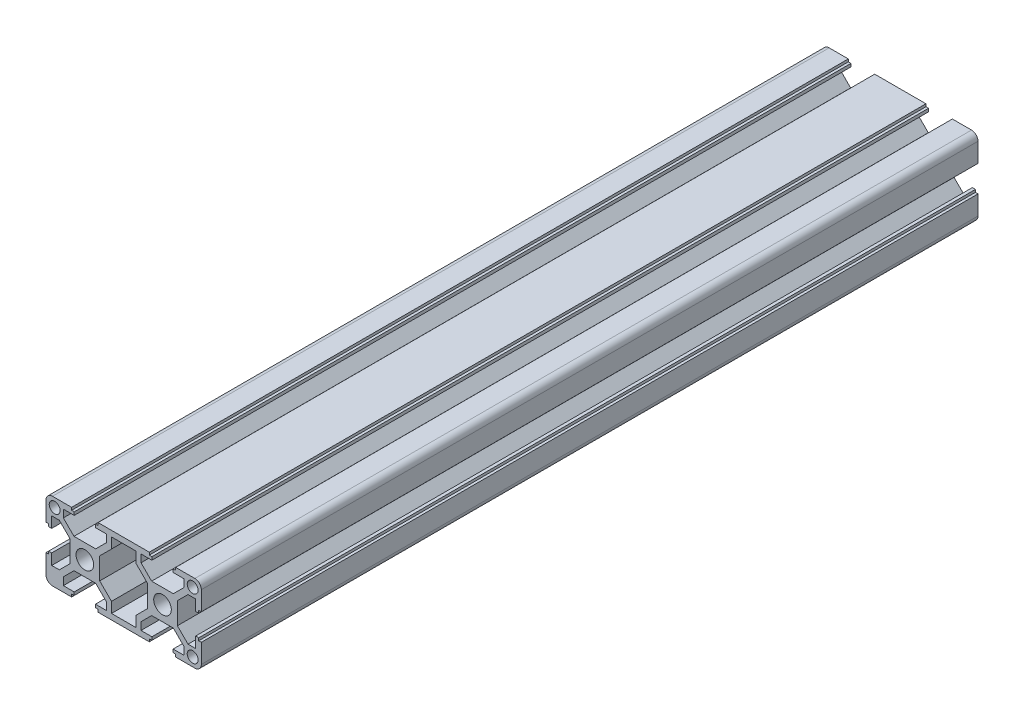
ISO-10303-21;
HEADER;
FILE_DESCRIPTION(('STEP AP214'),'2;1');
FILE_NAME('part.step','',(''),(''),'','','');
FILE_SCHEMA(('AUTOMOTIVE_DESIGN { 1 0 10303 214 1 1 1 1 }'));
ENDSEC;
DATA;
#1=APPLICATION_CONTEXT('core data for automotive mechanical design processes');
#2=APPLICATION_PROTOCOL_DEFINITION('international standard','automotive_design',2000,#1);
#3=PRODUCT_CONTEXT('',#1,'mechanical');
#4=PRODUCT('Part','Part','',(#3));
#5=PRODUCT_RELATED_PRODUCT_CATEGORY('part','',(#4));
#6=PRODUCT_DEFINITION_FORMATION('','',#4);
#7=PRODUCT_DEFINITION_CONTEXT('part definition',#1,'design');
#8=PRODUCT_DEFINITION('design','',#6,#7);
#9=PRODUCT_DEFINITION_SHAPE('','',#8);
#10=(LENGTH_UNIT() NAMED_UNIT(*) SI_UNIT(.MILLI.,.METRE.));
#11=(NAMED_UNIT(*) PLANE_ANGLE_UNIT() SI_UNIT($,.RADIAN.));
#12=(NAMED_UNIT(*) SI_UNIT($,.STERADIAN.) SOLID_ANGLE_UNIT());
#13=UNCERTAINTY_MEASURE_WITH_UNIT(LENGTH_MEASURE(1.E-05),#10,'distance_accuracy_value','');
#14=(GEOMETRIC_REPRESENTATION_CONTEXT(3) GLOBAL_UNCERTAINTY_ASSIGNED_CONTEXT((#13)) GLOBAL_UNIT_ASSIGNED_CONTEXT((#10,
#11,#12)) REPRESENTATION_CONTEXT('',''));
#15=CARTESIAN_POINT('',(0.,0.,0.));
#16=DIRECTION('',(0.,0.,1.));
#17=DIRECTION('',(1.,0.,0.));
#18=AXIS2_PLACEMENT_3D('',#15,#16,#17);
#19=CARTESIAN_POINT('',(27.4999999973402,-12.4999999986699,150.));
#20=DIRECTION('',(0.,0.,1.));
#21=DIRECTION('',(1.,0.,0.));
#22=AXIS2_PLACEMENT_3D('',#19,#20,#21);
#23=PLANE('',#22);
#24=CARTESIAN_POINT('',(-26.6499999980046,11.649999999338,150.));
#25=DIRECTION('',(0.,0.,1.));
#26=DIRECTION('',(1.,0.,0.));
#27=AXIS2_PLACEMENT_3D('',#24,#25,#26);
#28=CIRCLE('',#27,2.1);
#29=CARTESIAN_POINT('',(-24.5499999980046,11.649999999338,150.));
#30=VERTEX_POINT('',#29);
#31=EDGE_CURVE('E2572',#30,#30,#28,.T.);
#32=ORIENTED_EDGE('',*,*,#31,.F.);
#33=EDGE_LOOP('',(#32));
#34=FACE_BOUND('',#33,.T.);
#35=DIRECTION('',(0.,1.,0.));
#36=VECTOR('',#35,1.);
#37=CARTESIAN_POINT('',(4.69999999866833,-12.7999999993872,150.));
#38=LINE('',#37,#36);
#39=CARTESIAN_POINT('',(4.69999999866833,-12.7999999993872,150.));
#40=VERTEX_POINT('',#39);
#41=CARTESIAN_POINT('',(4.69999999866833,-8.74436507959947,150.));
#42=VERTEX_POINT('',#41);
#43=EDGE_CURVE('E684',#40,#42,#38,.T.);
#44=ORIENTED_EDGE('',*,*,#43,.F.);
#45=DIRECTION('',(1.,0.,0.));
#46=VECTOR('',#45,1.);
#47=CARTESIAN_POINT('',(-4.69999999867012,-12.7999999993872,150.));
#48=LINE('',#47,#46);
#49=CARTESIAN_POINT('',(-4.69999999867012,-12.7999999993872,150.));
#50=VERTEX_POINT('',#49);
#51=EDGE_CURVE('E676',#50,#40,#48,.T.);
#52=ORIENTED_EDGE('',*,*,#51,.F.);
#53=DIRECTION('',(0.,-1.,0.));
#54=VECTOR('',#53,1.);
#55=CARTESIAN_POINT('',(-4.69999999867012,-8.74436507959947,150.));
#56=LINE('',#55,#54);
#57=CARTESIAN_POINT('',(-4.69999999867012,-8.74436507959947,150.));
#58=VERTEX_POINT('',#57);
#59=EDGE_CURVE('E719',#58,#50,#56,.T.);
#60=ORIENTED_EDGE('',*,*,#59,.F.);
#61=DIRECTION('',(0.707106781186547,-0.707106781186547,0.));
#62=VECTOR('',#61,1.);
#63=CARTESIAN_POINT('',(-9.24999999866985,-4.19436507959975,150.));
#64=LINE('',#63,#62);
#65=CARTESIAN_POINT('',(-9.24999999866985,-4.19436507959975,150.));
#66=VERTEX_POINT('',#65);
#67=EDGE_CURVE('E717',#66,#58,#64,.T.);
#68=ORIENTED_EDGE('',*,*,#67,.F.);
#69=DIRECTION('',(0.,-1.,0.));
#70=VECTOR('',#69,1.);
#71=CARTESIAN_POINT('',(-9.24999999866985,4.19436507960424,150.));
#72=LINE('',#71,#70);
#73=CARTESIAN_POINT('',(-9.24999999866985,4.19436507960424,150.));
#74=VERTEX_POINT('',#73);
#75=EDGE_CURVE('E715',#74,#66,#72,.T.);
#76=ORIENTED_EDGE('',*,*,#75,.F.);
#77=DIRECTION('',(-0.707106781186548,-0.707106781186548,0.));
#78=VECTOR('',#77,1.);
#79=CARTESIAN_POINT('',(-4.69999999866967,8.74436507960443,150.));
#80=LINE('',#79,#78);
#81=CARTESIAN_POINT('',(-4.69999999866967,8.74436507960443,150.));
#82=VERTEX_POINT('',#81);
#83=EDGE_CURVE('E713',#82,#74,#80,.T.);
#84=ORIENTED_EDGE('',*,*,#83,.F.);
#85=DIRECTION('',(0.,-1.,0.));
#86=VECTOR('',#85,1.);
#87=CARTESIAN_POINT('',(-4.69999999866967,12.7999999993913,150.));
#88=LINE('',#87,#86);
#89=CARTESIAN_POINT('',(-4.69999999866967,12.7999999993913,150.));
#90=VERTEX_POINT('',#89);
#91=EDGE_CURVE('E711',#90,#82,#88,.T.);
#92=ORIENTED_EDGE('',*,*,#91,.F.);
#93=DIRECTION('',(-1.,0.,0.));
#94=VECTOR('',#93,1.);
#95=CARTESIAN_POINT('',(4.69999999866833,12.7999999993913,150.));
#96=LINE('',#95,#94);
#97=CARTESIAN_POINT('',(4.69999999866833,12.7999999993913,150.));
#98=VERTEX_POINT('',#97);
#99=EDGE_CURVE('E709',#98,#90,#96,.T.);
#100=ORIENTED_EDGE('',*,*,#99,.F.);
#101=DIRECTION('',(0.,1.,0.));
#102=VECTOR('',#101,1.);
#103=CARTESIAN_POINT('',(4.69999999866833,8.74436507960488,150.));
#104=LINE('',#103,#102);
#105=CARTESIAN_POINT('',(4.69999999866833,8.74436507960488,150.));
#106=VERTEX_POINT('',#105);
#107=EDGE_CURVE('E707',#106,#98,#104,.T.);
#108=ORIENTED_EDGE('',*,*,#107,.F.);
#109=DIRECTION('',(-0.707106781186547,0.707106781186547,0.));
#110=VECTOR('',#109,1.);
#111=CARTESIAN_POINT('',(9.24999999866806,4.19436507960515,150.));
#112=LINE('',#111,#110);
#113=CARTESIAN_POINT('',(9.24999999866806,4.19436507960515,150.));
#114=VERTEX_POINT('',#113);
#115=EDGE_CURVE('E705',#114,#106,#112,.T.);
#116=ORIENTED_EDGE('',*,*,#115,.F.);
#117=DIRECTION('',(0.,1.,0.));
#118=VECTOR('',#117,1.);
#119=CARTESIAN_POINT('',(9.24999999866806,-4.19436507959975,150.));
#120=LINE('',#119,#118);
#121=CARTESIAN_POINT('',(9.24999999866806,-4.19436507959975,150.));
#122=VERTEX_POINT('',#121);
#123=EDGE_CURVE('E700',#122,#114,#120,.T.);
#124=ORIENTED_EDGE('',*,*,#123,.F.);
#125=DIRECTION('',(0.707106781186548,0.707106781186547,0.));
#126=VECTOR('',#125,1.);
#127=CARTESIAN_POINT('',(4.69999999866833,-8.74436507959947,150.));
#128=LINE('',#127,#126);
#129=EDGE_CURVE('E698',#42,#122,#128,.T.);
#130=ORIENTED_EDGE('',*,*,#129,.F.);
#131=EDGE_LOOP('',(#44,#52,#60,#68,#76,#84,#92,#100,#108,#116,#124,#130));
#132=FACE_BOUND('',#131,.T.);
#133=CARTESIAN_POINT('',(-14.999999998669,1.36696209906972E-12,150.));
#134=DIRECTION('',(0.,0.,1.));
#135=DIRECTION('',(1.,0.,0.));
#136=AXIS2_PLACEMENT_3D('',#133,#134,#135);
#137=CIRCLE('',#136,3.39999999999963);
#138=CARTESIAN_POINT('',(-11.5999999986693,1.36696209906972E-12,150.));
#139=VERTEX_POINT('',#138);
#140=EDGE_CURVE('E780',#139,#139,#137,.T.);
#141=ORIENTED_EDGE('',*,*,#140,.F.);
#142=EDGE_LOOP('',(#141));
#143=FACE_BOUND('',#142,.T.);
#144=DIRECTION('',(0.,1.,0.));
#145=VECTOR('',#144,1.);
#146=CARTESIAN_POINT('',(10.8999999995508,-13.9999999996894,150.));
#147=LINE('',#146,#145);
#148=CARTESIAN_POINT('',(10.8999999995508,-13.9999999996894,150.));
#149=VERTEX_POINT('',#148);
#150=CARTESIAN_POINT('',(10.8999999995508,-12.7999999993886,150.));
#151=VERTEX_POINT('',#150);
#152=EDGE_CURVE('E786',#149,#151,#147,.T.);
#153=ORIENTED_EDGE('',*,*,#152,.T.);
#154=DIRECTION('',(-1.,0.,0.));
#155=VECTOR('',#154,1.);
#156=CARTESIAN_POINT('',(10.8999999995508,-12.7999999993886,150.));
#157=LINE('',#156,#155);
#158=CARTESIAN_POINT('',(6.6999999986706,-12.7999999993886,150.));
#159=VERTEX_POINT('',#158);
#160=EDGE_CURVE('E789',#151,#159,#157,.T.);
#161=ORIENTED_EDGE('',*,*,#160,.T.);
#162=DIRECTION('',(0.,1.,0.));
#163=VECTOR('',#162,1.);
#164=CARTESIAN_POINT('',(6.6999999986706,-12.7999999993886,150.));
#165=LINE('',#164,#163);
#166=CARTESIAN_POINT('',(6.6999999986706,-9.85563492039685,150.));
#167=VERTEX_POINT('',#166);
#168=EDGE_CURVE('E792',#159,#167,#165,.T.);
#169=ORIENTED_EDGE('',*,*,#168,.T.);
#170=DIRECTION('',(0.707106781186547,0.707106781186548,0.));
#171=VECTOR('',#170,1.);
#172=CARTESIAN_POINT('',(6.6999999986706,-9.85563492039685,150.));
#173=LINE('',#172,#171);
#174=CARTESIAN_POINT('',(10.8056349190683,-5.74999999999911,150.));
#175=VERTEX_POINT('',#174);
#176=EDGE_CURVE('E794',#167,#175,#173,.T.);
#177=ORIENTED_EDGE('',*,*,#176,.T.);
#178=DIRECTION('',(1.,0.,0.));
#179=VECTOR('',#178,1.);
#180=CARTESIAN_POINT('',(10.8056349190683,-5.74999999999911,150.));
#181=LINE('',#180,#179);
#182=CARTESIAN_POINT('',(19.1943650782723,-5.74999999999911,150.));
#183=VERTEX_POINT('',#182);
#184=EDGE_CURVE('E796',#175,#183,#181,.T.);
#185=ORIENTED_EDGE('',*,*,#184,.T.);
#186=DIRECTION('',(0.707106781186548,-0.707106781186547,0.));
#187=VECTOR('',#186,1.);
#188=CARTESIAN_POINT('',(19.1943650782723,-5.74999999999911,150.));
#189=LINE('',#188,#187);
#190=CARTESIAN_POINT('',(23.2999999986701,-9.85563492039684,150.));
#191=VERTEX_POINT('',#190);
#192=EDGE_CURVE('E798',#183,#191,#189,.T.);
#193=ORIENTED_EDGE('',*,*,#192,.T.);
#194=DIRECTION('',(0.,-1.,0.));
#195=VECTOR('',#194,1.);
#196=CARTESIAN_POINT('',(23.2999999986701,-9.85563492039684,150.));
#197=LINE('',#196,#195);
#198=CARTESIAN_POINT('',(23.2999999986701,-12.7999999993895,150.));
#199=VERTEX_POINT('',#198);
#200=EDGE_CURVE('E800',#191,#199,#197,.T.);
#201=ORIENTED_EDGE('',*,*,#200,.T.);
#202=DIRECTION('',(-1.,0.,0.));
#203=VECTOR('',#202,1.);
#204=CARTESIAN_POINT('',(23.2999999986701,-12.7999999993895,150.));
#205=LINE('',#204,#203);
#206=CARTESIAN_POINT('',(19.0999999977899,-12.7999999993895,150.));
#207=VERTEX_POINT('',#206);
#208=EDGE_CURVE('E802',#199,#207,#205,.T.);
#209=ORIENTED_EDGE('',*,*,#208,.T.);
#210=DIRECTION('',(0.,-1.,0.));
#211=VECTOR('',#210,1.);
#212=CARTESIAN_POINT('',(19.0999999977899,-12.7999999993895,150.));
#213=LINE('',#212,#211);
#214=CARTESIAN_POINT('',(19.0999999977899,-13.9999999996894,150.));
#215=VERTEX_POINT('',#214);
#216=EDGE_CURVE('E804',#207,#215,#213,.T.);
#217=ORIENTED_EDGE('',*,*,#216,.T.);
#218=DIRECTION('',(1.,0.,0.));
#219=VECTOR('',#218,1.);
#220=CARTESIAN_POINT('',(19.0999999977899,-13.9999999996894,150.));
#221=LINE('',#220,#219);
#222=CARTESIAN_POINT('',(20.0999999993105,-13.9999999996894,150.));
#223=VERTEX_POINT('',#222);
#224=EDGE_CURVE('E806',#215,#223,#221,.T.);
#225=ORIENTED_EDGE('',*,*,#224,.T.);
#226=DIRECTION('',(0.,-1.,0.));
#227=VECTOR('',#226,1.);
#228=CARTESIAN_POINT('',(20.0999999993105,-13.9999999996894,150.));
#229=LINE('',#228,#227);
#230=CARTESIAN_POINT('',(20.0999999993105,-14.9999999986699,150.));
#231=VERTEX_POINT('',#230);
#232=EDGE_CURVE('E808',#223,#231,#229,.T.);
#233=ORIENTED_EDGE('',*,*,#232,.T.);
#234=DIRECTION('',(1.,0.,0.));
#235=VECTOR('',#234,1.);
#236=CARTESIAN_POINT('',(20.0999999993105,-14.9999999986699,150.));
#237=LINE('',#236,#235);
#238=CARTESIAN_POINT('',(27.4999999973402,-14.9999999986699,150.));
#239=VERTEX_POINT('',#238);
#240=EDGE_CURVE('E810',#231,#239,#237,.T.);
#241=ORIENTED_EDGE('',*,*,#240,.T.);
#242=CARTESIAN_POINT('',(27.4999999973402,-12.4999999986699,150.));
#243=DIRECTION('',(0.,0.,1.));
#244=DIRECTION('',(1.,0.,0.));
#245=AXIS2_PLACEMENT_3D('',#242,#243,#244);
#246=CIRCLE('',#245,2.5);
#247=CARTESIAN_POINT('',(29.9999999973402,-12.4999999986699,150.));
#248=VERTEX_POINT('',#247);
#249=EDGE_CURVE('E812',#239,#248,#246,.T.);
#250=ORIENTED_EDGE('',*,*,#249,.T.);
#251=DIRECTION('',(0.,1.,0.));
#252=VECTOR('',#251,1.);
#253=CARTESIAN_POINT('',(29.9999999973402,-12.4999999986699,150.));
#254=LINE('',#253,#252);
#255=CARTESIAN_POINT('',(29.9999999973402,-5.10000000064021,150.));
#256=VERTEX_POINT('',#255);
#257=EDGE_CURVE('E814',#248,#256,#254,.T.);
#258=ORIENTED_EDGE('',*,*,#257,.T.);
#259=DIRECTION('',(-1.,0.,0.));
#260=VECTOR('',#259,1.);
#261=CARTESIAN_POINT('',(29.9999999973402,-5.10000000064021,150.));
#262=LINE('',#261,#260);
#263=CARTESIAN_POINT('',(28.9999999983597,-5.10000000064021,150.));
#264=VERTEX_POINT('',#263);
#265=EDGE_CURVE('E816',#256,#264,#262,.T.);
#266=ORIENTED_EDGE('',*,*,#265,.T.);
#267=DIRECTION('',(0.,1.,0.));
#268=VECTOR('',#267,1.);
#269=CARTESIAN_POINT('',(28.9999999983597,-5.10000000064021,150.));
#270=LINE('',#269,#268);
#271=CARTESIAN_POINT('',(28.9999999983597,-4.09999999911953,150.));
#272=VERTEX_POINT('',#271);
#273=EDGE_CURVE('E818',#264,#272,#270,.T.);
#274=ORIENTED_EDGE('',*,*,#273,.T.);
#275=DIRECTION('',(-1.,0.,0.));
#276=VECTOR('',#275,1.);
#277=CARTESIAN_POINT('',(28.9999999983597,-4.09999999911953,150.));
#278=LINE('',#277,#276);
#279=CARTESIAN_POINT('',(27.7999999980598,-4.09999999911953,150.));
#280=VERTEX_POINT('',#279);
#281=EDGE_CURVE('E820',#272,#280,#278,.T.);
#282=ORIENTED_EDGE('',*,*,#281,.T.);
#283=DIRECTION('',(0.,-1.,0.));
#284=VECTOR('',#283,1.);
#285=CARTESIAN_POINT('',(27.7999999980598,-4.09999999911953,150.));
#286=LINE('',#285,#284);
#287=CARTESIAN_POINT('',(27.7999999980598,-8.29999999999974,150.));
#288=VERTEX_POINT('',#287);
#289=EDGE_CURVE('E822',#280,#288,#286,.T.);
#290=ORIENTED_EDGE('',*,*,#289,.T.);
#291=DIRECTION('',(-1.,0.,0.));
#292=VECTOR('',#291,1.);
#293=CARTESIAN_POINT('',(27.7999999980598,-8.29999999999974,150.));
#294=LINE('',#293,#292);
#295=CARTESIAN_POINT('',(24.8556349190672,-8.29999999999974,150.));
#296=VERTEX_POINT('',#295);
#297=EDGE_CURVE('E824',#288,#296,#294,.T.);
#298=ORIENTED_EDGE('',*,*,#297,.T.);
#299=DIRECTION('',(-0.707106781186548,0.707106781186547,0.));
#300=VECTOR('',#299,1.);
#301=CARTESIAN_POINT('',(24.8556349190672,-8.29999999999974,150.));
#302=LINE('',#301,#300);
#303=CARTESIAN_POINT('',(20.7499999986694,-4.19436507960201,150.));
#304=VERTEX_POINT('',#303);
#305=EDGE_CURVE('E826',#296,#304,#302,.T.);
#306=ORIENTED_EDGE('',*,*,#305,.T.);
#307=DIRECTION('',(0.,1.,0.));
#308=VECTOR('',#307,1.);
#309=CARTESIAN_POINT('',(20.7499999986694,-4.19436507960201,150.));
#310=LINE('',#309,#308);
#311=CARTESIAN_POINT('',(20.7499999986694,4.19436507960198,150.));
#312=VERTEX_POINT('',#311);
#313=EDGE_CURVE('E828',#304,#312,#310,.T.);
#314=ORIENTED_EDGE('',*,*,#313,.T.);
#315=DIRECTION('',(0.707106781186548,0.707106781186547,0.));
#316=VECTOR('',#315,1.);
#317=CARTESIAN_POINT('',(20.7499999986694,4.19436507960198,150.));
#318=LINE('',#317,#316);
#319=CARTESIAN_POINT('',(24.8556349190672,8.29999999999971,150.));
#320=VERTEX_POINT('',#319);
#321=EDGE_CURVE('E830',#312,#320,#318,.T.);
#322=ORIENTED_EDGE('',*,*,#321,.T.);
#323=DIRECTION('',(1.,0.,0.));
#324=VECTOR('',#323,1.);
#325=CARTESIAN_POINT('',(24.8556349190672,8.29999999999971,150.));
#326=LINE('',#325,#324);
#327=CARTESIAN_POINT('',(27.7999999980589,8.29999999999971,150.));
#328=VERTEX_POINT('',#327);
#329=EDGE_CURVE('E832',#320,#328,#326,.T.);
#330=ORIENTED_EDGE('',*,*,#329,.T.);
#331=DIRECTION('',(0.,-1.,0.));
#332=VECTOR('',#331,1.);
#333=CARTESIAN_POINT('',(27.7999999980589,8.29999999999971,150.));
#334=LINE('',#333,#332);
#335=CARTESIAN_POINT('',(27.7999999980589,4.09999999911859,150.));
#336=VERTEX_POINT('',#335);
#337=EDGE_CURVE('E834',#328,#336,#334,.T.);
#338=ORIENTED_EDGE('',*,*,#337,.T.);
#339=DIRECTION('',(1.,0.,0.));
#340=VECTOR('',#339,1.);
#341=CARTESIAN_POINT('',(27.7999999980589,4.09999999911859,150.));
#342=LINE('',#341,#340);
#343=CARTESIAN_POINT('',(28.9999999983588,4.09999999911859,150.));
#344=VERTEX_POINT('',#343);
#345=EDGE_CURVE('E836',#336,#344,#342,.T.);
#346=ORIENTED_EDGE('',*,*,#345,.T.);
#347=DIRECTION('',(0.,1.,0.));
#348=VECTOR('',#347,1.);
#349=CARTESIAN_POINT('',(28.9999999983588,4.09999999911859,150.));
#350=LINE('',#349,#348);
#351=CARTESIAN_POINT('',(28.9999999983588,5.10000000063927,150.));
#352=VERTEX_POINT('',#351);
#353=EDGE_CURVE('E838',#344,#352,#350,.T.);
#354=ORIENTED_EDGE('',*,*,#353,.T.);
#355=DIRECTION('',(1.,0.,0.));
#356=VECTOR('',#355,1.);
#357=CARTESIAN_POINT('',(28.9999999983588,5.10000000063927,150.));
#358=LINE('',#357,#356);
#359=CARTESIAN_POINT('',(29.9999999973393,5.10000000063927,150.));
#360=VERTEX_POINT('',#359);
#361=EDGE_CURVE('E840',#352,#360,#358,.T.);
#362=ORIENTED_EDGE('',*,*,#361,.T.);
#363=DIRECTION('',(0.,1.,0.));
#364=VECTOR('',#363,1.);
#365=CARTESIAN_POINT('',(29.9999999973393,5.10000000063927,150.));
#366=LINE('',#365,#364);
#367=CARTESIAN_POINT('',(29.9999999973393,12.4999999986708,150.));
#368=VERTEX_POINT('',#367);
#369=EDGE_CURVE('E842',#360,#368,#366,.T.);
#370=ORIENTED_EDGE('',*,*,#369,.T.);
#371=CARTESIAN_POINT('',(27.4999999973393,12.4999999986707,150.));
#372=DIRECTION('',(0.,0.,1.));
#373=DIRECTION('',(1.,0.,0.));
#374=AXIS2_PLACEMENT_3D('',#371,#372,#373);
#375=CIRCLE('',#374,2.50000000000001);
#376=CARTESIAN_POINT('',(27.4999999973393,14.9999999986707,150.));
#377=VERTEX_POINT('',#376);
#378=EDGE_CURVE('E844',#368,#377,#375,.T.);
#379=ORIENTED_EDGE('',*,*,#378,.T.);
#380=DIRECTION('',(-1.,0.,0.));
#381=VECTOR('',#380,1.);
#382=CARTESIAN_POINT('',(27.4999999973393,14.9999999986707,150.));
#383=LINE('',#382,#381);
#384=CARTESIAN_POINT('',(20.0999999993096,14.9999999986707,150.));
#385=VERTEX_POINT('',#384);
#386=EDGE_CURVE('E846',#377,#385,#383,.T.);
#387=ORIENTED_EDGE('',*,*,#386,.T.);
#388=DIRECTION('',(0.,-1.,0.));
#389=VECTOR('',#388,1.);
#390=CARTESIAN_POINT('',(20.0999999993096,14.9999999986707,150.));
#391=LINE('',#390,#389);
#392=CARTESIAN_POINT('',(20.0999999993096,13.9999999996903,150.));
#393=VERTEX_POINT('',#392);
#394=EDGE_CURVE('E848',#385,#393,#391,.T.);
#395=ORIENTED_EDGE('',*,*,#394,.T.);
#396=DIRECTION('',(-1.,0.,0.));
#397=VECTOR('',#396,1.);
#398=CARTESIAN_POINT('',(20.0999999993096,13.9999999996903,150.));
#399=LINE('',#398,#397);
#400=CARTESIAN_POINT('',(19.0999999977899,13.9999999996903,150.));
#401=VERTEX_POINT('',#400);
#402=EDGE_CURVE('E850',#393,#401,#399,.T.);
#403=ORIENTED_EDGE('',*,*,#402,.T.);
#404=DIRECTION('',(0.,-1.,0.));
#405=VECTOR('',#404,1.);
#406=CARTESIAN_POINT('',(19.0999999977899,13.9999999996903,150.));
#407=LINE('',#406,#405);
#408=CARTESIAN_POINT('',(19.0999999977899,12.7999999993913,150.));
#409=VERTEX_POINT('',#408);
#410=EDGE_CURVE('E852',#401,#409,#407,.T.);
#411=ORIENTED_EDGE('',*,*,#410,.T.);
#412=DIRECTION('',(1.,0.,0.));
#413=VECTOR('',#412,1.);
#414=CARTESIAN_POINT('',(19.0999999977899,12.7999999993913,150.));
#415=LINE('',#414,#413);
#416=CARTESIAN_POINT('',(23.2999999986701,12.7999999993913,150.));
#417=VERTEX_POINT('',#416);
#418=EDGE_CURVE('E854',#409,#417,#415,.T.);
#419=ORIENTED_EDGE('',*,*,#418,.T.);
#420=DIRECTION('',(0.,-1.,0.));
#421=VECTOR('',#420,1.);
#422=CARTESIAN_POINT('',(23.2999999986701,12.7999999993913,150.));
#423=LINE('',#422,#421);
#424=CARTESIAN_POINT('',(23.2999999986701,9.85563492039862,150.));
#425=VERTEX_POINT('',#424);
#426=EDGE_CURVE('E856',#417,#425,#423,.T.);
#427=ORIENTED_EDGE('',*,*,#426,.T.);
#428=DIRECTION('',(-0.707106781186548,-0.707106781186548,0.));
#429=VECTOR('',#428,1.);
#430=CARTESIAN_POINT('',(23.2999999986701,9.85563492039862,150.));
#431=LINE('',#430,#429);
#432=CARTESIAN_POINT('',(19.1943650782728,5.75000000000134,150.));
#433=VERTEX_POINT('',#432);
#434=EDGE_CURVE('E858',#425,#433,#431,.T.);
#435=ORIENTED_EDGE('',*,*,#434,.T.);
#436=DIRECTION('',(-1.,0.,0.));
#437=VECTOR('',#436,1.);
#438=CARTESIAN_POINT('',(19.1943650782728,5.75000000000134,150.));
#439=LINE('',#438,#437);
#440=CARTESIAN_POINT('',(10.8056349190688,5.75000000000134,150.));
#441=VERTEX_POINT('',#440);
#442=EDGE_CURVE('E860',#433,#441,#439,.T.);
#443=ORIENTED_EDGE('',*,*,#442,.T.);
#444=DIRECTION('',(-0.707106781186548,0.707106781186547,0.));
#445=VECTOR('',#444,1.);
#446=CARTESIAN_POINT('',(10.8056349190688,5.75000000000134,150.));
#447=LINE('',#446,#445);
#448=CARTESIAN_POINT('',(6.6999999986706,9.85563492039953,150.));
#449=VERTEX_POINT('',#448);
#450=EDGE_CURVE('E862',#441,#449,#447,.T.);
#451=ORIENTED_EDGE('',*,*,#450,.T.);
#452=DIRECTION('',(0.,1.,0.));
#453=VECTOR('',#452,1.);
#454=CARTESIAN_POINT('',(6.6999999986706,9.85563492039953,150.));
#455=LINE('',#454,#453);
#456=CARTESIAN_POINT('',(6.6999999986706,12.7999999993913,150.));
#457=VERTEX_POINT('',#456);
#458=EDGE_CURVE('E864',#449,#457,#455,.T.);
#459=ORIENTED_EDGE('',*,*,#458,.T.);
#460=DIRECTION('',(1.,0.,0.));
#461=VECTOR('',#460,1.);
#462=CARTESIAN_POINT('',(6.6999999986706,12.7999999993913,150.));
#463=LINE('',#462,#461);
#464=CARTESIAN_POINT('',(10.8999999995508,12.7999999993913,150.));
#465=VERTEX_POINT('',#464);
#466=EDGE_CURVE('E866',#457,#465,#463,.T.);
#467=ORIENTED_EDGE('',*,*,#466,.T.);
#468=DIRECTION('',(0.,1.,0.));
#469=VECTOR('',#468,1.);
#470=CARTESIAN_POINT('',(10.8999999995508,12.7999999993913,150.));
#471=LINE('',#470,#469);
#472=CARTESIAN_POINT('',(10.8999999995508,13.9999999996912,150.));
#473=VERTEX_POINT('',#472);
#474=EDGE_CURVE('E868',#465,#473,#471,.T.);
#475=ORIENTED_EDGE('',*,*,#474,.T.);
#476=DIRECTION('',(-1.,0.,0.));
#477=VECTOR('',#476,1.);
#478=CARTESIAN_POINT('',(10.8999999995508,13.9999999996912,150.));
#479=LINE('',#478,#477);
#480=CARTESIAN_POINT('',(9.89999999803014,13.9999999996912,150.));
#481=VERTEX_POINT('',#480);
#482=EDGE_CURVE('E870',#473,#481,#479,.T.);
#483=ORIENTED_EDGE('',*,*,#482,.T.);
#484=DIRECTION('',(0.,1.,0.));
#485=VECTOR('',#484,1.);
#486=CARTESIAN_POINT('',(9.89999999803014,13.9999999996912,150.));
#487=LINE('',#486,#485);
#488=CARTESIAN_POINT('',(9.89999999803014,14.9999999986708,150.));
#489=VERTEX_POINT('',#488);
#490=EDGE_CURVE('E872',#481,#489,#487,.T.);
#491=ORIENTED_EDGE('',*,*,#490,.T.);
#492=DIRECTION('',(-1.,0.,0.));
#493=VECTOR('',#492,1.);
#494=CARTESIAN_POINT('',(9.89999999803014,14.9999999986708,150.));
#495=LINE('',#494,#493);
#496=CARTESIAN_POINT('',(-9.8999999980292,14.9999999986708,150.));
#497=VERTEX_POINT('',#496);
#498=EDGE_CURVE('E874',#489,#497,#495,.T.);
#499=ORIENTED_EDGE('',*,*,#498,.T.);
#500=DIRECTION('',(0.,-1.,0.));
#501=VECTOR('',#500,1.);
#502=CARTESIAN_POINT('',(-9.8999999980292,14.9999999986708,150.));
#503=LINE('',#502,#501);
#504=CARTESIAN_POINT('',(-9.8999999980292,13.9999999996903,150.));
#505=VERTEX_POINT('',#504);
#506=EDGE_CURVE('E876',#497,#505,#503,.T.);
#507=ORIENTED_EDGE('',*,*,#506,.T.);
#508=DIRECTION('',(-1.,0.,0.));
#509=VECTOR('',#508,1.);
#510=CARTESIAN_POINT('',(-9.8999999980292,13.9999999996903,150.));
#511=LINE('',#510,#509);
#512=CARTESIAN_POINT('',(-10.899999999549,13.9999999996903,150.));
#513=VERTEX_POINT('',#512);
#514=EDGE_CURVE('E878',#505,#513,#511,.T.);
#515=ORIENTED_EDGE('',*,*,#514,.T.);
#516=DIRECTION('',(0.,-1.,0.));
#517=VECTOR('',#516,1.);
#518=CARTESIAN_POINT('',(-10.899999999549,13.9999999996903,150.));
#519=LINE('',#518,#517);
#520=CARTESIAN_POINT('',(-10.899999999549,12.7999999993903,150.));
#521=VERTEX_POINT('',#520);
#522=EDGE_CURVE('E880',#513,#521,#519,.T.);
#523=ORIENTED_EDGE('',*,*,#522,.T.);
#524=DIRECTION('',(1.,0.,0.));
#525=VECTOR('',#524,1.);
#526=CARTESIAN_POINT('',(-10.899999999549,12.7999999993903,150.));
#527=LINE('',#526,#525);
#528=CARTESIAN_POINT('',(-6.69999999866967,12.7999999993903,150.));
#529=VERTEX_POINT('',#528);
#530=EDGE_CURVE('E882',#521,#529,#527,.T.);
#531=ORIENTED_EDGE('',*,*,#530,.T.);
#532=DIRECTION('',(0.,-1.,0.));
#533=VECTOR('',#532,1.);
#534=CARTESIAN_POINT('',(-6.69999999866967,12.7999999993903,150.));
#535=LINE('',#534,#533);
#536=CARTESIAN_POINT('',(-6.69999999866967,9.85563492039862,150.));
#537=VERTEX_POINT('',#536);
#538=EDGE_CURVE('E884',#529,#537,#535,.T.);
#539=ORIENTED_EDGE('',*,*,#538,.T.);
#540=DIRECTION('',(-0.707106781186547,-0.707106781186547,0.));
#541=VECTOR('',#540,1.);
#542=CARTESIAN_POINT('',(-6.69999999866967,9.85563492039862,150.));
#543=LINE('',#542,#541);
#544=CARTESIAN_POINT('',(-10.8056349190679,5.75000000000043,150.));
#545=VERTEX_POINT('',#544);
#546=EDGE_CURVE('E886',#537,#545,#543,.T.);
#547=ORIENTED_EDGE('',*,*,#546,.T.);
#548=DIRECTION('',(-1.,0.,0.));
#549=VECTOR('',#548,1.);
#550=CARTESIAN_POINT('',(-10.8056349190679,5.75000000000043,150.));
#551=LINE('',#550,#549);
#552=CARTESIAN_POINT('',(-19.1943650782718,5.75000000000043,150.));
#553=VERTEX_POINT('',#552);
#554=EDGE_CURVE('E888',#545,#553,#551,.T.);
#555=ORIENTED_EDGE('',*,*,#554,.T.);
#556=DIRECTION('',(-0.707106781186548,0.707106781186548,0.));
#557=VECTOR('',#556,1.);
#558=CARTESIAN_POINT('',(-19.1943650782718,5.75000000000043,150.));
#559=LINE('',#558,#557);
#560=CARTESIAN_POINT('',(-23.2999999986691,9.85563492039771,150.));
#561=VERTEX_POINT('',#560);
#562=EDGE_CURVE('E890',#553,#561,#559,.T.);
#563=ORIENTED_EDGE('',*,*,#562,.T.);
#564=DIRECTION('',(0.,1.,0.));
#565=VECTOR('',#564,1.);
#566=CARTESIAN_POINT('',(-23.2999999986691,9.85563492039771,150.));
#567=LINE('',#566,#565);
#568=CARTESIAN_POINT('',(-23.2999999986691,12.7999999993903,150.));
#569=VERTEX_POINT('',#568);
#570=EDGE_CURVE('E892',#561,#569,#567,.T.);
#571=ORIENTED_EDGE('',*,*,#570,.T.);
#572=DIRECTION('',(1.,0.,0.));
#573=VECTOR('',#572,1.);
#574=CARTESIAN_POINT('',(-23.2999999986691,12.7999999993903,150.));
#575=LINE('',#574,#573);
#576=CARTESIAN_POINT('',(-19.0999999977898,12.7999999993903,150.));
#577=VERTEX_POINT('',#576);
#578=EDGE_CURVE('E894',#569,#577,#575,.T.);
#579=ORIENTED_EDGE('',*,*,#578,.T.);
#580=DIRECTION('',(0.,1.,0.));
#581=VECTOR('',#580,1.);
#582=CARTESIAN_POINT('',(-19.0999999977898,12.7999999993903,150.));
#583=LINE('',#582,#581);
#584=CARTESIAN_POINT('',(-19.0999999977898,13.9999999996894,150.));
#585=VERTEX_POINT('',#584);
#586=EDGE_CURVE('E896',#577,#585,#583,.T.);
#587=ORIENTED_EDGE('',*,*,#586,.T.);
#588=DIRECTION('',(-1.,0.,0.));
#589=VECTOR('',#588,1.);
#590=CARTESIAN_POINT('',(-19.0999999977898,13.9999999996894,150.));
#591=LINE('',#590,#589);
#592=CARTESIAN_POINT('',(-20.0999999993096,13.9999999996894,150.));
#593=VERTEX_POINT('',#592);
#594=EDGE_CURVE('E898',#585,#593,#591,.T.);
#595=ORIENTED_EDGE('',*,*,#594,.T.);
#596=DIRECTION('',(0.,1.,0.));
#597=VECTOR('',#596,1.);
#598=CARTESIAN_POINT('',(-20.0999999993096,13.9999999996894,150.));
#599=LINE('',#598,#597);
#600=CARTESIAN_POINT('',(-20.0999999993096,14.9999999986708,150.));
#601=VERTEX_POINT('',#600);
#602=EDGE_CURVE('E900',#593,#601,#599,.T.);
#603=ORIENTED_EDGE('',*,*,#602,.T.);
#604=DIRECTION('',(-1.,0.,0.));
#605=VECTOR('',#604,1.);
#606=CARTESIAN_POINT('',(-20.0999999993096,14.9999999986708,150.));
#607=LINE('',#606,#605);
#608=CARTESIAN_POINT('',(-27.4999999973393,14.9999999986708,150.));
#609=VERTEX_POINT('',#608);
#610=EDGE_CURVE('E902',#601,#609,#607,.T.);
#611=ORIENTED_EDGE('',*,*,#610,.T.);
#612=CARTESIAN_POINT('',(-27.4999999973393,12.4999999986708,150.));
#613=DIRECTION('',(0.,0.,1.));
#614=DIRECTION('',(1.,0.,0.));
#615=AXIS2_PLACEMENT_3D('',#612,#613,#614);
#616=CIRCLE('',#615,2.5);
#617=CARTESIAN_POINT('',(-29.9999999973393,12.4999999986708,150.));
#618=VERTEX_POINT('',#617);
#619=EDGE_CURVE('E904',#609,#618,#616,.T.);
#620=ORIENTED_EDGE('',*,*,#619,.T.);
#621=DIRECTION('',(0.,-1.,0.));
#622=VECTOR('',#621,1.);
#623=CARTESIAN_POINT('',(-29.9999999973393,12.4999999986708,150.));
#624=LINE('',#623,#622);
#625=CARTESIAN_POINT('',(-29.9999999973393,5.10000000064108,150.));
#626=VERTEX_POINT('',#625);
#627=EDGE_CURVE('E906',#618,#626,#624,.T.);
#628=ORIENTED_EDGE('',*,*,#627,.T.);
#629=DIRECTION('',(1.,0.,0.));
#630=VECTOR('',#629,1.);
#631=CARTESIAN_POINT('',(-29.9999999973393,5.10000000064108,150.));
#632=LINE('',#631,#630);
#633=CARTESIAN_POINT('',(-28.9999999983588,5.10000000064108,150.));
#634=VERTEX_POINT('',#633);
#635=EDGE_CURVE('E908',#626,#634,#632,.T.);
#636=ORIENTED_EDGE('',*,*,#635,.T.);
#637=DIRECTION('',(0.,-1.,0.));
#638=VECTOR('',#637,1.);
#639=CARTESIAN_POINT('',(-28.9999999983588,5.10000000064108,150.));
#640=LINE('',#639,#638);
#641=CARTESIAN_POINT('',(-28.9999999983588,4.09999999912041,150.));
#642=VERTEX_POINT('',#641);
#643=EDGE_CURVE('E910',#634,#642,#640,.T.);
#644=ORIENTED_EDGE('',*,*,#643,.T.);
#645=DIRECTION('',(1.,0.,0.));
#646=VECTOR('',#645,1.);
#647=CARTESIAN_POINT('',(-28.9999999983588,4.09999999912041,150.));
#648=LINE('',#647,#646);
#649=CARTESIAN_POINT('',(-27.7999999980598,4.09999999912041,150.));
#650=VERTEX_POINT('',#649);
#651=EDGE_CURVE('E912',#642,#650,#648,.T.);
#652=ORIENTED_EDGE('',*,*,#651,.T.);
#653=DIRECTION('',(0.,1.,0.));
#654=VECTOR('',#653,1.);
#655=CARTESIAN_POINT('',(-27.7999999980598,4.09999999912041,150.));
#656=LINE('',#655,#654);
#657=CARTESIAN_POINT('',(-27.7999999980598,8.29999999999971,150.));
#658=VERTEX_POINT('',#657);
#659=EDGE_CURVE('E914',#650,#658,#656,.T.);
#660=ORIENTED_EDGE('',*,*,#659,.T.);
#661=DIRECTION('',(1.,0.,0.));
#662=VECTOR('',#661,1.);
#663=CARTESIAN_POINT('',(-27.7999999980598,8.29999999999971,150.));
#664=LINE('',#663,#662);
#665=CARTESIAN_POINT('',(-24.8556349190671,8.29999999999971,150.));
#666=VERTEX_POINT('',#665);
#667=EDGE_CURVE('E916',#658,#666,#664,.T.);
#668=ORIENTED_EDGE('',*,*,#667,.T.);
#669=DIRECTION('',(0.707106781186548,-0.707106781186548,0.));
#670=VECTOR('',#669,1.);
#671=CARTESIAN_POINT('',(-24.8556349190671,8.29999999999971,150.));
#672=LINE('',#671,#670);
#673=CARTESIAN_POINT('',(-20.7499999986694,4.19436507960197,150.));
#674=VERTEX_POINT('',#673);
#675=EDGE_CURVE('E918',#666,#674,#672,.T.);
#676=ORIENTED_EDGE('',*,*,#675,.T.);
#677=DIRECTION('',(0.,-1.,0.));
#678=VECTOR('',#677,1.);
#679=CARTESIAN_POINT('',(-20.7499999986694,4.19436507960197,150.));
#680=LINE('',#679,#678);
#681=CARTESIAN_POINT('',(-20.7499999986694,-4.19436507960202,150.));
#682=VERTEX_POINT('',#681);
#683=EDGE_CURVE('E920',#674,#682,#680,.T.);
#684=ORIENTED_EDGE('',*,*,#683,.T.);
#685=DIRECTION('',(-0.707106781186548,-0.707106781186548,0.));
#686=VECTOR('',#685,1.);
#687=CARTESIAN_POINT('',(-20.7499999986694,-4.19436507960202,150.));
#688=LINE('',#687,#686);
#689=CARTESIAN_POINT('',(-24.8556349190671,-8.29999999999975,150.));
#690=VERTEX_POINT('',#689);
#691=EDGE_CURVE('E922',#682,#690,#688,.T.);
#692=ORIENTED_EDGE('',*,*,#691,.T.);
#693=DIRECTION('',(-1.,0.,0.));
#694=VECTOR('',#693,1.);
#695=CARTESIAN_POINT('',(-24.8556349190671,-8.29999999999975,150.));
#696=LINE('',#695,#694);
#697=CARTESIAN_POINT('',(-27.7999999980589,-8.29999999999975,150.));
#698=VERTEX_POINT('',#697);
#699=EDGE_CURVE('E924',#690,#698,#696,.T.);
#700=ORIENTED_EDGE('',*,*,#699,.T.);
#701=DIRECTION('',(0.,1.,0.));
#702=VECTOR('',#701,1.);
#703=CARTESIAN_POINT('',(-27.7999999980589,-8.29999999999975,150.));
#704=LINE('',#703,#702);
#705=CARTESIAN_POINT('',(-27.7999999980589,-4.09999999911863,150.));
#706=VERTEX_POINT('',#705);
#707=EDGE_CURVE('E926',#698,#706,#704,.T.);
#708=ORIENTED_EDGE('',*,*,#707,.T.);
#709=DIRECTION('',(-1.,0.,0.));
#710=VECTOR('',#709,1.);
#711=CARTESIAN_POINT('',(-27.7999999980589,-4.09999999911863,150.));
#712=LINE('',#711,#710);
#713=CARTESIAN_POINT('',(-28.9999999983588,-4.09999999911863,150.));
#714=VERTEX_POINT('',#713);
#715=EDGE_CURVE('E928',#706,#714,#712,.T.);
#716=ORIENTED_EDGE('',*,*,#715,.T.);
#717=DIRECTION('',(0.,-1.,0.));
#718=VECTOR('',#717,1.);
#719=CARTESIAN_POINT('',(-28.9999999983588,-4.09999999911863,150.));
#720=LINE('',#719,#718);
#721=CARTESIAN_POINT('',(-28.9999999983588,-5.1000000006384,150.));
#722=VERTEX_POINT('',#721);
#723=EDGE_CURVE('E930',#714,#722,#720,.T.);
#724=ORIENTED_EDGE('',*,*,#723,.T.);
#725=DIRECTION('',(-1.,0.,0.));
#726=VECTOR('',#725,1.);
#727=CARTESIAN_POINT('',(-28.9999999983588,-5.1000000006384,150.));
#728=LINE('',#727,#726);
#729=CARTESIAN_POINT('',(-29.9999999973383,-5.1000000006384,150.));
#730=VERTEX_POINT('',#729);
#731=EDGE_CURVE('E932',#722,#730,#728,.T.);
#732=ORIENTED_EDGE('',*,*,#731,.T.);
#733=DIRECTION('',(0.,-1.,0.));
#734=VECTOR('',#733,1.);
#735=CARTESIAN_POINT('',(-29.9999999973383,-5.1000000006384,150.));
#736=LINE('',#735,#734);
#737=CARTESIAN_POINT('',(-29.9999999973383,-12.4999999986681,150.));
#738=VERTEX_POINT('',#737);
#739=EDGE_CURVE('E934',#730,#738,#736,.T.);
#740=ORIENTED_EDGE('',*,*,#739,.T.);
#741=CARTESIAN_POINT('',(-27.4999999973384,-12.4999999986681,150.));
#742=DIRECTION('',(0.,0.,1.));
#743=DIRECTION('',(1.,0.,0.));
#744=AXIS2_PLACEMENT_3D('',#741,#742,#743);
#745=CIRCLE('',#744,2.5);
#746=CARTESIAN_POINT('',(-27.4999999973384,-14.9999999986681,150.));
#747=VERTEX_POINT('',#746);
#748=EDGE_CURVE('E936',#738,#747,#745,.T.);
#749=ORIENTED_EDGE('',*,*,#748,.T.);
#750=DIRECTION('',(1.,0.,0.));
#751=VECTOR('',#750,1.);
#752=CARTESIAN_POINT('',(-27.4999999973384,-14.9999999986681,150.));
#753=LINE('',#752,#751);
#754=CARTESIAN_POINT('',(-20.0999999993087,-14.9999999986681,150.));
#755=VERTEX_POINT('',#754);
#756=EDGE_CURVE('E938',#747,#755,#753,.T.);
#757=ORIENTED_EDGE('',*,*,#756,.T.);
#758=DIRECTION('',(0.,1.,0.));
#759=VECTOR('',#758,1.);
#760=CARTESIAN_POINT('',(-20.0999999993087,-14.9999999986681,150.));
#761=LINE('',#760,#759);
#762=CARTESIAN_POINT('',(-20.0999999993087,-13.9999999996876,150.));
#763=VERTEX_POINT('',#762);
#764=EDGE_CURVE('E940',#755,#763,#761,.T.);
#765=ORIENTED_EDGE('',*,*,#764,.T.);
#766=DIRECTION('',(1.,0.,0.));
#767=VECTOR('',#766,1.);
#768=CARTESIAN_POINT('',(-20.0999999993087,-13.9999999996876,150.));
#769=LINE('',#768,#767);
#770=CARTESIAN_POINT('',(-19.099999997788,-13.9999999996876,150.));
#771=VERTEX_POINT('',#770);
#772=EDGE_CURVE('E942',#763,#771,#769,.T.);
#773=ORIENTED_EDGE('',*,*,#772,.T.);
#774=DIRECTION('',(0.,1.,0.));
#775=VECTOR('',#774,1.);
#776=CARTESIAN_POINT('',(-19.099999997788,-13.9999999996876,150.));
#777=LINE('',#776,#775);
#778=CARTESIAN_POINT('',(-19.099999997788,-12.7999999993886,150.));
#779=VERTEX_POINT('',#778);
#780=EDGE_CURVE('E944',#771,#779,#777,.T.);
#781=ORIENTED_EDGE('',*,*,#780,.T.);
#782=DIRECTION('',(-1.,0.,0.));
#783=VECTOR('',#782,1.);
#784=CARTESIAN_POINT('',(-19.099999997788,-12.7999999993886,150.));
#785=LINE('',#784,#783);
#786=CARTESIAN_POINT('',(-23.2999999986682,-12.7999999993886,150.));
#787=VERTEX_POINT('',#786);
#788=EDGE_CURVE('E946',#779,#787,#785,.T.);
#789=ORIENTED_EDGE('',*,*,#788,.T.);
#790=DIRECTION('',(0.,1.,0.));
#791=VECTOR('',#790,1.);
#792=CARTESIAN_POINT('',(-23.2999999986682,-12.7999999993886,150.));
#793=LINE('',#792,#791);
#794=CARTESIAN_POINT('',(-23.2999999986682,-9.85563492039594,150.));
#795=VERTEX_POINT('',#794);
#796=EDGE_CURVE('E948',#787,#795,#793,.T.);
#797=ORIENTED_EDGE('',*,*,#796,.T.);
#798=DIRECTION('',(0.707106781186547,0.707106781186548,0.));
#799=VECTOR('',#798,1.);
#800=CARTESIAN_POINT('',(-23.2999999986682,-9.85563492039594,150.));
#801=LINE('',#800,#799);
#802=CARTESIAN_POINT('',(-19.1943650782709,-5.74999999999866,150.));
#803=VERTEX_POINT('',#802);
#804=EDGE_CURVE('E950',#795,#803,#801,.T.);
#805=ORIENTED_EDGE('',*,*,#804,.T.);
#806=DIRECTION('',(1.,0.,0.));
#807=VECTOR('',#806,1.);
#808=CARTESIAN_POINT('',(-19.1943650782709,-5.74999999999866,150.));
#809=LINE('',#808,#807);
#810=CARTESIAN_POINT('',(-10.805634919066,-5.74999999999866,150.));
#811=VERTEX_POINT('',#810);
#812=EDGE_CURVE('E952',#803,#811,#809,.T.);
#813=ORIENTED_EDGE('',*,*,#812,.T.);
#814=DIRECTION('',(0.707106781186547,-0.707106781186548,0.));
#815=VECTOR('',#814,1.);
#816=CARTESIAN_POINT('',(-10.805634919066,-5.74999999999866,150.));
#817=LINE('',#816,#815);
#818=CARTESIAN_POINT('',(-6.69999999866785,-9.85563492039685,150.));
#819=VERTEX_POINT('',#818);
#820=EDGE_CURVE('E954',#811,#819,#817,.T.);
#821=ORIENTED_EDGE('',*,*,#820,.T.);
#822=DIRECTION('',(0.,-1.,0.));
#823=VECTOR('',#822,1.);
#824=CARTESIAN_POINT('',(-6.69999999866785,-9.85563492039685,150.));
#825=LINE('',#824,#823);
#826=CARTESIAN_POINT('',(-6.69999999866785,-12.7999999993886,150.));
#827=VERTEX_POINT('',#826);
#828=EDGE_CURVE('E956',#819,#827,#825,.T.);
#829=ORIENTED_EDGE('',*,*,#828,.T.);
#830=DIRECTION('',(-1.,0.,0.));
#831=VECTOR('',#830,1.);
#832=CARTESIAN_POINT('',(-6.69999999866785,-12.7999999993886,150.));
#833=LINE('',#832,#831);
#834=CARTESIAN_POINT('',(-10.8999999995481,-12.7999999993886,150.));
#835=VERTEX_POINT('',#834);
#836=EDGE_CURVE('E958',#827,#835,#833,.T.);
#837=ORIENTED_EDGE('',*,*,#836,.T.);
#838=DIRECTION('',(0.,-1.,0.));
#839=VECTOR('',#838,1.);
#840=CARTESIAN_POINT('',(-10.8999999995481,-12.7999999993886,150.));
#841=LINE('',#840,#839);
#842=CARTESIAN_POINT('',(-10.8999999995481,-13.9999999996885,150.));
#843=VERTEX_POINT('',#842);
#844=EDGE_CURVE('E960',#835,#843,#841,.T.);
#845=ORIENTED_EDGE('',*,*,#844,.T.);
#846=DIRECTION('',(1.,0.,0.));
#847=VECTOR('',#846,1.);
#848=CARTESIAN_POINT('',(-10.8999999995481,-13.9999999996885,150.));
#849=LINE('',#848,#847);
#850=CARTESIAN_POINT('',(-9.89999999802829,-13.9999999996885,150.));
#851=VERTEX_POINT('',#850);
#852=EDGE_CURVE('E962',#843,#851,#849,.T.);
#853=ORIENTED_EDGE('',*,*,#852,.T.);
#854=DIRECTION('',(0.,-1.,0.));
#855=VECTOR('',#854,1.);
#856=CARTESIAN_POINT('',(-9.89999999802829,-13.9999999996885,150.));
#857=LINE('',#856,#855);
#858=CARTESIAN_POINT('',(-9.89999999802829,-14.999999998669,150.));
#859=VERTEX_POINT('',#858);
#860=EDGE_CURVE('E964',#851,#859,#857,.T.);
#861=ORIENTED_EDGE('',*,*,#860,.T.);
#862=DIRECTION('',(1.,0.,0.));
#863=VECTOR('',#862,1.);
#864=CARTESIAN_POINT('',(-9.89999999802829,-14.999999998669,150.));
#865=LINE('',#864,#863);
#866=CARTESIAN_POINT('',(9.89999999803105,-14.999999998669,150.));
#867=VERTEX_POINT('',#866);
#868=EDGE_CURVE('E966',#859,#867,#865,.T.);
#869=ORIENTED_EDGE('',*,*,#868,.T.);
#870=DIRECTION('',(0.,1.,0.));
#871=VECTOR('',#870,1.);
#872=CARTESIAN_POINT('',(9.89999999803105,-14.999999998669,150.));
#873=LINE('',#872,#871);
#874=CARTESIAN_POINT('',(9.89999999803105,-13.9999999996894,150.));
#875=VERTEX_POINT('',#874);
#876=EDGE_CURVE('E968',#867,#875,#873,.T.);
#877=ORIENTED_EDGE('',*,*,#876,.T.);
#878=DIRECTION('',(1.,0.,0.));
#879=VECTOR('',#878,1.);
#880=CARTESIAN_POINT('',(9.89999999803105,-13.9999999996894,150.));
#881=LINE('',#880,#879);
#882=EDGE_CURVE('E970',#875,#149,#881,.T.);
#883=ORIENTED_EDGE('',*,*,#882,.T.);
#884=EDGE_LOOP('',(#153,#161,#169,#177,#185,#193,#201,#209,#217,#225,#233,#241,#250,#258,#266,
#274,#282,#290,#298,#306,#314,#322,#330,#338,#346,#354,#362,#370,#379,#387,#395,#403,#411,#419,
#427,#435,#443,#451,#459,#467,#475,#483,#491,#499,#507,#515,#523,#531,#539,#547,#555,#563,#571,
#579,#587,#595,#603,#611,#620,#628,#636,#644,#652,#660,#668,#676,#684,#692,#700,#708,#716,#724,
#732,#740,#749,#757,#765,#773,#781,#789,#797,#805,#813,#821,#829,#837,#845,#853,#861,#869,#877,#883));
#885=FACE_BOUND('',#884,.T.);
#886=CARTESIAN_POINT('',(14.9999999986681,4.95437024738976E-12,150.));
#887=DIRECTION('',(0.,0.,1.));
#888=DIRECTION('',(1.,0.,0.));
#889=AXIS2_PLACEMENT_3D('',#886,#887,#888);
#890=CIRCLE('',#889,3.39999999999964);
#891=CARTESIAN_POINT('',(18.3999999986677,4.95437024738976E-12,150.));
#892=VERTEX_POINT('',#891);
#893=EDGE_CURVE('E774',#892,#892,#890,.T.);
#894=ORIENTED_EDGE('',*,*,#893,.F.);
#895=EDGE_LOOP('',(#894));
#896=FACE_BOUND('',#895,.T.);
#897=CARTESIAN_POINT('',(26.6499999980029,11.6499999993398,150.));
#898=DIRECTION('',(0.,0.,1.));
#899=DIRECTION('',(1.,0.,0.));
#900=AXIS2_PLACEMENT_3D('',#897,#898,#899);
#901=CIRCLE('',#900,2.1);
#902=CARTESIAN_POINT('',(28.7499999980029,11.6499999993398,150.));
#903=VERTEX_POINT('',#902);
#904=EDGE_CURVE('E722',#903,#903,#901,.T.);
#905=ORIENTED_EDGE('',*,*,#904,.F.);
#906=EDGE_LOOP('',(#905));
#907=FACE_BOUND('',#906,.T.);
#908=CARTESIAN_POINT('',(26.6499999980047,-11.6499999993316,150.));
#909=DIRECTION('',(0.,0.,1.));
#910=DIRECTION('',(1.,0.,0.));
#911=AXIS2_PLACEMENT_3D('',#908,#909,#910);
#912=CIRCLE('',#911,2.1);
#913=CARTESIAN_POINT('',(28.7499999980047,-11.6499999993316,150.));
#914=VERTEX_POINT('',#913);
#915=EDGE_CURVE('E2563',#914,#914,#912,.T.);
#916=ORIENTED_EDGE('',*,*,#915,.F.);
#917=EDGE_LOOP('',(#916));
#918=FACE_BOUND('',#917,.T.);
#919=ADVANCED_FACE('F35',(#34,#132,#143,#885,#896,#907,#918),#23,.T.);
#920=CARTESIAN_POINT('',(27.4999999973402,-12.4999999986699,-150.));
#921=DIRECTION('',(0.,0.,1.));
#922=DIRECTION('',(1.,0.,0.));
#923=AXIS2_PLACEMENT_3D('',#920,#921,#922);
#924=PLANE('',#923);
#925=CARTESIAN_POINT('',(-26.6499999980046,11.649999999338,-150.));
#926=DIRECTION('',(0.,0.,1.));
#927=DIRECTION('',(1.,0.,0.));
#928=AXIS2_PLACEMENT_3D('',#925,#926,#927);
#929=CIRCLE('',#928,2.1);
#930=CARTESIAN_POINT('',(-24.5499999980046,11.649999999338,-150.));
#931=VERTEX_POINT('',#930);
#932=EDGE_CURVE('E2569',#931,#931,#929,.T.);
#933=ORIENTED_EDGE('',*,*,#932,.T.);
#934=EDGE_LOOP('',(#933));
#935=FACE_BOUND('',#934,.T.);
#936=DIRECTION('',(1.,0.,0.));
#937=VECTOR('',#936,1.);
#938=CARTESIAN_POINT('',(-4.69999999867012,-12.7999999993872,-150.));
#939=LINE('',#938,#937);
#940=CARTESIAN_POINT('',(-4.69999999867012,-12.7999999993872,-150.));
#941=VERTEX_POINT('',#940);
#942=CARTESIAN_POINT('',(4.69999999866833,-12.7999999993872,-150.));
#943=VERTEX_POINT('',#942);
#944=EDGE_CURVE('E58',#941,#943,#939,.T.);
#945=ORIENTED_EDGE('',*,*,#944,.T.);
#946=DIRECTION('',(0.,1.,0.));
#947=VECTOR('',#946,1.);
#948=CARTESIAN_POINT('',(4.69999999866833,-12.7999999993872,-150.));
#949=LINE('',#948,#947);
#950=CARTESIAN_POINT('',(4.69999999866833,-8.74436507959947,-150.));
#951=VERTEX_POINT('',#950);
#952=EDGE_CURVE('E691',#943,#951,#949,.T.);
#953=ORIENTED_EDGE('',*,*,#952,.T.);
#954=DIRECTION('',(0.707106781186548,0.707106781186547,0.));
#955=VECTOR('',#954,1.);
#956=CARTESIAN_POINT('',(4.69999999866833,-8.74436507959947,-150.));
#957=LINE('',#956,#955);
#958=CARTESIAN_POINT('',(9.24999999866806,-4.19436507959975,-150.));
#959=VERTEX_POINT('',#958);
#960=EDGE_CURVE('E724',#951,#959,#957,.T.);
#961=ORIENTED_EDGE('',*,*,#960,.T.);
#962=DIRECTION('',(0.,1.,0.));
#963=VECTOR('',#962,1.);
#964=CARTESIAN_POINT('',(9.24999999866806,3.15719672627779E-12,-150.));
#965=LINE('',#964,#963);
#966=CARTESIAN_POINT('',(9.24999999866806,4.19436507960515,-150.));
#967=VERTEX_POINT('',#966);
#968=EDGE_CURVE('E727',#959,#967,#965,.T.);
#969=ORIENTED_EDGE('',*,*,#968,.T.);
#970=DIRECTION('',(-0.707106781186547,0.707106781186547,0.));
#971=VECTOR('',#970,1.);
#972=CARTESIAN_POINT('',(9.24999999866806,4.19436507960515,-150.));
#973=LINE('',#972,#971);
#974=CARTESIAN_POINT('',(4.69999999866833,8.74436507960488,-150.));
#975=VERTEX_POINT('',#974);
#976=EDGE_CURVE('E730',#967,#975,#973,.T.);
#977=ORIENTED_EDGE('',*,*,#976,.T.);
#978=DIRECTION('',(0.,1.,0.));
#979=VECTOR('',#978,1.);
#980=CARTESIAN_POINT('',(4.69999999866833,8.74436507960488,-150.));
#981=LINE('',#980,#979);
#982=CARTESIAN_POINT('',(4.69999999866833,12.7999999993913,-150.));
#983=VERTEX_POINT('',#982);
#984=EDGE_CURVE('E733',#975,#983,#981,.T.);
#985=ORIENTED_EDGE('',*,*,#984,.T.);
#986=DIRECTION('',(-1.,0.,0.));
#987=VECTOR('',#986,1.);
#988=CARTESIAN_POINT('',(4.69999999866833,12.7999999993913,-150.));
#989=LINE('',#988,#987);
#990=CARTESIAN_POINT('',(-4.69999999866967,12.7999999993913,-150.));
#991=VERTEX_POINT('',#990);
#992=EDGE_CURVE('E736',#983,#991,#989,.T.);
#993=ORIENTED_EDGE('',*,*,#992,.T.);
#994=DIRECTION('',(0.,-1.,0.));
#995=VECTOR('',#994,1.);
#996=CARTESIAN_POINT('',(-4.69999999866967,12.7999999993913,-150.));
#997=LINE('',#996,#995);
#998=CARTESIAN_POINT('',(-4.69999999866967,8.74436507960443,-150.));
#999=VERTEX_POINT('',#998);
#1000=EDGE_CURVE('E739',#991,#999,#997,.T.);
#1001=ORIENTED_EDGE('',*,*,#1000,.T.);
#1002=DIRECTION('',(-0.707106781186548,-0.707106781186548,0.));
#1003=VECTOR('',#1002,1.);
#1004=CARTESIAN_POINT('',(-4.69999999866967,8.74436507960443,-150.));
#1005=LINE('',#1004,#1003);
#1006=CARTESIAN_POINT('',(-9.24999999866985,4.19436507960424,-150.));
#1007=VERTEX_POINT('',#1006);
#1008=EDGE_CURVE('E742',#999,#1007,#1005,.T.);
#1009=ORIENTED_EDGE('',*,*,#1008,.T.);
#1010=DIRECTION('',(0.,-1.,0.));
#1011=VECTOR('',#1010,1.);
#1012=CARTESIAN_POINT('',(-9.24999999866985,2.24820162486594E-12,-150.));
#1013=LINE('',#1012,#1011);
#1014=CARTESIAN_POINT('',(-9.24999999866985,-4.19436507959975,-150.));
#1015=VERTEX_POINT('',#1014);
#1016=EDGE_CURVE('E745',#1007,#1015,#1013,.T.);
#1017=ORIENTED_EDGE('',*,*,#1016,.T.);
#1018=DIRECTION('',(0.707106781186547,-0.707106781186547,0.));
#1019=VECTOR('',#1018,1.);
#1020=CARTESIAN_POINT('',(-9.24999999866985,-4.19436507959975,-150.));
#1021=LINE('',#1020,#1019);
#1022=CARTESIAN_POINT('',(-4.69999999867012,-8.74436507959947,-150.));
#1023=VERTEX_POINT('',#1022);
#1024=EDGE_CURVE('E748',#1015,#1023,#1021,.T.);
#1025=ORIENTED_EDGE('',*,*,#1024,.T.);
#1026=DIRECTION('',(0.,-1.,0.));
#1027=VECTOR('',#1026,1.);
#1028=CARTESIAN_POINT('',(-4.69999999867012,-8.74436507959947,-150.));
#1029=LINE('',#1028,#1027);
#1030=EDGE_CURVE('E685',#1023,#941,#1029,.T.);
#1031=ORIENTED_EDGE('',*,*,#1030,.T.);
#1032=EDGE_LOOP('',(#945,#953,#961,#969,#977,#985,#993,#1001,#1009,#1017,#1025,#1031));
#1033=FACE_BOUND('',#1032,.T.);
#1034=CARTESIAN_POINT('',(-14.999999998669,1.36696209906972E-12,-150.));
#1035=DIRECTION('',(0.,0.,1.));
#1036=DIRECTION('',(1.,0.,0.));
#1037=AXIS2_PLACEMENT_3D('',#1034,#1035,#1036);
#1038=CIRCLE('',#1037,3.39999999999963);
#1039=CARTESIAN_POINT('',(-11.5999999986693,1.36696209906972E-12,-150.));
#1040=VERTEX_POINT('',#1039);
#1041=EDGE_CURVE('E777',#1040,#1040,#1038,.T.);
#1042=ORIENTED_EDGE('',*,*,#1041,.T.);
#1043=EDGE_LOOP('',(#1042));
#1044=FACE_BOUND('',#1043,.T.);
#1045=DIRECTION('',(0.,1.,0.));
#1046=VECTOR('',#1045,1.);
#1047=CARTESIAN_POINT('',(10.8999999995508,-13.9999999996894,-150.));
#1048=LINE('',#1047,#1046);
#1049=CARTESIAN_POINT('',(10.8999999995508,-13.9999999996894,-150.));
#1050=VERTEX_POINT('',#1049);
#1051=CARTESIAN_POINT('',(10.8999999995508,-12.7999999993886,-150.));
#1052=VERTEX_POINT('',#1051);
#1053=EDGE_CURVE('E783',#1050,#1052,#1048,.T.);
#1054=ORIENTED_EDGE('',*,*,#1053,.F.);
#1055=DIRECTION('',(1.,0.,0.));
#1056=VECTOR('',#1055,1.);
#1057=CARTESIAN_POINT('',(9.89999999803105,-13.9999999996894,-150.));
#1058=LINE('',#1057,#1056);
#1059=CARTESIAN_POINT('',(9.89999999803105,-13.9999999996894,-150.));
#1060=VERTEX_POINT('',#1059);
#1061=EDGE_CURVE('E790',#1060,#1050,#1058,.T.);
#1062=ORIENTED_EDGE('',*,*,#1061,.F.);
#1063=DIRECTION('',(0.,1.,0.));
#1064=VECTOR('',#1063,1.);
#1065=CARTESIAN_POINT('',(9.89999999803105,-14.999999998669,-150.));
#1066=LINE('',#1065,#1064);
#1067=CARTESIAN_POINT('',(9.89999999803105,-14.999999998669,-150.));
#1068=VERTEX_POINT('',#1067);
#1069=EDGE_CURVE('E1159',#1068,#1060,#1066,.T.);
#1070=ORIENTED_EDGE('',*,*,#1069,.F.);
#1071=DIRECTION('',(1.,0.,0.));
#1072=VECTOR('',#1071,1.);
#1073=CARTESIAN_POINT('',(-9.89999999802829,-14.999999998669,-150.));
#1074=LINE('',#1073,#1072);
#1075=CARTESIAN_POINT('',(-9.89999999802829,-14.999999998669,-150.));
#1076=VERTEX_POINT('',#1075);
#1077=EDGE_CURVE('E1157',#1076,#1068,#1074,.T.);
#1078=ORIENTED_EDGE('',*,*,#1077,.F.);
#1079=DIRECTION('',(0.,-1.,0.));
#1080=VECTOR('',#1079,1.);
#1081=CARTESIAN_POINT('',(-9.89999999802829,-13.9999999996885,-150.));
#1082=LINE('',#1081,#1080);
#1083=CARTESIAN_POINT('',(-9.89999999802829,-13.9999999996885,-150.));
#1084=VERTEX_POINT('',#1083);
#1085=EDGE_CURVE('E1155',#1084,#1076,#1082,.T.);
#1086=ORIENTED_EDGE('',*,*,#1085,.F.);
#1087=DIRECTION('',(1.,0.,0.));
#1088=VECTOR('',#1087,1.);
#1089=CARTESIAN_POINT('',(-10.8999999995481,-13.9999999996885,-150.));
#1090=LINE('',#1089,#1088);
#1091=CARTESIAN_POINT('',(-10.8999999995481,-13.9999999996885,-150.));
#1092=VERTEX_POINT('',#1091);
#1093=EDGE_CURVE('E1153',#1092,#1084,#1090,.T.);
#1094=ORIENTED_EDGE('',*,*,#1093,.F.);
#1095=DIRECTION('',(0.,-1.,0.));
#1096=VECTOR('',#1095,1.);
#1097=CARTESIAN_POINT('',(-10.8999999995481,-12.7999999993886,-150.));
#1098=LINE('',#1097,#1096);
#1099=CARTESIAN_POINT('',(-10.8999999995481,-12.7999999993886,-150.));
#1100=VERTEX_POINT('',#1099);
#1101=EDGE_CURVE('E1151',#1100,#1092,#1098,.T.);
#1102=ORIENTED_EDGE('',*,*,#1101,.F.);
#1103=DIRECTION('',(-1.,0.,0.));
#1104=VECTOR('',#1103,1.);
#1105=CARTESIAN_POINT('',(-6.69999999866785,-12.7999999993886,-150.));
#1106=LINE('',#1105,#1104);
#1107=CARTESIAN_POINT('',(-6.69999999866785,-12.7999999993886,-150.));
#1108=VERTEX_POINT('',#1107);
#1109=EDGE_CURVE('E1149',#1108,#1100,#1106,.T.);
#1110=ORIENTED_EDGE('',*,*,#1109,.F.);
#1111=DIRECTION('',(0.,-1.,0.));
#1112=VECTOR('',#1111,1.);
#1113=CARTESIAN_POINT('',(-6.69999999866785,-9.85563492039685,-150.));
#1114=LINE('',#1113,#1112);
#1115=CARTESIAN_POINT('',(-6.69999999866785,-9.85563492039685,-150.));
#1116=VERTEX_POINT('',#1115);
#1117=EDGE_CURVE('E1147',#1116,#1108,#1114,.T.);
#1118=ORIENTED_EDGE('',*,*,#1117,.F.);
#1119=DIRECTION('',(0.707106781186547,-0.707106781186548,0.));
#1120=VECTOR('',#1119,1.);
#1121=CARTESIAN_POINT('',(-10.805634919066,-5.74999999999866,-150.));
#1122=LINE('',#1121,#1120);
#1123=CARTESIAN_POINT('',(-10.805634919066,-5.74999999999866,-150.));
#1124=VERTEX_POINT('',#1123);
#1125=EDGE_CURVE('E1145',#1124,#1116,#1122,.T.);
#1126=ORIENTED_EDGE('',*,*,#1125,.F.);
#1127=DIRECTION('',(1.,0.,0.));
#1128=VECTOR('',#1127,1.);
#1129=CARTESIAN_POINT('',(-14.999999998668,-5.74999999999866,-150.));
#1130=LINE('',#1129,#1128);
#1131=CARTESIAN_POINT('',(-19.1943650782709,-5.74999999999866,-150.));
#1132=VERTEX_POINT('',#1131);
#1133=EDGE_CURVE('E1143',#1132,#1124,#1130,.T.);
#1134=ORIENTED_EDGE('',*,*,#1133,.F.);
#1135=DIRECTION('',(0.707106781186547,0.707106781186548,0.));
#1136=VECTOR('',#1135,1.);
#1137=CARTESIAN_POINT('',(-23.2999999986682,-9.85563492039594,-150.));
#1138=LINE('',#1137,#1136);
#1139=CARTESIAN_POINT('',(-23.2999999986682,-9.85563492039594,-150.));
#1140=VERTEX_POINT('',#1139);
#1141=EDGE_CURVE('E1140',#1140,#1132,#1138,.T.);
#1142=ORIENTED_EDGE('',*,*,#1141,.F.);
#1143=DIRECTION('',(0.,1.,0.));
#1144=VECTOR('',#1143,1.);
#1145=CARTESIAN_POINT('',(-23.2999999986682,-12.7999999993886,-150.));
#1146=LINE('',#1145,#1144);
#1147=CARTESIAN_POINT('',(-23.2999999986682,-12.7999999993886,-150.));
#1148=VERTEX_POINT('',#1147);
#1149=EDGE_CURVE('E1138',#1148,#1140,#1146,.T.);
#1150=ORIENTED_EDGE('',*,*,#1149,.F.);
#1151=DIRECTION('',(-1.,0.,0.));
#1152=VECTOR('',#1151,1.);
#1153=CARTESIAN_POINT('',(-19.099999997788,-12.7999999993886,-150.));
#1154=LINE('',#1153,#1152);
#1155=CARTESIAN_POINT('',(-19.099999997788,-12.7999999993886,-150.));
#1156=VERTEX_POINT('',#1155);
#1157=EDGE_CURVE('E1136',#1156,#1148,#1154,.T.);
#1158=ORIENTED_EDGE('',*,*,#1157,.F.);
#1159=DIRECTION('',(0.,1.,0.));
#1160=VECTOR('',#1159,1.);
#1161=CARTESIAN_POINT('',(-19.099999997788,-13.9999999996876,-150.));
#1162=LINE('',#1161,#1160);
#1163=CARTESIAN_POINT('',(-19.099999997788,-13.9999999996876,-150.));
#1164=VERTEX_POINT('',#1163);
#1165=EDGE_CURVE('E1134',#1164,#1156,#1162,.T.);
#1166=ORIENTED_EDGE('',*,*,#1165,.F.);
#1167=DIRECTION('',(1.,0.,0.));
#1168=VECTOR('',#1167,1.);
#1169=CARTESIAN_POINT('',(-20.0999999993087,-13.9999999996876,-150.));
#1170=LINE('',#1169,#1168);
#1171=CARTESIAN_POINT('',(-20.0999999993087,-13.9999999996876,-150.));
#1172=VERTEX_POINT('',#1171);
#1173=EDGE_CURVE('E1132',#1172,#1164,#1170,.T.);
#1174=ORIENTED_EDGE('',*,*,#1173,.F.);
#1175=DIRECTION('',(0.,1.,0.));
#1176=VECTOR('',#1175,1.);
#1177=CARTESIAN_POINT('',(-20.0999999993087,-14.9999999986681,-150.));
#1178=LINE('',#1177,#1176);
#1179=CARTESIAN_POINT('',(-20.0999999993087,-14.9999999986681,-150.));
#1180=VERTEX_POINT('',#1179);
#1181=EDGE_CURVE('E1130',#1180,#1172,#1178,.T.);
#1182=ORIENTED_EDGE('',*,*,#1181,.F.);
#1183=DIRECTION('',(1.,0.,0.));
#1184=VECTOR('',#1183,1.);
#1185=CARTESIAN_POINT('',(-27.4999999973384,-14.9999999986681,-150.));
#1186=LINE('',#1185,#1184);
#1187=CARTESIAN_POINT('',(-27.4999999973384,-14.9999999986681,-150.));
#1188=VERTEX_POINT('',#1187);
#1189=EDGE_CURVE('E1128',#1188,#1180,#1186,.T.);
#1190=ORIENTED_EDGE('',*,*,#1189,.F.);
#1191=CARTESIAN_POINT('',(-27.4999999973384,-12.4999999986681,-150.));
#1192=DIRECTION('',(0.,0.,1.));
#1193=DIRECTION('',(1.,0.,0.));
#1194=AXIS2_PLACEMENT_3D('',#1191,#1192,#1193);
#1195=CIRCLE('',#1194,2.5);
#1196=CARTESIAN_POINT('',(-29.9999999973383,-12.4999999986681,-150.));
#1197=VERTEX_POINT('',#1196);
#1198=EDGE_CURVE('E1126',#1197,#1188,#1195,.T.);
#1199=ORIENTED_EDGE('',*,*,#1198,.F.);
#1200=DIRECTION('',(0.,-1.,0.));
#1201=VECTOR('',#1200,1.);
#1202=CARTESIAN_POINT('',(-29.9999999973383,-5.1000000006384,-150.));
#1203=LINE('',#1202,#1201);
#1204=CARTESIAN_POINT('',(-29.9999999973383,-5.1000000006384,-150.));
#1205=VERTEX_POINT('',#1204);
#1206=EDGE_CURVE('E1124',#1205,#1197,#1203,.T.);
#1207=ORIENTED_EDGE('',*,*,#1206,.F.);
#1208=DIRECTION('',(-1.,0.,0.));
#1209=VECTOR('',#1208,1.);
#1210=CARTESIAN_POINT('',(-28.9999999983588,-5.1000000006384,-150.));
#1211=LINE('',#1210,#1209);
#1212=CARTESIAN_POINT('',(-28.9999999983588,-5.1000000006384,-150.));
#1213=VERTEX_POINT('',#1212);
#1214=EDGE_CURVE('E1122',#1213,#1205,#1211,.T.);
#1215=ORIENTED_EDGE('',*,*,#1214,.F.);
#1216=DIRECTION('',(0.,-1.,0.));
#1217=VECTOR('',#1216,1.);
#1218=CARTESIAN_POINT('',(-28.9999999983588,-4.09999999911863,-150.));
#1219=LINE('',#1218,#1217);
#1220=CARTESIAN_POINT('',(-28.9999999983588,-4.09999999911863,-150.));
#1221=VERTEX_POINT('',#1220);
#1222=EDGE_CURVE('E1120',#1221,#1213,#1219,.T.);
#1223=ORIENTED_EDGE('',*,*,#1222,.F.);
#1224=DIRECTION('',(-1.,0.,0.));
#1225=VECTOR('',#1224,1.);
#1226=CARTESIAN_POINT('',(-27.7999999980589,-4.09999999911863,-150.));
#1227=LINE('',#1226,#1225);
#1228=CARTESIAN_POINT('',(-27.7999999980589,-4.09999999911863,-150.));
#1229=VERTEX_POINT('',#1228);
#1230=EDGE_CURVE('E1118',#1229,#1221,#1227,.T.);
#1231=ORIENTED_EDGE('',*,*,#1230,.F.);
#1232=DIRECTION('',(0.,1.,0.));
#1233=VECTOR('',#1232,1.);
#1234=CARTESIAN_POINT('',(-27.7999999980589,-8.29999999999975,-150.));
#1235=LINE('',#1234,#1233);
#1236=CARTESIAN_POINT('',(-27.7999999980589,-8.29999999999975,-150.));
#1237=VERTEX_POINT('',#1236);
#1238=EDGE_CURVE('E1116',#1237,#1229,#1235,.T.);
#1239=ORIENTED_EDGE('',*,*,#1238,.F.);
#1240=DIRECTION('',(-1.,0.,0.));
#1241=VECTOR('',#1240,1.);
#1242=CARTESIAN_POINT('',(-24.8556349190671,-8.29999999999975,-150.));
#1243=LINE('',#1242,#1241);
#1244=CARTESIAN_POINT('',(-24.8556349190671,-8.29999999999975,-150.));
#1245=VERTEX_POINT('',#1244);
#1246=EDGE_CURVE('E1114',#1245,#1237,#1243,.T.);
#1247=ORIENTED_EDGE('',*,*,#1246,.F.);
#1248=DIRECTION('',(-0.707106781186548,-0.707106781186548,0.));
#1249=VECTOR('',#1248,1.);
#1250=CARTESIAN_POINT('',(-20.7499999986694,-4.19436507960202,-150.));
#1251=LINE('',#1250,#1249);
#1252=CARTESIAN_POINT('',(-20.7499999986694,-4.19436507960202,-150.));
#1253=VERTEX_POINT('',#1252);
#1254=EDGE_CURVE('E1112',#1253,#1245,#1251,.T.);
#1255=ORIENTED_EDGE('',*,*,#1254,.F.);
#1256=DIRECTION('',(0.,-1.,0.));
#1257=VECTOR('',#1256,1.);
#1258=CARTESIAN_POINT('',(-20.7499999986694,0.,-150.));
#1259=LINE('',#1258,#1257);
#1260=CARTESIAN_POINT('',(-20.7499999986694,4.19436507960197,-150.));
#1261=VERTEX_POINT('',#1260);
#1262=EDGE_CURVE('E1110',#1261,#1253,#1259,.T.);
#1263=ORIENTED_EDGE('',*,*,#1262,.F.);
#1264=DIRECTION('',(0.707106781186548,-0.707106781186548,0.));
#1265=VECTOR('',#1264,1.);
#1266=CARTESIAN_POINT('',(-24.8556349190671,8.29999999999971,-150.));
#1267=LINE('',#1266,#1265);
#1268=CARTESIAN_POINT('',(-24.8556349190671,8.29999999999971,-150.));
#1269=VERTEX_POINT('',#1268);
#1270=EDGE_CURVE('E1107',#1269,#1261,#1267,.T.);
#1271=ORIENTED_EDGE('',*,*,#1270,.F.);
#1272=DIRECTION('',(1.,0.,0.));
#1273=VECTOR('',#1272,1.);
#1274=CARTESIAN_POINT('',(-27.7999999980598,8.29999999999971,-150.));
#1275=LINE('',#1274,#1273);
#1276=CARTESIAN_POINT('',(-27.7999999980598,8.29999999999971,-150.));
#1277=VERTEX_POINT('',#1276);
#1278=EDGE_CURVE('E1105',#1277,#1269,#1275,.T.);
#1279=ORIENTED_EDGE('',*,*,#1278,.F.);
#1280=DIRECTION('',(0.,1.,0.));
#1281=VECTOR('',#1280,1.);
#1282=CARTESIAN_POINT('',(-27.7999999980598,4.09999999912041,-150.));
#1283=LINE('',#1282,#1281);
#1284=CARTESIAN_POINT('',(-27.7999999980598,4.09999999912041,-150.));
#1285=VERTEX_POINT('',#1284);
#1286=EDGE_CURVE('E1103',#1285,#1277,#1283,.T.);
#1287=ORIENTED_EDGE('',*,*,#1286,.F.);
#1288=DIRECTION('',(1.,0.,0.));
#1289=VECTOR('',#1288,1.);
#1290=CARTESIAN_POINT('',(-28.9999999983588,4.09999999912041,-150.));
#1291=LINE('',#1290,#1289);
#1292=CARTESIAN_POINT('',(-28.9999999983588,4.09999999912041,-150.));
#1293=VERTEX_POINT('',#1292);
#1294=EDGE_CURVE('E1101',#1293,#1285,#1291,.T.);
#1295=ORIENTED_EDGE('',*,*,#1294,.F.);
#1296=DIRECTION('',(0.,-1.,0.));
#1297=VECTOR('',#1296,1.);
#1298=CARTESIAN_POINT('',(-28.9999999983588,5.10000000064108,-150.));
#1299=LINE('',#1298,#1297);
#1300=CARTESIAN_POINT('',(-28.9999999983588,5.10000000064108,-150.));
#1301=VERTEX_POINT('',#1300);
#1302=EDGE_CURVE('E1099',#1301,#1293,#1299,.T.);
#1303=ORIENTED_EDGE('',*,*,#1302,.F.);
#1304=DIRECTION('',(1.,0.,0.));
#1305=VECTOR('',#1304,1.);
#1306=CARTESIAN_POINT('',(-29.9999999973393,5.10000000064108,-150.));
#1307=LINE('',#1306,#1305);
#1308=CARTESIAN_POINT('',(-29.9999999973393,5.10000000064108,-150.));
#1309=VERTEX_POINT('',#1308);
#1310=EDGE_CURVE('E1097',#1309,#1301,#1307,.T.);
#1311=ORIENTED_EDGE('',*,*,#1310,.F.);
#1312=DIRECTION('',(0.,-1.,0.));
#1313=VECTOR('',#1312,1.);
#1314=CARTESIAN_POINT('',(-29.9999999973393,12.4999999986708,-150.));
#1315=LINE('',#1314,#1313);
#1316=CARTESIAN_POINT('',(-29.9999999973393,12.4999999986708,-150.));
#1317=VERTEX_POINT('',#1316);
#1318=EDGE_CURVE('E1095',#1317,#1309,#1315,.T.);
#1319=ORIENTED_EDGE('',*,*,#1318,.F.);
#1320=CARTESIAN_POINT('',(-27.4999999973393,12.4999999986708,-150.));
#1321=DIRECTION('',(0.,0.,1.));
#1322=DIRECTION('',(1.,0.,0.));
#1323=AXIS2_PLACEMENT_3D('',#1320,#1321,#1322);
#1324=CIRCLE('',#1323,2.5);
#1325=CARTESIAN_POINT('',(-27.4999999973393,14.9999999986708,-150.));
#1326=VERTEX_POINT('',#1325);
#1327=EDGE_CURVE('E1093',#1326,#1317,#1324,.T.);
#1328=ORIENTED_EDGE('',*,*,#1327,.F.);
#1329=DIRECTION('',(-1.,0.,0.));
#1330=VECTOR('',#1329,1.);
#1331=CARTESIAN_POINT('',(-20.0999999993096,14.9999999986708,-150.));
#1332=LINE('',#1331,#1330);
#1333=CARTESIAN_POINT('',(-20.0999999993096,14.9999999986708,-150.));
#1334=VERTEX_POINT('',#1333);
#1335=EDGE_CURVE('E1091',#1334,#1326,#1332,.T.);
#1336=ORIENTED_EDGE('',*,*,#1335,.F.);
#1337=DIRECTION('',(0.,1.,0.));
#1338=VECTOR('',#1337,1.);
#1339=CARTESIAN_POINT('',(-20.0999999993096,13.9999999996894,-150.));
#1340=LINE('',#1339,#1338);
#1341=CARTESIAN_POINT('',(-20.0999999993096,13.9999999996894,-150.));
#1342=VERTEX_POINT('',#1341);
#1343=EDGE_CURVE('E1089',#1342,#1334,#1340,.T.);
#1344=ORIENTED_EDGE('',*,*,#1343,.F.);
#1345=DIRECTION('',(-1.,0.,0.));
#1346=VECTOR('',#1345,1.);
#1347=CARTESIAN_POINT('',(-19.0999999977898,13.9999999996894,-150.));
#1348=LINE('',#1347,#1346);
#1349=CARTESIAN_POINT('',(-19.0999999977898,13.9999999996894,-150.));
#1350=VERTEX_POINT('',#1349);
#1351=EDGE_CURVE('E1087',#1350,#1342,#1348,.T.);
#1352=ORIENTED_EDGE('',*,*,#1351,.F.);
#1353=DIRECTION('',(0.,1.,0.));
#1354=VECTOR('',#1353,1.);
#1355=CARTESIAN_POINT('',(-19.0999999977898,12.7999999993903,-150.));
#1356=LINE('',#1355,#1354);
#1357=CARTESIAN_POINT('',(-19.0999999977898,12.7999999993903,-150.));
#1358=VERTEX_POINT('',#1357);
#1359=EDGE_CURVE('E1085',#1358,#1350,#1356,.T.);
#1360=ORIENTED_EDGE('',*,*,#1359,.F.);
#1361=DIRECTION('',(1.,0.,0.));
#1362=VECTOR('',#1361,1.);
#1363=CARTESIAN_POINT('',(-23.2999999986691,12.7999999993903,-150.));
#1364=LINE('',#1363,#1362);
#1365=CARTESIAN_POINT('',(-23.2999999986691,12.7999999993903,-150.));
#1366=VERTEX_POINT('',#1365);
#1367=EDGE_CURVE('E1083',#1366,#1358,#1364,.T.);
#1368=ORIENTED_EDGE('',*,*,#1367,.F.);
#1369=DIRECTION('',(0.,1.,0.));
#1370=VECTOR('',#1369,1.);
#1371=CARTESIAN_POINT('',(-23.2999999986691,9.85563492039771,-150.));
#1372=LINE('',#1371,#1370);
#1373=CARTESIAN_POINT('',(-23.2999999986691,9.85563492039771,-150.));
#1374=VERTEX_POINT('',#1373);
#1375=EDGE_CURVE('E1081',#1374,#1366,#1372,.T.);
#1376=ORIENTED_EDGE('',*,*,#1375,.F.);
#1377=DIRECTION('',(-0.707106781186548,0.707106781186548,0.));
#1378=VECTOR('',#1377,1.);
#1379=CARTESIAN_POINT('',(-19.1943650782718,5.75000000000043,-150.));
#1380=LINE('',#1379,#1378);
#1381=CARTESIAN_POINT('',(-19.1943650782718,5.75000000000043,-150.));
#1382=VERTEX_POINT('',#1381);
#1383=EDGE_CURVE('E1079',#1382,#1374,#1380,.T.);
#1384=ORIENTED_EDGE('',*,*,#1383,.F.);
#1385=DIRECTION('',(-1.,0.,0.));
#1386=VECTOR('',#1385,1.);
#1387=CARTESIAN_POINT('',(-14.9999999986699,5.75000000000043,-150.));
#1388=LINE('',#1387,#1386);
#1389=CARTESIAN_POINT('',(-10.8056349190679,5.75000000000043,-150.));
#1390=VERTEX_POINT('',#1389);
#1391=EDGE_CURVE('E1077',#1390,#1382,#1388,.T.);
#1392=ORIENTED_EDGE('',*,*,#1391,.F.);
#1393=DIRECTION('',(-0.707106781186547,-0.707106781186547,0.));
#1394=VECTOR('',#1393,1.);
#1395=CARTESIAN_POINT('',(-6.69999999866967,9.85563492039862,-150.));
#1396=LINE('',#1395,#1394);
#1397=CARTESIAN_POINT('',(-6.69999999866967,9.85563492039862,-150.));
#1398=VERTEX_POINT('',#1397);
#1399=EDGE_CURVE('E1074',#1398,#1390,#1396,.T.);
#1400=ORIENTED_EDGE('',*,*,#1399,.F.);
#1401=DIRECTION('',(0.,-1.,0.));
#1402=VECTOR('',#1401,1.);
#1403=CARTESIAN_POINT('',(-6.69999999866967,12.7999999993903,-150.));
#1404=LINE('',#1403,#1402);
#1405=CARTESIAN_POINT('',(-6.69999999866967,12.7999999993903,-150.));
#1406=VERTEX_POINT('',#1405);
#1407=EDGE_CURVE('E1072',#1406,#1398,#1404,.T.);
#1408=ORIENTED_EDGE('',*,*,#1407,.F.);
#1409=DIRECTION('',(1.,0.,0.));
#1410=VECTOR('',#1409,1.);
#1411=CARTESIAN_POINT('',(-10.899999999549,12.7999999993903,-150.));
#1412=LINE('',#1411,#1410);
#1413=CARTESIAN_POINT('',(-10.899999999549,12.7999999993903,-150.));
#1414=VERTEX_POINT('',#1413);
#1415=EDGE_CURVE('E1070',#1414,#1406,#1412,.T.);
#1416=ORIENTED_EDGE('',*,*,#1415,.F.);
#1417=DIRECTION('',(0.,-1.,0.));
#1418=VECTOR('',#1417,1.);
#1419=CARTESIAN_POINT('',(-10.899999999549,13.9999999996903,-150.));
#1420=LINE('',#1419,#1418);
#1421=CARTESIAN_POINT('',(-10.899999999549,13.9999999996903,-150.));
#1422=VERTEX_POINT('',#1421);
#1423=EDGE_CURVE('E1068',#1422,#1414,#1420,.T.);
#1424=ORIENTED_EDGE('',*,*,#1423,.F.);
#1425=DIRECTION('',(-1.,0.,0.));
#1426=VECTOR('',#1425,1.);
#1427=CARTESIAN_POINT('',(-9.8999999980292,13.9999999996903,-150.));
#1428=LINE('',#1427,#1426);
#1429=CARTESIAN_POINT('',(-9.8999999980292,13.9999999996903,-150.));
#1430=VERTEX_POINT('',#1429);
#1431=EDGE_CURVE('E1066',#1430,#1422,#1428,.T.);
#1432=ORIENTED_EDGE('',*,*,#1431,.F.);
#1433=DIRECTION('',(0.,-1.,0.));
#1434=VECTOR('',#1433,1.);
#1435=CARTESIAN_POINT('',(-9.8999999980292,14.9999999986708,-150.));
#1436=LINE('',#1435,#1434);
#1437=CARTESIAN_POINT('',(-9.8999999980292,14.9999999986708,-150.));
#1438=VERTEX_POINT('',#1437);
#1439=EDGE_CURVE('E1064',#1438,#1430,#1436,.T.);
#1440=ORIENTED_EDGE('',*,*,#1439,.F.);
#1441=DIRECTION('',(-1.,0.,0.));
#1442=VECTOR('',#1441,1.);
#1443=CARTESIAN_POINT('',(9.89999999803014,14.9999999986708,-150.));
#1444=LINE('',#1443,#1442);
#1445=CARTESIAN_POINT('',(9.89999999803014,14.9999999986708,-150.));
#1446=VERTEX_POINT('',#1445);
#1447=EDGE_CURVE('E1062',#1446,#1438,#1444,.T.);
#1448=ORIENTED_EDGE('',*,*,#1447,.F.);
#1449=DIRECTION('',(0.,1.,0.));
#1450=VECTOR('',#1449,1.);
#1451=CARTESIAN_POINT('',(9.89999999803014,13.9999999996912,-150.));
#1452=LINE('',#1451,#1450);
#1453=CARTESIAN_POINT('',(9.89999999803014,13.9999999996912,-150.));
#1454=VERTEX_POINT('',#1453);
#1455=EDGE_CURVE('E1060',#1454,#1446,#1452,.T.);
#1456=ORIENTED_EDGE('',*,*,#1455,.F.);
#1457=DIRECTION('',(-1.,0.,0.));
#1458=VECTOR('',#1457,1.);
#1459=CARTESIAN_POINT('',(10.8999999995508,13.9999999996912,-150.));
#1460=LINE('',#1459,#1458);
#1461=CARTESIAN_POINT('',(10.8999999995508,13.9999999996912,-150.));
#1462=VERTEX_POINT('',#1461);
#1463=EDGE_CURVE('E1058',#1462,#1454,#1460,.T.);
#1464=ORIENTED_EDGE('',*,*,#1463,.F.);
#1465=DIRECTION('',(0.,1.,0.));
#1466=VECTOR('',#1465,1.);
#1467=CARTESIAN_POINT('',(10.8999999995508,12.7999999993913,-150.));
#1468=LINE('',#1467,#1466);
#1469=CARTESIAN_POINT('',(10.8999999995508,12.7999999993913,-150.));
#1470=VERTEX_POINT('',#1469);
#1471=EDGE_CURVE('E1056',#1470,#1462,#1468,.T.);
#1472=ORIENTED_EDGE('',*,*,#1471,.F.);
#1473=DIRECTION('',(1.,0.,0.));
#1474=VECTOR('',#1473,1.);
#1475=CARTESIAN_POINT('',(6.6999999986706,12.7999999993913,-150.));
#1476=LINE('',#1475,#1474);
#1477=CARTESIAN_POINT('',(6.6999999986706,12.7999999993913,-150.));
#1478=VERTEX_POINT('',#1477);
#1479=EDGE_CURVE('E1054',#1478,#1470,#1476,.T.);
#1480=ORIENTED_EDGE('',*,*,#1479,.F.);
#1481=DIRECTION('',(0.,1.,0.));
#1482=VECTOR('',#1481,1.);
#1483=CARTESIAN_POINT('',(6.6999999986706,9.85563492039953,-150.));
#1484=LINE('',#1483,#1482);
#1485=CARTESIAN_POINT('',(6.6999999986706,9.85563492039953,-150.));
#1486=VERTEX_POINT('',#1485);
#1487=EDGE_CURVE('E1052',#1486,#1478,#1484,.T.);
#1488=ORIENTED_EDGE('',*,*,#1487,.F.);
#1489=DIRECTION('',(-0.707106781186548,0.707106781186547,0.));
#1490=VECTOR('',#1489,1.);
#1491=CARTESIAN_POINT('',(10.8056349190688,5.75000000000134,-150.));
#1492=LINE('',#1491,#1490);
#1493=CARTESIAN_POINT('',(10.8056349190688,5.75000000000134,-150.));
#1494=VERTEX_POINT('',#1493);
#1495=EDGE_CURVE('E1050',#1494,#1486,#1492,.T.);
#1496=ORIENTED_EDGE('',*,*,#1495,.F.);
#1497=DIRECTION('',(-1.,0.,0.));
#1498=VECTOR('',#1497,1.);
#1499=CARTESIAN_POINT('',(14.9999999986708,5.75000000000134,-150.));
#1500=LINE('',#1499,#1498);
#1501=CARTESIAN_POINT('',(19.1943650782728,5.75000000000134,-150.));
#1502=VERTEX_POINT('',#1501);
#1503=EDGE_CURVE('E1048',#1502,#1494,#1500,.T.);
#1504=ORIENTED_EDGE('',*,*,#1503,.F.);
#1505=DIRECTION('',(-0.707106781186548,-0.707106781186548,0.));
#1506=VECTOR('',#1505,1.);
#1507=CARTESIAN_POINT('',(23.2999999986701,9.85563492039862,-150.));
#1508=LINE('',#1507,#1506);
#1509=CARTESIAN_POINT('',(23.2999999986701,9.85563492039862,-150.));
#1510=VERTEX_POINT('',#1509);
#1511=EDGE_CURVE('E1045',#1510,#1502,#1508,.T.);
#1512=ORIENTED_EDGE('',*,*,#1511,.F.);
#1513=DIRECTION('',(0.,-1.,0.));
#1514=VECTOR('',#1513,1.);
#1515=CARTESIAN_POINT('',(23.2999999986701,12.7999999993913,-150.));
#1516=LINE('',#1515,#1514);
#1517=CARTESIAN_POINT('',(23.2999999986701,12.7999999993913,-150.));
#1518=VERTEX_POINT('',#1517);
#1519=EDGE_CURVE('E1043',#1518,#1510,#1516,.T.);
#1520=ORIENTED_EDGE('',*,*,#1519,.F.);
#1521=DIRECTION('',(1.,0.,0.));
#1522=VECTOR('',#1521,1.);
#1523=CARTESIAN_POINT('',(19.0999999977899,12.7999999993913,-150.));
#1524=LINE('',#1523,#1522);
#1525=CARTESIAN_POINT('',(19.0999999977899,12.7999999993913,-150.));
#1526=VERTEX_POINT('',#1525);
#1527=EDGE_CURVE('E1041',#1526,#1518,#1524,.T.);
#1528=ORIENTED_EDGE('',*,*,#1527,.F.);
#1529=DIRECTION('',(0.,-1.,0.));
#1530=VECTOR('',#1529,1.);
#1531=CARTESIAN_POINT('',(19.0999999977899,13.9999999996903,-150.));
#1532=LINE('',#1531,#1530);
#1533=CARTESIAN_POINT('',(19.0999999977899,13.9999999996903,-150.));
#1534=VERTEX_POINT('',#1533);
#1535=EDGE_CURVE('E1039',#1534,#1526,#1532,.T.);
#1536=ORIENTED_EDGE('',*,*,#1535,.F.);
#1537=DIRECTION('',(-1.,0.,0.));
#1538=VECTOR('',#1537,1.);
#1539=CARTESIAN_POINT('',(20.0999999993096,13.9999999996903,-150.));
#1540=LINE('',#1539,#1538);
#1541=CARTESIAN_POINT('',(20.0999999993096,13.9999999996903,-150.));
#1542=VERTEX_POINT('',#1541);
#1543=EDGE_CURVE('E1037',#1542,#1534,#1540,.T.);
#1544=ORIENTED_EDGE('',*,*,#1543,.F.);
#1545=DIRECTION('',(0.,-1.,0.));
#1546=VECTOR('',#1545,1.);
#1547=CARTESIAN_POINT('',(20.0999999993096,14.9999999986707,-150.));
#1548=LINE('',#1547,#1546);
#1549=CARTESIAN_POINT('',(20.0999999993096,14.9999999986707,-150.));
#1550=VERTEX_POINT('',#1549);
#1551=EDGE_CURVE('E1035',#1550,#1542,#1548,.T.);
#1552=ORIENTED_EDGE('',*,*,#1551,.F.);
#1553=DIRECTION('',(-1.,0.,0.));
#1554=VECTOR('',#1553,1.);
#1555=CARTESIAN_POINT('',(27.4999999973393,14.9999999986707,-150.));
#1556=LINE('',#1555,#1554);
#1557=CARTESIAN_POINT('',(27.4999999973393,14.9999999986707,-150.));
#1558=VERTEX_POINT('',#1557);
#1559=EDGE_CURVE('E1033',#1558,#1550,#1556,.T.);
#1560=ORIENTED_EDGE('',*,*,#1559,.F.);
#1561=CARTESIAN_POINT('',(27.4999999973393,12.4999999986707,-150.));
#1562=DIRECTION('',(0.,0.,1.));
#1563=DIRECTION('',(1.,0.,0.));
#1564=AXIS2_PLACEMENT_3D('',#1561,#1562,#1563);
#1565=CIRCLE('',#1564,2.50000000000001);
#1566=CARTESIAN_POINT('',(29.9999999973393,12.4999999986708,-150.));
#1567=VERTEX_POINT('',#1566);
#1568=EDGE_CURVE('E1031',#1567,#1558,#1565,.T.);
#1569=ORIENTED_EDGE('',*,*,#1568,.F.);
#1570=DIRECTION('',(0.,1.,0.));
#1571=VECTOR('',#1570,1.);
#1572=CARTESIAN_POINT('',(29.9999999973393,5.10000000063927,-150.));
#1573=LINE('',#1572,#1571);
#1574=CARTESIAN_POINT('',(29.9999999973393,5.10000000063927,-150.));
#1575=VERTEX_POINT('',#1574);
#1576=EDGE_CURVE('E1029',#1575,#1567,#1573,.T.);
#1577=ORIENTED_EDGE('',*,*,#1576,.F.);
#1578=DIRECTION('',(1.,0.,0.));
#1579=VECTOR('',#1578,1.);
#1580=CARTESIAN_POINT('',(28.9999999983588,5.10000000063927,-150.));
#1581=LINE('',#1580,#1579);
#1582=CARTESIAN_POINT('',(28.9999999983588,5.10000000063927,-150.));
#1583=VERTEX_POINT('',#1582);
#1584=EDGE_CURVE('E1027',#1583,#1575,#1581,.T.);
#1585=ORIENTED_EDGE('',*,*,#1584,.F.);
#1586=DIRECTION('',(0.,1.,0.));
#1587=VECTOR('',#1586,1.);
#1588=CARTESIAN_POINT('',(28.9999999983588,4.09999999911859,-150.));
#1589=LINE('',#1588,#1587);
#1590=CARTESIAN_POINT('',(28.9999999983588,4.09999999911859,-150.));
#1591=VERTEX_POINT('',#1590);
#1592=EDGE_CURVE('E1025',#1591,#1583,#1589,.T.);
#1593=ORIENTED_EDGE('',*,*,#1592,.F.);
#1594=DIRECTION('',(1.,0.,0.));
#1595=VECTOR('',#1594,1.);
#1596=CARTESIAN_POINT('',(27.7999999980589,4.09999999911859,-150.));
#1597=LINE('',#1596,#1595);
#1598=CARTESIAN_POINT('',(27.7999999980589,4.09999999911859,-150.));
#1599=VERTEX_POINT('',#1598);
#1600=EDGE_CURVE('E1023',#1599,#1591,#1597,.T.);
#1601=ORIENTED_EDGE('',*,*,#1600,.F.);
#1602=DIRECTION('',(0.,-1.,0.));
#1603=VECTOR('',#1602,1.);
#1604=CARTESIAN_POINT('',(27.7999999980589,8.29999999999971,-150.));
#1605=LINE('',#1604,#1603);
#1606=CARTESIAN_POINT('',(27.7999999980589,8.29999999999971,-150.));
#1607=VERTEX_POINT('',#1606);
#1608=EDGE_CURVE('E1021',#1607,#1599,#1605,.T.);
#1609=ORIENTED_EDGE('',*,*,#1608,.F.);
#1610=DIRECTION('',(1.,0.,0.));
#1611=VECTOR('',#1610,1.);
#1612=CARTESIAN_POINT('',(24.8556349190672,8.29999999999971,-150.));
#1613=LINE('',#1612,#1611);
#1614=CARTESIAN_POINT('',(24.8556349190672,8.29999999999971,-150.));
#1615=VERTEX_POINT('',#1614);
#1616=EDGE_CURVE('E1019',#1615,#1607,#1613,.T.);
#1617=ORIENTED_EDGE('',*,*,#1616,.F.);
#1618=DIRECTION('',(0.707106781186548,0.707106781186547,0.));
#1619=VECTOR('',#1618,1.);
#1620=CARTESIAN_POINT('',(20.7499999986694,4.19436507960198,-150.));
#1621=LINE('',#1620,#1619);
#1622=CARTESIAN_POINT('',(20.7499999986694,4.19436507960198,-150.));
#1623=VERTEX_POINT('',#1622);
#1624=EDGE_CURVE('E1017',#1623,#1615,#1621,.T.);
#1625=ORIENTED_EDGE('',*,*,#1624,.F.);
#1626=DIRECTION('',(0.,1.,0.));
#1627=VECTOR('',#1626,1.);
#1628=CARTESIAN_POINT('',(20.7499999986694,0.,-150.));
#1629=LINE('',#1628,#1627);
#1630=CARTESIAN_POINT('',(20.7499999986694,-4.19436507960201,-150.));
#1631=VERTEX_POINT('',#1630);
#1632=EDGE_CURVE('E1015',#1631,#1623,#1629,.T.);
#1633=ORIENTED_EDGE('',*,*,#1632,.F.);
#1634=DIRECTION('',(-0.707106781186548,0.707106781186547,0.));
#1635=VECTOR('',#1634,1.);
#1636=CARTESIAN_POINT('',(24.8556349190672,-8.29999999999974,-150.));
#1637=LINE('',#1636,#1635);
#1638=CARTESIAN_POINT('',(24.8556349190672,-8.29999999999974,-150.));
#1639=VERTEX_POINT('',#1638);
#1640=EDGE_CURVE('E1012',#1639,#1631,#1637,.T.);
#1641=ORIENTED_EDGE('',*,*,#1640,.F.);
#1642=DIRECTION('',(-1.,0.,0.));
#1643=VECTOR('',#1642,1.);
#1644=CARTESIAN_POINT('',(27.7999999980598,-8.29999999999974,-150.));
#1645=LINE('',#1644,#1643);
#1646=CARTESIAN_POINT('',(27.7999999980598,-8.29999999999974,-150.));
#1647=VERTEX_POINT('',#1646);
#1648=EDGE_CURVE('E1010',#1647,#1639,#1645,.T.);
#1649=ORIENTED_EDGE('',*,*,#1648,.F.);
#1650=DIRECTION('',(0.,-1.,0.));
#1651=VECTOR('',#1650,1.);
#1652=CARTESIAN_POINT('',(27.7999999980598,-4.09999999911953,-150.));
#1653=LINE('',#1652,#1651);
#1654=CARTESIAN_POINT('',(27.7999999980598,-4.09999999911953,-150.));
#1655=VERTEX_POINT('',#1654);
#1656=EDGE_CURVE('E1008',#1655,#1647,#1653,.T.);
#1657=ORIENTED_EDGE('',*,*,#1656,.F.);
#1658=DIRECTION('',(-1.,0.,0.));
#1659=VECTOR('',#1658,1.);
#1660=CARTESIAN_POINT('',(28.9999999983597,-4.09999999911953,-150.));
#1661=LINE('',#1660,#1659);
#1662=CARTESIAN_POINT('',(28.9999999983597,-4.09999999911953,-150.));
#1663=VERTEX_POINT('',#1662);
#1664=EDGE_CURVE('E1006',#1663,#1655,#1661,.T.);
#1665=ORIENTED_EDGE('',*,*,#1664,.F.);
#1666=DIRECTION('',(0.,1.,0.));
#1667=VECTOR('',#1666,1.);
#1668=CARTESIAN_POINT('',(28.9999999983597,-5.10000000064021,-150.));
#1669=LINE('',#1668,#1667);
#1670=CARTESIAN_POINT('',(28.9999999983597,-5.10000000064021,-150.));
#1671=VERTEX_POINT('',#1670);
#1672=EDGE_CURVE('E1004',#1671,#1663,#1669,.T.);
#1673=ORIENTED_EDGE('',*,*,#1672,.F.);
#1674=DIRECTION('',(-1.,0.,0.));
#1675=VECTOR('',#1674,1.);
#1676=CARTESIAN_POINT('',(29.9999999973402,-5.10000000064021,-150.));
#1677=LINE('',#1676,#1675);
#1678=CARTESIAN_POINT('',(29.9999999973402,-5.10000000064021,-150.));
#1679=VERTEX_POINT('',#1678);
#1680=EDGE_CURVE('E1002',#1679,#1671,#1677,.T.);
#1681=ORIENTED_EDGE('',*,*,#1680,.F.);
#1682=DIRECTION('',(0.,1.,0.));
#1683=VECTOR('',#1682,1.);
#1684=CARTESIAN_POINT('',(29.9999999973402,-12.4999999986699,-150.));
#1685=LINE('',#1684,#1683);
#1686=CARTESIAN_POINT('',(29.9999999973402,-12.4999999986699,-150.));
#1687=VERTEX_POINT('',#1686);
#1688=EDGE_CURVE('E1000',#1687,#1679,#1685,.T.);
#1689=ORIENTED_EDGE('',*,*,#1688,.F.);
#1690=CARTESIAN_POINT('',(27.4999999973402,-12.4999999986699,-150.));
#1691=DIRECTION('',(0.,0.,1.));
#1692=DIRECTION('',(1.,0.,0.));
#1693=AXIS2_PLACEMENT_3D('',#1690,#1691,#1692);
#1694=CIRCLE('',#1693,2.5);
#1695=CARTESIAN_POINT('',(27.4999999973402,-14.9999999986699,-150.));
#1696=VERTEX_POINT('',#1695);
#1697=EDGE_CURVE('E998',#1696,#1687,#1694,.T.);
#1698=ORIENTED_EDGE('',*,*,#1697,.F.);
#1699=DIRECTION('',(1.,0.,0.));
#1700=VECTOR('',#1699,1.);
#1701=CARTESIAN_POINT('',(20.0999999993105,-14.9999999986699,-150.));
#1702=LINE('',#1701,#1700);
#1703=CARTESIAN_POINT('',(20.0999999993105,-14.9999999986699,-150.));
#1704=VERTEX_POINT('',#1703);
#1705=EDGE_CURVE('E996',#1704,#1696,#1702,.T.);
#1706=ORIENTED_EDGE('',*,*,#1705,.F.);
#1707=DIRECTION('',(0.,-1.,0.));
#1708=VECTOR('',#1707,1.);
#1709=CARTESIAN_POINT('',(20.0999999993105,-13.9999999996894,-150.));
#1710=LINE('',#1709,#1708);
#1711=CARTESIAN_POINT('',(20.0999999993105,-13.9999999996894,-150.));
#1712=VERTEX_POINT('',#1711);
#1713=EDGE_CURVE('E994',#1712,#1704,#1710,.T.);
#1714=ORIENTED_EDGE('',*,*,#1713,.F.);
#1715=DIRECTION('',(1.,0.,0.));
#1716=VECTOR('',#1715,1.);
#1717=CARTESIAN_POINT('',(19.0999999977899,-13.9999999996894,-150.));
#1718=LINE('',#1717,#1716);
#1719=CARTESIAN_POINT('',(19.0999999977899,-13.9999999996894,-150.));
#1720=VERTEX_POINT('',#1719);
#1721=EDGE_CURVE('E992',#1720,#1712,#1718,.T.);
#1722=ORIENTED_EDGE('',*,*,#1721,.F.);
#1723=DIRECTION('',(0.,-1.,0.));
#1724=VECTOR('',#1723,1.);
#1725=CARTESIAN_POINT('',(19.0999999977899,-12.7999999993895,-150.));
#1726=LINE('',#1725,#1724);
#1727=CARTESIAN_POINT('',(19.0999999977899,-12.7999999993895,-150.));
#1728=VERTEX_POINT('',#1727);
#1729=EDGE_CURVE('E990',#1728,#1720,#1726,.T.);
#1730=ORIENTED_EDGE('',*,*,#1729,.F.);
#1731=DIRECTION('',(-1.,0.,0.));
#1732=VECTOR('',#1731,1.);
#1733=CARTESIAN_POINT('',(23.2999999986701,-12.7999999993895,-150.));
#1734=LINE('',#1733,#1732);
#1735=CARTESIAN_POINT('',(23.2999999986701,-12.7999999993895,-150.));
#1736=VERTEX_POINT('',#1735);
#1737=EDGE_CURVE('E988',#1736,#1728,#1734,.T.);
#1738=ORIENTED_EDGE('',*,*,#1737,.F.);
#1739=DIRECTION('',(0.,-1.,0.));
#1740=VECTOR('',#1739,1.);
#1741=CARTESIAN_POINT('',(23.2999999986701,-9.85563492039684,-150.));
#1742=LINE('',#1741,#1740);
#1743=CARTESIAN_POINT('',(23.2999999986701,-9.85563492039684,-150.));
#1744=VERTEX_POINT('',#1743);
#1745=EDGE_CURVE('E986',#1744,#1736,#1742,.T.);
#1746=ORIENTED_EDGE('',*,*,#1745,.F.);
#1747=DIRECTION('',(0.707106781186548,-0.707106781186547,0.));
#1748=VECTOR('',#1747,1.);
#1749=CARTESIAN_POINT('',(19.1943650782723,-5.74999999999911,-150.));
#1750=LINE('',#1749,#1748);
#1751=CARTESIAN_POINT('',(19.1943650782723,-5.74999999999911,-150.));
#1752=VERTEX_POINT('',#1751);
#1753=EDGE_CURVE('E984',#1752,#1744,#1750,.T.);
#1754=ORIENTED_EDGE('',*,*,#1753,.F.);
#1755=DIRECTION('',(1.,0.,0.));
#1756=VECTOR('',#1755,1.);
#1757=CARTESIAN_POINT('',(14.9999999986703,-5.74999999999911,-150.));
#1758=LINE('',#1757,#1756);
#1759=CARTESIAN_POINT('',(10.8056349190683,-5.74999999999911,-150.));
#1760=VERTEX_POINT('',#1759);
#1761=EDGE_CURVE('E982',#1760,#1752,#1758,.T.);
#1762=ORIENTED_EDGE('',*,*,#1761,.F.);
#1763=DIRECTION('',(0.707106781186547,0.707106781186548,0.));
#1764=VECTOR('',#1763,1.);
#1765=CARTESIAN_POINT('',(6.6999999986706,-9.85563492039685,-150.));
#1766=LINE('',#1765,#1764);
#1767=CARTESIAN_POINT('',(6.6999999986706,-9.85563492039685,-150.));
#1768=VERTEX_POINT('',#1767);
#1769=EDGE_CURVE('E979',#1768,#1760,#1766,.T.);
#1770=ORIENTED_EDGE('',*,*,#1769,.F.);
#1771=DIRECTION('',(0.,1.,0.));
#1772=VECTOR('',#1771,1.);
#1773=CARTESIAN_POINT('',(6.6999999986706,-12.7999999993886,-150.));
#1774=LINE('',#1773,#1772);
#1775=CARTESIAN_POINT('',(6.6999999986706,-12.7999999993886,-150.));
#1776=VERTEX_POINT('',#1775);
#1777=EDGE_CURVE('E977',#1776,#1768,#1774,.T.);
#1778=ORIENTED_EDGE('',*,*,#1777,.F.);
#1779=DIRECTION('',(-1.,0.,0.));
#1780=VECTOR('',#1779,1.);
#1781=CARTESIAN_POINT('',(10.8999999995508,-12.7999999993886,-150.));
#1782=LINE('',#1781,#1780);
#1783=EDGE_CURVE('E975',#1052,#1776,#1782,.T.);
#1784=ORIENTED_EDGE('',*,*,#1783,.F.);
#1785=EDGE_LOOP('',(#1054,#1062,#1070,#1078,#1086,#1094,#1102,#1110,#1118,#1126,#1134,#1142,
#1150,#1158,#1166,#1174,#1182,#1190,#1199,#1207,#1215,#1223,#1231,#1239,#1247,#1255,#1263,#1271,
#1279,#1287,#1295,#1303,#1311,#1319,#1328,#1336,#1344,#1352,#1360,#1368,#1376,#1384,#1392,#1400,
#1408,#1416,#1424,#1432,#1440,#1448,#1456,#1464,#1472,#1480,#1488,#1496,#1504,#1512,#1520,#1528,
#1536,#1544,#1552,#1560,#1569,#1577,#1585,#1593,#1601,#1609,#1617,#1625,#1633,#1641,#1649,#1657,
#1665,#1673,#1681,#1689,#1698,#1706,#1714,#1722,#1730,#1738,#1746,#1754,#1762,#1770,#1778,#1784));
#1786=FACE_BOUND('',#1785,.T.);
#1787=CARTESIAN_POINT('',(14.9999999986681,4.95437024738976E-12,-150.));
#1788=DIRECTION('',(0.,0.,1.));
#1789=DIRECTION('',(1.,0.,0.));
#1790=AXIS2_PLACEMENT_3D('',#1787,#1788,#1789);
#1791=CIRCLE('',#1790,3.39999999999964);
#1792=CARTESIAN_POINT('',(18.3999999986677,4.95437024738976E-12,-150.));
#1793=VERTEX_POINT('',#1792);
#1794=EDGE_CURVE('E692',#1793,#1793,#1791,.T.);
#1795=ORIENTED_EDGE('',*,*,#1794,.T.);
#1796=EDGE_LOOP('',(#1795));
#1797=FACE_BOUND('',#1796,.T.);
#1798=CARTESIAN_POINT('',(26.6499999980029,11.6499999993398,-150.));
#1799=DIRECTION('',(0.,0.,1.));
#1800=DIRECTION('',(1.,0.,0.));
#1801=AXIS2_PLACEMENT_3D('',#1798,#1799,#1800);
#1802=CIRCLE('',#1801,2.1);
#1803=CARTESIAN_POINT('',(28.7499999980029,11.6499999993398,-150.));
#1804=VERTEX_POINT('',#1803);
#1805=EDGE_CURVE('E2575',#1804,#1804,#1802,.T.);
#1806=ORIENTED_EDGE('',*,*,#1805,.T.);
#1807=EDGE_LOOP('',(#1806));
#1808=FACE_BOUND('',#1807,.T.);
#1809=CARTESIAN_POINT('',(26.6499999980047,-11.6499999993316,-150.));
#1810=DIRECTION('',(0.,0.,1.));
#1811=DIRECTION('',(1.,0.,0.));
#1812=AXIS2_PLACEMENT_3D('',#1809,#1810,#1811);
#1813=CIRCLE('',#1812,2.1);
#1814=CARTESIAN_POINT('',(28.7499999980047,-11.6499999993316,-150.));
#1815=VERTEX_POINT('',#1814);
#1816=EDGE_CURVE('E2566',#1815,#1815,#1813,.T.);
#1817=ORIENTED_EDGE('',*,*,#1816,.T.);
#1818=EDGE_LOOP('',(#1817));
#1819=FACE_BOUND('',#1818,.T.);
#1820=ADVANCED_FACE('F1441',(#935,#1033,#1044,#1786,#1797,#1808,#1819),#924,.F.);
#1821=CARTESIAN_POINT('',(10.8999999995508,-13.9999999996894,150.));
#1822=DIRECTION('',(-1.,0.,0.));
#1823=DIRECTION('',(0.,0.,1.));
#1824=AXIS2_PLACEMENT_3D('',#1821,#1822,#1823);
#1825=PLANE('',#1824);
#1826=ORIENTED_EDGE('',*,*,#1053,.T.);
#1827=DIRECTION('',(0.,0.,-1.));
#1828=VECTOR('',#1827,1.);
#1829=CARTESIAN_POINT('',(10.8999999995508,-12.7999999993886,150.));
#1830=LINE('',#1829,#1828);
#1831=EDGE_CURVE('E11',#151,#1052,#1830,.T.);
#1832=ORIENTED_EDGE('',*,*,#1831,.F.);
#1833=ORIENTED_EDGE('',*,*,#152,.F.);
#1834=DIRECTION('',(0.,0.,-1.));
#1835=VECTOR('',#1834,1.);
#1836=CARTESIAN_POINT('',(10.8999999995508,-13.9999999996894,150.));
#1837=LINE('',#1836,#1835);
#1838=EDGE_CURVE('E972',#149,#1050,#1837,.T.);
#1839=ORIENTED_EDGE('',*,*,#1838,.T.);
#1840=EDGE_LOOP('',(#1826,#1832,#1833,#1839));
#1841=FACE_BOUND('',#1840,.T.);
#1842=ADVANCED_FACE('F37',(#1841),#1825,.F.);
#1843=CARTESIAN_POINT('',(10.8999999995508,-12.7999999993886,150.));
#1844=DIRECTION('',(0.,-1.,0.));
#1845=DIRECTION('',(0.,0.,-1.));
#1846=AXIS2_PLACEMENT_3D('',#1843,#1844,#1845);
#1847=PLANE('',#1846);
#1848=ORIENTED_EDGE('',*,*,#1783,.T.);
#1849=DIRECTION('',(0.,0.,-1.));
#1850=VECTOR('',#1849,1.);
#1851=CARTESIAN_POINT('',(6.6999999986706,-12.7999999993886,150.));
#1852=LINE('',#1851,#1850);
#1853=EDGE_CURVE('E43',#159,#1776,#1852,.T.);
#1854=ORIENTED_EDGE('',*,*,#1853,.F.);
#1855=ORIENTED_EDGE('',*,*,#160,.F.);
#1856=ORIENTED_EDGE('',*,*,#1831,.T.);
#1857=EDGE_LOOP('',(#1848,#1854,#1855,#1856));
#1858=FACE_BOUND('',#1857,.T.);
#1859=ADVANCED_FACE('F1458',(#1858),#1847,.F.);
#1860=CARTESIAN_POINT('',(6.6999999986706,-12.7999999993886,150.));
#1861=DIRECTION('',(-1.,0.,0.));
#1862=DIRECTION('',(0.,0.,1.));
#1863=AXIS2_PLACEMENT_3D('',#1860,#1861,#1862);
#1864=PLANE('',#1863);
#1865=ORIENTED_EDGE('',*,*,#1777,.T.);
#1866=DIRECTION('',(0.,0.,-1.));
#1867=VECTOR('',#1866,1.);
#1868=CARTESIAN_POINT('',(6.6999999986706,-9.85563492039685,150.));
#1869=LINE('',#1868,#1867);
#1870=EDGE_CURVE('E1428',#167,#1768,#1869,.T.);
#1871=ORIENTED_EDGE('',*,*,#1870,.F.);
#1872=ORIENTED_EDGE('',*,*,#168,.F.);
#1873=ORIENTED_EDGE('',*,*,#1853,.T.);
#1874=EDGE_LOOP('',(#1865,#1871,#1872,#1873));
#1875=FACE_BOUND('',#1874,.T.);
#1876=ADVANCED_FACE('F1435',(#1875),#1864,.F.);
#1877=CARTESIAN_POINT('',(6.6999999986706,-9.85563492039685,150.));
#1878=DIRECTION('',(-0.707106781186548,0.707106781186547,0.));
#1879=DIRECTION('',(-0.707106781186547,-0.707106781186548,0.));
#1880=AXIS2_PLACEMENT_3D('',#1877,#1878,#1879);
#1881=PLANE('',#1880);
#1882=ORIENTED_EDGE('',*,*,#1769,.T.);
#1883=DIRECTION('',(0.,0.,-1.));
#1884=VECTOR('',#1883,1.);
#1885=CARTESIAN_POINT('',(10.8056349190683,-5.74999999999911,150.));
#1886=LINE('',#1885,#1884);
#1887=EDGE_CURVE('E1425',#175,#1760,#1886,.T.);
#1888=ORIENTED_EDGE('',*,*,#1887,.F.);
#1889=ORIENTED_EDGE('',*,*,#176,.F.);
#1890=ORIENTED_EDGE('',*,*,#1870,.T.);
#1891=EDGE_LOOP('',(#1882,#1888,#1889,#1890));
#1892=FACE_BOUND('',#1891,.T.);
#1893=ADVANCED_FACE('F1446',(#1892),#1881,.F.);
#1894=CARTESIAN_POINT('',(14.9999999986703,-5.74999999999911,150.));
#1895=DIRECTION('',(0.,1.,0.));
#1896=DIRECTION('',(0.,0.,1.));
#1897=AXIS2_PLACEMENT_3D('',#1894,#1895,#1896);
#1898=PLANE('',#1897);
#1899=ORIENTED_EDGE('',*,*,#1761,.T.);
#1900=DIRECTION('',(0.,0.,-1.));
#1901=VECTOR('',#1900,1.);
#1902=CARTESIAN_POINT('',(19.1943650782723,-5.74999999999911,150.));
#1903=LINE('',#1902,#1901);
#1904=EDGE_CURVE('E1422',#183,#1752,#1903,.T.);
#1905=ORIENTED_EDGE('',*,*,#1904,.F.);
#1906=ORIENTED_EDGE('',*,*,#184,.F.);
#1907=ORIENTED_EDGE('',*,*,#1887,.T.);
#1908=EDGE_LOOP('',(#1899,#1905,#1906,#1907));
#1909=FACE_BOUND('',#1908,.T.);
#1910=ADVANCED_FACE('F1450',(#1909),#1898,.F.);
#1911=CARTESIAN_POINT('',(19.1943650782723,-5.74999999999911,150.));
#1912=DIRECTION('',(0.707106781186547,0.707106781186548,0.));
#1913=DIRECTION('',(-0.707106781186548,0.707106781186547,0.));
#1914=AXIS2_PLACEMENT_3D('',#1911,#1912,#1913);
#1915=PLANE('',#1914);
#1916=ORIENTED_EDGE('',*,*,#1753,.T.);
#1917=DIRECTION('',(0.,0.,-1.));
#1918=VECTOR('',#1917,1.);
#1919=CARTESIAN_POINT('',(23.2999999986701,-9.85563492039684,150.));
#1920=LINE('',#1919,#1918);
#1921=EDGE_CURVE('E1419',#191,#1744,#1920,.T.);
#1922=ORIENTED_EDGE('',*,*,#1921,.F.);
#1923=ORIENTED_EDGE('',*,*,#192,.F.);
#1924=ORIENTED_EDGE('',*,*,#1904,.T.);
#1925=EDGE_LOOP('',(#1916,#1922,#1923,#1924));
#1926=FACE_BOUND('',#1925,.T.);
#1927=ADVANCED_FACE('F1886',(#1926),#1915,.F.);
#1928=CARTESIAN_POINT('',(23.2999999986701,-9.85563492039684,150.));
#1929=DIRECTION('',(1.,0.,0.));
#1930=DIRECTION('',(0.,0.,-1.));
#1931=AXIS2_PLACEMENT_3D('',#1928,#1929,#1930);
#1932=PLANE('',#1931);
#1933=ORIENTED_EDGE('',*,*,#1745,.T.);
#1934=DIRECTION('',(0.,0.,-1.));
#1935=VECTOR('',#1934,1.);
#1936=CARTESIAN_POINT('',(23.2999999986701,-12.7999999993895,150.));
#1937=LINE('',#1936,#1935);
#1938=EDGE_CURVE('E1416',#199,#1736,#1937,.T.);
#1939=ORIENTED_EDGE('',*,*,#1938,.F.);
#1940=ORIENTED_EDGE('',*,*,#200,.F.);
#1941=ORIENTED_EDGE('',*,*,#1921,.T.);
#1942=EDGE_LOOP('',(#1933,#1939,#1940,#1941));
#1943=FACE_BOUND('',#1942,.T.);
#1944=ADVANCED_FACE('F1883',(#1943),#1932,.F.);
#1945=CARTESIAN_POINT('',(23.2999999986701,-12.7999999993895,150.));
#1946=DIRECTION('',(0.,-1.,0.));
#1947=DIRECTION('',(0.,0.,-1.));
#1948=AXIS2_PLACEMENT_3D('',#1945,#1946,#1947);
#1949=PLANE('',#1948);
#1950=ORIENTED_EDGE('',*,*,#1737,.T.);
#1951=DIRECTION('',(0.,0.,-1.));
#1952=VECTOR('',#1951,1.);
#1953=CARTESIAN_POINT('',(19.0999999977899,-12.7999999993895,150.));
#1954=LINE('',#1953,#1952);
#1955=EDGE_CURVE('E1413',#207,#1728,#1954,.T.);
#1956=ORIENTED_EDGE('',*,*,#1955,.F.);
#1957=ORIENTED_EDGE('',*,*,#208,.F.);
#1958=ORIENTED_EDGE('',*,*,#1938,.T.);
#1959=EDGE_LOOP('',(#1950,#1956,#1957,#1958));
#1960=FACE_BOUND('',#1959,.T.);
#1961=ADVANCED_FACE('F1879',(#1960),#1949,.F.);
#1962=CARTESIAN_POINT('',(19.0999999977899,-12.7999999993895,150.));
#1963=DIRECTION('',(1.,0.,0.));
#1964=DIRECTION('',(0.,0.,-1.));
#1965=AXIS2_PLACEMENT_3D('',#1962,#1963,#1964);
#1966=PLANE('',#1965);
#1967=ORIENTED_EDGE('',*,*,#1729,.T.);
#1968=DIRECTION('',(0.,0.,-1.));
#1969=VECTOR('',#1968,1.);
#1970=CARTESIAN_POINT('',(19.0999999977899,-13.9999999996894,150.));
#1971=LINE('',#1970,#1969);
#1972=EDGE_CURVE('E1410',#215,#1720,#1971,.T.);
#1973=ORIENTED_EDGE('',*,*,#1972,.F.);
#1974=ORIENTED_EDGE('',*,*,#216,.F.);
#1975=ORIENTED_EDGE('',*,*,#1955,.T.);
#1976=EDGE_LOOP('',(#1967,#1973,#1974,#1975));
#1977=FACE_BOUND('',#1976,.T.);
#1978=ADVANCED_FACE('F1875',(#1977),#1966,.F.);
#1979=CARTESIAN_POINT('',(19.0999999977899,-13.9999999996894,150.));
#1980=DIRECTION('',(0.,1.,0.));
#1981=DIRECTION('',(0.,0.,1.));
#1982=AXIS2_PLACEMENT_3D('',#1979,#1980,#1981);
#1983=PLANE('',#1982);
#1984=ORIENTED_EDGE('',*,*,#1721,.T.);
#1985=DIRECTION('',(0.,0.,-1.));
#1986=VECTOR('',#1985,1.);
#1987=CARTESIAN_POINT('',(20.0999999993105,-13.9999999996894,150.));
#1988=LINE('',#1987,#1986);
#1989=EDGE_CURVE('E1407',#223,#1712,#1988,.T.);
#1990=ORIENTED_EDGE('',*,*,#1989,.F.);
#1991=ORIENTED_EDGE('',*,*,#224,.F.);
#1992=ORIENTED_EDGE('',*,*,#1972,.T.);
#1993=EDGE_LOOP('',(#1984,#1990,#1991,#1992));
#1994=FACE_BOUND('',#1993,.T.);
#1995=ADVANCED_FACE('F1870',(#1994),#1983,.F.);
#1996=CARTESIAN_POINT('',(20.0999999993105,-13.9999999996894,150.));
#1997=DIRECTION('',(1.,0.,0.));
#1998=DIRECTION('',(0.,0.,-1.));
#1999=AXIS2_PLACEMENT_3D('',#1996,#1997,#1998);
#2000=PLANE('',#1999);
#2001=ORIENTED_EDGE('',*,*,#1713,.T.);
#2002=DIRECTION('',(0.,0.,-1.));
#2003=VECTOR('',#2002,1.);
#2004=CARTESIAN_POINT('',(20.0999999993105,-14.9999999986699,150.));
#2005=LINE('',#2004,#2003);
#2006=EDGE_CURVE('E1404',#231,#1704,#2005,.T.);
#2007=ORIENTED_EDGE('',*,*,#2006,.F.);
#2008=ORIENTED_EDGE('',*,*,#232,.F.);
#2009=ORIENTED_EDGE('',*,*,#1989,.T.);
#2010=EDGE_LOOP('',(#2001,#2007,#2008,#2009));
#2011=FACE_BOUND('',#2010,.T.);
#2012=ADVANCED_FACE('F1864',(#2011),#2000,.F.);
#2013=CARTESIAN_POINT('',(20.0999999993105,-14.9999999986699,150.));
#2014=DIRECTION('',(0.,1.,0.));
#2015=DIRECTION('',(0.,0.,1.));
#2016=AXIS2_PLACEMENT_3D('',#2013,#2014,#2015);
#2017=PLANE('',#2016);
#2018=ORIENTED_EDGE('',*,*,#1705,.T.);
#2019=DIRECTION('',(0.,0.,-1.));
#2020=VECTOR('',#2019,1.);
#2021=CARTESIAN_POINT('',(27.4999999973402,-14.9999999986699,150.));
#2022=LINE('',#2021,#2020);
#2023=EDGE_CURVE('E1401',#239,#1696,#2022,.T.);
#2024=ORIENTED_EDGE('',*,*,#2023,.F.);
#2025=ORIENTED_EDGE('',*,*,#240,.F.);
#2026=ORIENTED_EDGE('',*,*,#2006,.T.);
#2027=EDGE_LOOP('',(#2018,#2024,#2025,#2026));
#2028=FACE_BOUND('',#2027,.T.);
#2029=ADVANCED_FACE('F1860',(#2028),#2017,.F.);
#2030=CARTESIAN_POINT('',(27.4999999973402,-12.4999999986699,150.));
#2031=DIRECTION('',(0.,0.,-1.));
#2032=DIRECTION('',(-1.,0.,0.));
#2033=AXIS2_PLACEMENT_3D('',#2030,#2031,#2032);
#2034=CYLINDRICAL_SURFACE('',#2033,2.5);
#2035=ORIENTED_EDGE('',*,*,#1697,.T.);
#2036=DIRECTION('',(0.,0.,-1.));
#2037=VECTOR('',#2036,1.);
#2038=CARTESIAN_POINT('',(29.9999999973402,-12.4999999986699,150.));
#2039=LINE('',#2038,#2037);
#2040=EDGE_CURVE('E1398',#248,#1687,#2039,.T.);
#2041=ORIENTED_EDGE('',*,*,#2040,.F.);
#2042=ORIENTED_EDGE('',*,*,#249,.F.);
#2043=ORIENTED_EDGE('',*,*,#2023,.T.);
#2044=EDGE_LOOP('',(#2035,#2041,#2042,#2043));
#2045=FACE_BOUND('',#2044,.T.);
#2046=ADVANCED_FACE('F1855',(#2045),#2034,.T.);
#2047=CARTESIAN_POINT('',(29.9999999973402,-12.4999999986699,150.));
#2048=DIRECTION('',(-1.,0.,0.));
#2049=DIRECTION('',(0.,0.,1.));
#2050=AXIS2_PLACEMENT_3D('',#2047,#2048,#2049);
#2051=PLANE('',#2050);
#2052=ORIENTED_EDGE('',*,*,#1688,.T.);
#2053=DIRECTION('',(0.,0.,-1.));
#2054=VECTOR('',#2053,1.);
#2055=CARTESIAN_POINT('',(29.9999999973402,-5.10000000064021,150.));
#2056=LINE('',#2055,#2054);
#2057=EDGE_CURVE('E1395',#256,#1679,#2056,.T.);
#2058=ORIENTED_EDGE('',*,*,#2057,.F.);
#2059=ORIENTED_EDGE('',*,*,#257,.F.);
#2060=ORIENTED_EDGE('',*,*,#2040,.T.);
#2061=EDGE_LOOP('',(#2052,#2058,#2059,#2060));
#2062=FACE_BOUND('',#2061,.T.);
#2063=ADVANCED_FACE('F1849',(#2062),#2051,.F.);
#2064=CARTESIAN_POINT('',(29.9999999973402,-5.10000000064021,150.));
#2065=DIRECTION('',(0.,-1.,0.));
#2066=DIRECTION('',(0.,0.,-1.));
#2067=AXIS2_PLACEMENT_3D('',#2064,#2065,#2066);
#2068=PLANE('',#2067);
#2069=ORIENTED_EDGE('',*,*,#1680,.T.);
#2070=DIRECTION('',(0.,0.,-1.));
#2071=VECTOR('',#2070,1.);
#2072=CARTESIAN_POINT('',(28.9999999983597,-5.10000000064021,150.));
#2073=LINE('',#2072,#2071);
#2074=EDGE_CURVE('E1392',#264,#1671,#2073,.T.);
#2075=ORIENTED_EDGE('',*,*,#2074,.F.);
#2076=ORIENTED_EDGE('',*,*,#265,.F.);
#2077=ORIENTED_EDGE('',*,*,#2057,.T.);
#2078=EDGE_LOOP('',(#2069,#2075,#2076,#2077));
#2079=FACE_BOUND('',#2078,.T.);
#2080=ADVANCED_FACE('F1845',(#2079),#2068,.F.);
#2081=CARTESIAN_POINT('',(28.9999999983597,-5.10000000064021,150.));
#2082=DIRECTION('',(-1.,0.,0.));
#2083=DIRECTION('',(0.,0.,1.));
#2084=AXIS2_PLACEMENT_3D('',#2081,#2082,#2083);
#2085=PLANE('',#2084);
#2086=ORIENTED_EDGE('',*,*,#1672,.T.);
#2087=DIRECTION('',(0.,0.,-1.));
#2088=VECTOR('',#2087,1.);
#2089=CARTESIAN_POINT('',(28.9999999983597,-4.09999999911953,150.));
#2090=LINE('',#2089,#2088);
#2091=EDGE_CURVE('E1389',#272,#1663,#2090,.T.);
#2092=ORIENTED_EDGE('',*,*,#2091,.F.);
#2093=ORIENTED_EDGE('',*,*,#273,.F.);
#2094=ORIENTED_EDGE('',*,*,#2074,.T.);
#2095=EDGE_LOOP('',(#2086,#2092,#2093,#2094));
#2096=FACE_BOUND('',#2095,.T.);
#2097=ADVANCED_FACE('F1840',(#2096),#2085,.F.);
#2098=CARTESIAN_POINT('',(28.9999999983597,-4.09999999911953,150.));
#2099=DIRECTION('',(0.,-1.,0.));
#2100=DIRECTION('',(0.,0.,-1.));
#2101=AXIS2_PLACEMENT_3D('',#2098,#2099,#2100);
#2102=PLANE('',#2101);
#2103=ORIENTED_EDGE('',*,*,#1664,.T.);
#2104=DIRECTION('',(0.,0.,-1.));
#2105=VECTOR('',#2104,1.);
#2106=CARTESIAN_POINT('',(27.7999999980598,-4.09999999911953,150.));
#2107=LINE('',#2106,#2105);
#2108=EDGE_CURVE('E1386',#280,#1655,#2107,.T.);
#2109=ORIENTED_EDGE('',*,*,#2108,.F.);
#2110=ORIENTED_EDGE('',*,*,#281,.F.);
#2111=ORIENTED_EDGE('',*,*,#2091,.T.);
#2112=EDGE_LOOP('',(#2103,#2109,#2110,#2111));
#2113=FACE_BOUND('',#2112,.T.);
#2114=ADVANCED_FACE('F1834',(#2113),#2102,.F.);
#2115=CARTESIAN_POINT('',(27.7999999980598,-4.09999999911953,150.));
#2116=DIRECTION('',(1.,0.,0.));
#2117=DIRECTION('',(0.,0.,-1.));
#2118=AXIS2_PLACEMENT_3D('',#2115,#2116,#2117);
#2119=PLANE('',#2118);
#2120=ORIENTED_EDGE('',*,*,#1656,.T.);
#2121=DIRECTION('',(0.,0.,-1.));
#2122=VECTOR('',#2121,1.);
#2123=CARTESIAN_POINT('',(27.7999999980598,-8.29999999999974,150.));
#2124=LINE('',#2123,#2122);
#2125=EDGE_CURVE('E1383',#288,#1647,#2124,.T.);
#2126=ORIENTED_EDGE('',*,*,#2125,.F.);
#2127=ORIENTED_EDGE('',*,*,#289,.F.);
#2128=ORIENTED_EDGE('',*,*,#2108,.T.);
#2129=EDGE_LOOP('',(#2120,#2126,#2127,#2128));
#2130=FACE_BOUND('',#2129,.T.);
#2131=ADVANCED_FACE('F1830',(#2130),#2119,.F.);
#2132=CARTESIAN_POINT('',(27.7999999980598,-8.29999999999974,150.));
#2133=DIRECTION('',(0.,-1.,0.));
#2134=DIRECTION('',(0.,0.,-1.));
#2135=AXIS2_PLACEMENT_3D('',#2132,#2133,#2134);
#2136=PLANE('',#2135);
#2137=ORIENTED_EDGE('',*,*,#1648,.T.);
#2138=DIRECTION('',(0.,0.,-1.));
#2139=VECTOR('',#2138,1.);
#2140=CARTESIAN_POINT('',(24.8556349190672,-8.29999999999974,150.));
#2141=LINE('',#2140,#2139);
#2142=EDGE_CURVE('E1380',#296,#1639,#2141,.T.);
#2143=ORIENTED_EDGE('',*,*,#2142,.F.);
#2144=ORIENTED_EDGE('',*,*,#297,.F.);
#2145=ORIENTED_EDGE('',*,*,#2125,.T.);
#2146=EDGE_LOOP('',(#2137,#2143,#2144,#2145));
#2147=FACE_BOUND('',#2146,.T.);
#2148=ADVANCED_FACE('F1825',(#2147),#2136,.F.);
#2149=CARTESIAN_POINT('',(24.8556349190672,-8.29999999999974,150.));
#2150=DIRECTION('',(-0.707106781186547,-0.707106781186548,0.));
#2151=DIRECTION('',(0.707106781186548,-0.707106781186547,0.));
#2152=AXIS2_PLACEMENT_3D('',#2149,#2150,#2151);
#2153=PLANE('',#2152);
#2154=ORIENTED_EDGE('',*,*,#1640,.T.);
#2155=DIRECTION('',(0.,0.,-1.));
#2156=VECTOR('',#2155,1.);
#2157=CARTESIAN_POINT('',(20.7499999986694,-4.19436507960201,150.));
#2158=LINE('',#2157,#2156);
#2159=EDGE_CURVE('E1377',#304,#1631,#2158,.T.);
#2160=ORIENTED_EDGE('',*,*,#2159,.F.);
#2161=ORIENTED_EDGE('',*,*,#305,.F.);
#2162=ORIENTED_EDGE('',*,*,#2142,.T.);
#2163=EDGE_LOOP('',(#2154,#2160,#2161,#2162));
#2164=FACE_BOUND('',#2163,.T.);
#2165=ADVANCED_FACE('F1819',(#2164),#2153,.F.);
#2166=CARTESIAN_POINT('',(20.7499999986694,0.,150.));
#2167=DIRECTION('',(-1.,0.,0.));
#2168=DIRECTION('',(0.,0.,1.));
#2169=AXIS2_PLACEMENT_3D('',#2166,#2167,#2168);
#2170=PLANE('',#2169);
#2171=ORIENTED_EDGE('',*,*,#1632,.T.);
#2172=DIRECTION('',(0.,0.,-1.));
#2173=VECTOR('',#2172,1.);
#2174=CARTESIAN_POINT('',(20.7499999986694,4.19436507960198,150.));
#2175=LINE('',#2174,#2173);
#2176=EDGE_CURVE('E1374',#312,#1623,#2175,.T.);
#2177=ORIENTED_EDGE('',*,*,#2176,.F.);
#2178=ORIENTED_EDGE('',*,*,#313,.F.);
#2179=ORIENTED_EDGE('',*,*,#2159,.T.);
#2180=EDGE_LOOP('',(#2171,#2177,#2178,#2179));
#2181=FACE_BOUND('',#2180,.T.);
#2182=ADVANCED_FACE('F1815',(#2181),#2170,.F.);
#2183=CARTESIAN_POINT('',(20.7499999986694,4.19436507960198,150.));
#2184=DIRECTION('',(-0.707106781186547,0.707106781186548,0.));
#2185=DIRECTION('',(-0.707106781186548,-0.707106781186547,0.));
#2186=AXIS2_PLACEMENT_3D('',#2183,#2184,#2185);
#2187=PLANE('',#2186);
#2188=ORIENTED_EDGE('',*,*,#1624,.T.);
#2189=DIRECTION('',(0.,0.,-1.));
#2190=VECTOR('',#2189,1.);
#2191=CARTESIAN_POINT('',(24.8556349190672,8.29999999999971,150.));
#2192=LINE('',#2191,#2190);
#2193=EDGE_CURVE('E1371',#320,#1615,#2192,.T.);
#2194=ORIENTED_EDGE('',*,*,#2193,.F.);
#2195=ORIENTED_EDGE('',*,*,#321,.F.);
#2196=ORIENTED_EDGE('',*,*,#2176,.T.);
#2197=EDGE_LOOP('',(#2188,#2194,#2195,#2196));
#2198=FACE_BOUND('',#2197,.T.);
#2199=ADVANCED_FACE('F1810',(#2198),#2187,.F.);
#2200=CARTESIAN_POINT('',(24.8556349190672,8.29999999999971,150.));
#2201=DIRECTION('',(0.,1.,0.));
#2202=DIRECTION('',(0.,0.,1.));
#2203=AXIS2_PLACEMENT_3D('',#2200,#2201,#2202);
#2204=PLANE('',#2203);
#2205=ORIENTED_EDGE('',*,*,#1616,.T.);
#2206=DIRECTION('',(0.,0.,-1.));
#2207=VECTOR('',#2206,1.);
#2208=CARTESIAN_POINT('',(27.7999999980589,8.29999999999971,150.));
#2209=LINE('',#2208,#2207);
#2210=EDGE_CURVE('E1368',#328,#1607,#2209,.T.);
#2211=ORIENTED_EDGE('',*,*,#2210,.F.);
#2212=ORIENTED_EDGE('',*,*,#329,.F.);
#2213=ORIENTED_EDGE('',*,*,#2193,.T.);
#2214=EDGE_LOOP('',(#2205,#2211,#2212,#2213));
#2215=FACE_BOUND('',#2214,.T.);
#2216=ADVANCED_FACE('F1805',(#2215),#2204,.F.);
#2217=CARTESIAN_POINT('',(27.7999999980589,8.29999999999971,150.));
#2218=DIRECTION('',(1.,0.,0.));
#2219=DIRECTION('',(0.,0.,-1.));
#2220=AXIS2_PLACEMENT_3D('',#2217,#2218,#2219);
#2221=PLANE('',#2220);
#2222=ORIENTED_EDGE('',*,*,#1608,.T.);
#2223=DIRECTION('',(0.,0.,-1.));
#2224=VECTOR('',#2223,1.);
#2225=CARTESIAN_POINT('',(27.7999999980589,4.09999999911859,150.));
#2226=LINE('',#2225,#2224);
#2227=EDGE_CURVE('E1365',#336,#1599,#2226,.T.);
#2228=ORIENTED_EDGE('',*,*,#2227,.F.);
#2229=ORIENTED_EDGE('',*,*,#337,.F.);
#2230=ORIENTED_EDGE('',*,*,#2210,.T.);
#2231=EDGE_LOOP('',(#2222,#2228,#2229,#2230));
#2232=FACE_BOUND('',#2231,.T.);
#2233=ADVANCED_FACE('F1801',(#2232),#2221,.F.);
#2234=CARTESIAN_POINT('',(27.7999999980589,4.09999999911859,150.));
#2235=DIRECTION('',(0.,1.,0.));
#2236=DIRECTION('',(0.,0.,1.));
#2237=AXIS2_PLACEMENT_3D('',#2234,#2235,#2236);
#2238=PLANE('',#2237);
#2239=ORIENTED_EDGE('',*,*,#1600,.T.);
#2240=DIRECTION('',(0.,0.,-1.));
#2241=VECTOR('',#2240,1.);
#2242=CARTESIAN_POINT('',(28.9999999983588,4.09999999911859,150.));
#2243=LINE('',#2242,#2241);
#2244=EDGE_CURVE('E1362',#344,#1591,#2243,.T.);
#2245=ORIENTED_EDGE('',*,*,#2244,.F.);
#2246=ORIENTED_EDGE('',*,*,#345,.F.);
#2247=ORIENTED_EDGE('',*,*,#2227,.T.);
#2248=EDGE_LOOP('',(#2239,#2245,#2246,#2247));
#2249=FACE_BOUND('',#2248,.T.);
#2250=ADVANCED_FACE('F1796',(#2249),#2238,.F.);
#2251=CARTESIAN_POINT('',(28.9999999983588,4.09999999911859,150.));
#2252=DIRECTION('',(-1.,0.,0.));
#2253=DIRECTION('',(0.,0.,1.));
#2254=AXIS2_PLACEMENT_3D('',#2251,#2252,#2253);
#2255=PLANE('',#2254);
#2256=ORIENTED_EDGE('',*,*,#1592,.T.);
#2257=DIRECTION('',(0.,0.,-1.));
#2258=VECTOR('',#2257,1.);
#2259=CARTESIAN_POINT('',(28.9999999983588,5.10000000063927,150.));
#2260=LINE('',#2259,#2258);
#2261=EDGE_CURVE('E1359',#352,#1583,#2260,.T.);
#2262=ORIENTED_EDGE('',*,*,#2261,.F.);
#2263=ORIENTED_EDGE('',*,*,#353,.F.);
#2264=ORIENTED_EDGE('',*,*,#2244,.T.);
#2265=EDGE_LOOP('',(#2256,#2262,#2263,#2264));
#2266=FACE_BOUND('',#2265,.T.);
#2267=ADVANCED_FACE('F1790',(#2266),#2255,.F.);
#2268=CARTESIAN_POINT('',(28.9999999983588,5.10000000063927,150.));
#2269=DIRECTION('',(0.,1.,0.));
#2270=DIRECTION('',(0.,0.,1.));
#2271=AXIS2_PLACEMENT_3D('',#2268,#2269,#2270);
#2272=PLANE('',#2271);
#2273=ORIENTED_EDGE('',*,*,#1584,.T.);
#2274=DIRECTION('',(0.,0.,-1.));
#2275=VECTOR('',#2274,1.);
#2276=CARTESIAN_POINT('',(29.9999999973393,5.10000000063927,150.));
#2277=LINE('',#2276,#2275);
#2278=EDGE_CURVE('E1356',#360,#1575,#2277,.T.);
#2279=ORIENTED_EDGE('',*,*,#2278,.F.);
#2280=ORIENTED_EDGE('',*,*,#361,.F.);
#2281=ORIENTED_EDGE('',*,*,#2261,.T.);
#2282=EDGE_LOOP('',(#2273,#2279,#2280,#2281));
#2283=FACE_BOUND('',#2282,.T.);
#2284=ADVANCED_FACE('F1786',(#2283),#2272,.F.);
#2285=CARTESIAN_POINT('',(29.9999999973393,5.10000000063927,150.));
#2286=DIRECTION('',(-1.,0.,0.));
#2287=DIRECTION('',(0.,0.,1.));
#2288=AXIS2_PLACEMENT_3D('',#2285,#2286,#2287);
#2289=PLANE('',#2288);
#2290=ORIENTED_EDGE('',*,*,#1576,.T.);
#2291=DIRECTION('',(0.,0.,-1.));
#2292=VECTOR('',#2291,1.);
#2293=CARTESIAN_POINT('',(29.9999999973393,12.4999999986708,150.));
#2294=LINE('',#2293,#2292);
#2295=EDGE_CURVE('E1353',#368,#1567,#2294,.T.);
#2296=ORIENTED_EDGE('',*,*,#2295,.F.);
#2297=ORIENTED_EDGE('',*,*,#369,.F.);
#2298=ORIENTED_EDGE('',*,*,#2278,.T.);
#2299=EDGE_LOOP('',(#2290,#2296,#2297,#2298));
#2300=FACE_BOUND('',#2299,.T.);
#2301=ADVANCED_FACE('F1781',(#2300),#2289,.F.);
#2302=CARTESIAN_POINT('',(27.4999999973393,12.4999999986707,150.));
#2303=DIRECTION('',(0.,0.,-1.));
#2304=DIRECTION('',(-1.,0.,0.));
#2305=AXIS2_PLACEMENT_3D('',#2302,#2303,#2304);
#2306=CYLINDRICAL_SURFACE('',#2305,2.50000000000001);
#2307=ORIENTED_EDGE('',*,*,#1568,.T.);
#2308=DIRECTION('',(0.,0.,-1.));
#2309=VECTOR('',#2308,1.);
#2310=CARTESIAN_POINT('',(27.4999999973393,14.9999999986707,150.));
#2311=LINE('',#2310,#2309);
#2312=EDGE_CURVE('E1350',#377,#1558,#2311,.T.);
#2313=ORIENTED_EDGE('',*,*,#2312,.F.);
#2314=ORIENTED_EDGE('',*,*,#378,.F.);
#2315=ORIENTED_EDGE('',*,*,#2295,.T.);
#2316=EDGE_LOOP('',(#2307,#2313,#2314,#2315));
#2317=FACE_BOUND('',#2316,.T.);
#2318=ADVANCED_FACE('F1775',(#2317),#2306,.T.);
#2319=CARTESIAN_POINT('',(27.4999999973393,14.9999999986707,150.));
#2320=DIRECTION('',(0.,-1.,0.));
#2321=DIRECTION('',(0.,0.,-1.));
#2322=AXIS2_PLACEMENT_3D('',#2319,#2320,#2321);
#2323=PLANE('',#2322);
#2324=ORIENTED_EDGE('',*,*,#1559,.T.);
#2325=DIRECTION('',(0.,0.,-1.));
#2326=VECTOR('',#2325,1.);
#2327=CARTESIAN_POINT('',(20.0999999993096,14.9999999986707,150.));
#2328=LINE('',#2327,#2326);
#2329=EDGE_CURVE('E1347',#385,#1550,#2328,.T.);
#2330=ORIENTED_EDGE('',*,*,#2329,.F.);
#2331=ORIENTED_EDGE('',*,*,#386,.F.);
#2332=ORIENTED_EDGE('',*,*,#2312,.T.);
#2333=EDGE_LOOP('',(#2324,#2330,#2331,#2332));
#2334=FACE_BOUND('',#2333,.T.);
#2335=ADVANCED_FACE('F1771',(#2334),#2323,.F.);
#2336=CARTESIAN_POINT('',(20.0999999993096,14.9999999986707,150.));
#2337=DIRECTION('',(1.,0.,0.));
#2338=DIRECTION('',(0.,0.,-1.));
#2339=AXIS2_PLACEMENT_3D('',#2336,#2337,#2338);
#2340=PLANE('',#2339);
#2341=ORIENTED_EDGE('',*,*,#1551,.T.);
#2342=DIRECTION('',(0.,0.,-1.));
#2343=VECTOR('',#2342,1.);
#2344=CARTESIAN_POINT('',(20.0999999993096,13.9999999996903,150.));
#2345=LINE('',#2344,#2343);
#2346=EDGE_CURVE('E1344',#393,#1542,#2345,.T.);
#2347=ORIENTED_EDGE('',*,*,#2346,.F.);
#2348=ORIENTED_EDGE('',*,*,#394,.F.);
#2349=ORIENTED_EDGE('',*,*,#2329,.T.);
#2350=EDGE_LOOP('',(#2341,#2347,#2348,#2349));
#2351=FACE_BOUND('',#2350,.T.);
#2352=ADVANCED_FACE('F1766',(#2351),#2340,.F.);
#2353=CARTESIAN_POINT('',(20.0999999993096,13.9999999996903,150.));
#2354=DIRECTION('',(0.,-1.,0.));
#2355=DIRECTION('',(0.,0.,-1.));
#2356=AXIS2_PLACEMENT_3D('',#2353,#2354,#2355);
#2357=PLANE('',#2356);
#2358=ORIENTED_EDGE('',*,*,#1543,.T.);
#2359=DIRECTION('',(0.,0.,-1.));
#2360=VECTOR('',#2359,1.);
#2361=CARTESIAN_POINT('',(19.0999999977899,13.9999999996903,150.));
#2362=LINE('',#2361,#2360);
#2363=EDGE_CURVE('E1341',#401,#1534,#2362,.T.);
#2364=ORIENTED_EDGE('',*,*,#2363,.F.);
#2365=ORIENTED_EDGE('',*,*,#402,.F.);
#2366=ORIENTED_EDGE('',*,*,#2346,.T.);
#2367=EDGE_LOOP('',(#2358,#2364,#2365,#2366));
#2368=FACE_BOUND('',#2367,.T.);
#2369=ADVANCED_FACE('F1760',(#2368),#2357,.F.);
#2370=CARTESIAN_POINT('',(19.0999999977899,13.9999999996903,150.));
#2371=DIRECTION('',(1.,0.,0.));
#2372=DIRECTION('',(0.,0.,-1.));
#2373=AXIS2_PLACEMENT_3D('',#2370,#2371,#2372);
#2374=PLANE('',#2373);
#2375=ORIENTED_EDGE('',*,*,#1535,.T.);
#2376=DIRECTION('',(0.,0.,-1.));
#2377=VECTOR('',#2376,1.);
#2378=CARTESIAN_POINT('',(19.0999999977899,12.7999999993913,150.));
#2379=LINE('',#2378,#2377);
#2380=EDGE_CURVE('E1338',#409,#1526,#2379,.T.);
#2381=ORIENTED_EDGE('',*,*,#2380,.F.);
#2382=ORIENTED_EDGE('',*,*,#410,.F.);
#2383=ORIENTED_EDGE('',*,*,#2363,.T.);
#2384=EDGE_LOOP('',(#2375,#2381,#2382,#2383));
#2385=FACE_BOUND('',#2384,.T.);
#2386=ADVANCED_FACE('F1756',(#2385),#2374,.F.);
#2387=CARTESIAN_POINT('',(19.0999999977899,12.7999999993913,150.));
#2388=DIRECTION('',(0.,1.,0.));
#2389=DIRECTION('',(0.,0.,1.));
#2390=AXIS2_PLACEMENT_3D('',#2387,#2388,#2389);
#2391=PLANE('',#2390);
#2392=ORIENTED_EDGE('',*,*,#1527,.T.);
#2393=DIRECTION('',(0.,0.,-1.));
#2394=VECTOR('',#2393,1.);
#2395=CARTESIAN_POINT('',(23.2999999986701,12.7999999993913,150.));
#2396=LINE('',#2395,#2394);
#2397=EDGE_CURVE('E1335',#417,#1518,#2396,.T.);
#2398=ORIENTED_EDGE('',*,*,#2397,.F.);
#2399=ORIENTED_EDGE('',*,*,#418,.F.);
#2400=ORIENTED_EDGE('',*,*,#2380,.T.);
#2401=EDGE_LOOP('',(#2392,#2398,#2399,#2400));
#2402=FACE_BOUND('',#2401,.T.);
#2403=ADVANCED_FACE('F1751',(#2402),#2391,.F.);
#2404=CARTESIAN_POINT('',(23.2999999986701,12.7999999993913,150.));
#2405=DIRECTION('',(1.,0.,0.));
#2406=DIRECTION('',(0.,0.,-1.));
#2407=AXIS2_PLACEMENT_3D('',#2404,#2405,#2406);
#2408=PLANE('',#2407);
#2409=ORIENTED_EDGE('',*,*,#1519,.T.);
#2410=DIRECTION('',(0.,0.,-1.));
#2411=VECTOR('',#2410,1.);
#2412=CARTESIAN_POINT('',(23.2999999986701,9.85563492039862,150.));
#2413=LINE('',#2412,#2411);
#2414=EDGE_CURVE('E1332',#425,#1510,#2413,.T.);
#2415=ORIENTED_EDGE('',*,*,#2414,.F.);
#2416=ORIENTED_EDGE('',*,*,#426,.F.);
#2417=ORIENTED_EDGE('',*,*,#2397,.T.);
#2418=EDGE_LOOP('',(#2409,#2415,#2416,#2417));
#2419=FACE_BOUND('',#2418,.T.);
#2420=ADVANCED_FACE('F1745',(#2419),#2408,.F.);
#2421=CARTESIAN_POINT('',(23.2999999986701,9.85563492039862,150.));
#2422=DIRECTION('',(0.707106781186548,-0.707106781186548,0.));
#2423=DIRECTION('',(0.707106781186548,0.707106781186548,0.));
#2424=AXIS2_PLACEMENT_3D('',#2421,#2422,#2423);
#2425=PLANE('',#2424);
#2426=ORIENTED_EDGE('',*,*,#1511,.T.);
#2427=DIRECTION('',(0.,0.,-1.));
#2428=VECTOR('',#2427,1.);
#2429=CARTESIAN_POINT('',(19.1943650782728,5.75000000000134,150.));
#2430=LINE('',#2429,#2428);
#2431=EDGE_CURVE('E1329',#433,#1502,#2430,.T.);
#2432=ORIENTED_EDGE('',*,*,#2431,.F.);
#2433=ORIENTED_EDGE('',*,*,#434,.F.);
#2434=ORIENTED_EDGE('',*,*,#2414,.T.);
#2435=EDGE_LOOP('',(#2426,#2432,#2433,#2434));
#2436=FACE_BOUND('',#2435,.T.);
#2437=ADVANCED_FACE('F1740',(#2436),#2425,.F.);
#2438=CARTESIAN_POINT('',(14.9999999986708,5.75000000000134,150.));
#2439=DIRECTION('',(0.,-1.,0.));
#2440=DIRECTION('',(0.,0.,-1.));
#2441=AXIS2_PLACEMENT_3D('',#2438,#2439,#2440);
#2442=PLANE('',#2441);
#2443=ORIENTED_EDGE('',*,*,#1503,.T.);
#2444=DIRECTION('',(0.,0.,-1.));
#2445=VECTOR('',#2444,1.);
#2446=CARTESIAN_POINT('',(10.8056349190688,5.75000000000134,150.));
#2447=LINE('',#2446,#2445);
#2448=EDGE_CURVE('E1326',#441,#1494,#2447,.T.);
#2449=ORIENTED_EDGE('',*,*,#2448,.F.);
#2450=ORIENTED_EDGE('',*,*,#442,.F.);
#2451=ORIENTED_EDGE('',*,*,#2431,.T.);
#2452=EDGE_LOOP('',(#2443,#2449,#2450,#2451));
#2453=FACE_BOUND('',#2452,.T.);
#2454=ADVANCED_FACE('F1735',(#2453),#2442,.F.);
#2455=CARTESIAN_POINT('',(10.8056349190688,5.75000000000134,150.));
#2456=DIRECTION('',(-0.707106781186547,-0.707106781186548,0.));
#2457=DIRECTION('',(0.707106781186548,-0.707106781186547,0.));
#2458=AXIS2_PLACEMENT_3D('',#2455,#2456,#2457);
#2459=PLANE('',#2458);
#2460=ORIENTED_EDGE('',*,*,#1495,.T.);
#2461=DIRECTION('',(0.,0.,-1.));
#2462=VECTOR('',#2461,1.);
#2463=CARTESIAN_POINT('',(6.6999999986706,9.85563492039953,150.));
#2464=LINE('',#2463,#2462);
#2465=EDGE_CURVE('E1323',#449,#1486,#2464,.T.);
#2466=ORIENTED_EDGE('',*,*,#2465,.F.);
#2467=ORIENTED_EDGE('',*,*,#450,.F.);
#2468=ORIENTED_EDGE('',*,*,#2448,.T.);
#2469=EDGE_LOOP('',(#2460,#2466,#2467,#2468));
#2470=FACE_BOUND('',#2469,.T.);
#2471=ADVANCED_FACE('F1731',(#2470),#2459,.F.);
#2472=CARTESIAN_POINT('',(6.6999999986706,9.85563492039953,150.));
#2473=DIRECTION('',(-1.,0.,0.));
#2474=DIRECTION('',(0.,0.,1.));
#2475=AXIS2_PLACEMENT_3D('',#2472,#2473,#2474);
#2476=PLANE('',#2475);
#2477=ORIENTED_EDGE('',*,*,#1487,.T.);
#2478=DIRECTION('',(0.,0.,-1.));
#2479=VECTOR('',#2478,1.);
#2480=CARTESIAN_POINT('',(6.6999999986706,12.7999999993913,150.));
#2481=LINE('',#2480,#2479);
#2482=EDGE_CURVE('E1320',#457,#1478,#2481,.T.);
#2483=ORIENTED_EDGE('',*,*,#2482,.F.);
#2484=ORIENTED_EDGE('',*,*,#458,.F.);
#2485=ORIENTED_EDGE('',*,*,#2465,.T.);
#2486=EDGE_LOOP('',(#2477,#2483,#2484,#2485));
#2487=FACE_BOUND('',#2486,.T.);
#2488=ADVANCED_FACE('F1726',(#2487),#2476,.F.);
#2489=CARTESIAN_POINT('',(6.6999999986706,12.7999999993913,150.));
#2490=DIRECTION('',(0.,1.,0.));
#2491=DIRECTION('',(0.,0.,1.));
#2492=AXIS2_PLACEMENT_3D('',#2489,#2490,#2491);
#2493=PLANE('',#2492);
#2494=ORIENTED_EDGE('',*,*,#1479,.T.);
#2495=DIRECTION('',(0.,0.,-1.));
#2496=VECTOR('',#2495,1.);
#2497=CARTESIAN_POINT('',(10.8999999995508,12.7999999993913,150.));
#2498=LINE('',#2497,#2496);
#2499=EDGE_CURVE('E1317',#465,#1470,#2498,.T.);
#2500=ORIENTED_EDGE('',*,*,#2499,.F.);
#2501=ORIENTED_EDGE('',*,*,#466,.F.);
#2502=ORIENTED_EDGE('',*,*,#2482,.T.);
#2503=EDGE_LOOP('',(#2494,#2500,#2501,#2502));
#2504=FACE_BOUND('',#2503,.T.);
#2505=ADVANCED_FACE('F1721',(#2504),#2493,.F.);
#2506=CARTESIAN_POINT('',(10.8999999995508,12.7999999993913,150.));
#2507=DIRECTION('',(-1.,0.,0.));
#2508=DIRECTION('',(0.,0.,1.));
#2509=AXIS2_PLACEMENT_3D('',#2506,#2507,#2508);
#2510=PLANE('',#2509);
#2511=ORIENTED_EDGE('',*,*,#1471,.T.);
#2512=DIRECTION('',(0.,0.,-1.));
#2513=VECTOR('',#2512,1.);
#2514=CARTESIAN_POINT('',(10.8999999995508,13.9999999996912,150.));
#2515=LINE('',#2514,#2513);
#2516=EDGE_CURVE('E1314',#473,#1462,#2515,.T.);
#2517=ORIENTED_EDGE('',*,*,#2516,.F.);
#2518=ORIENTED_EDGE('',*,*,#474,.F.);
#2519=ORIENTED_EDGE('',*,*,#2499,.T.);
#2520=EDGE_LOOP('',(#2511,#2517,#2518,#2519));
#2521=FACE_BOUND('',#2520,.T.);
#2522=ADVANCED_FACE('F1717',(#2521),#2510,.F.);
#2523=CARTESIAN_POINT('',(10.8999999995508,13.9999999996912,150.));
#2524=DIRECTION('',(0.,-1.,0.));
#2525=DIRECTION('',(0.,0.,-1.));
#2526=AXIS2_PLACEMENT_3D('',#2523,#2524,#2525);
#2527=PLANE('',#2526);
#2528=ORIENTED_EDGE('',*,*,#1463,.T.);
#2529=DIRECTION('',(0.,0.,-1.));
#2530=VECTOR('',#2529,1.);
#2531=CARTESIAN_POINT('',(9.89999999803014,13.9999999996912,150.));
#2532=LINE('',#2531,#2530);
#2533=EDGE_CURVE('E1311',#481,#1454,#2532,.T.);
#2534=ORIENTED_EDGE('',*,*,#2533,.F.);
#2535=ORIENTED_EDGE('',*,*,#482,.F.);
#2536=ORIENTED_EDGE('',*,*,#2516,.T.);
#2537=EDGE_LOOP('',(#2528,#2534,#2535,#2536));
#2538=FACE_BOUND('',#2537,.T.);
#2539=ADVANCED_FACE('F1712',(#2538),#2527,.F.);
#2540=CARTESIAN_POINT('',(9.89999999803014,13.9999999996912,150.));
#2541=DIRECTION('',(-1.,0.,0.));
#2542=DIRECTION('',(0.,0.,1.));
#2543=AXIS2_PLACEMENT_3D('',#2540,#2541,#2542);
#2544=PLANE('',#2543);
#2545=ORIENTED_EDGE('',*,*,#1455,.T.);
#2546=DIRECTION('',(0.,0.,-1.));
#2547=VECTOR('',#2546,1.);
#2548=CARTESIAN_POINT('',(9.89999999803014,14.9999999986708,150.));
#2549=LINE('',#2548,#2547);
#2550=EDGE_CURVE('E1308',#489,#1446,#2549,.T.);
#2551=ORIENTED_EDGE('',*,*,#2550,.F.);
#2552=ORIENTED_EDGE('',*,*,#490,.F.);
#2553=ORIENTED_EDGE('',*,*,#2533,.T.);
#2554=EDGE_LOOP('',(#2545,#2551,#2552,#2553));
#2555=FACE_BOUND('',#2554,.T.);
#2556=ADVANCED_FACE('F1706',(#2555),#2544,.F.);
#2557=CARTESIAN_POINT('',(9.89999999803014,14.9999999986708,150.));
#2558=DIRECTION('',(0.,-1.,0.));
#2559=DIRECTION('',(0.,0.,-1.));
#2560=AXIS2_PLACEMENT_3D('',#2557,#2558,#2559);
#2561=PLANE('',#2560);
#2562=ORIENTED_EDGE('',*,*,#1447,.T.);
#2563=DIRECTION('',(0.,0.,-1.));
#2564=VECTOR('',#2563,1.);
#2565=CARTESIAN_POINT('',(-9.8999999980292,14.9999999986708,150.));
#2566=LINE('',#2565,#2564);
#2567=EDGE_CURVE('E1305',#497,#1438,#2566,.T.);
#2568=ORIENTED_EDGE('',*,*,#2567,.F.);
#2569=ORIENTED_EDGE('',*,*,#498,.F.);
#2570=ORIENTED_EDGE('',*,*,#2550,.T.);
#2571=EDGE_LOOP('',(#2562,#2568,#2569,#2570));
#2572=FACE_BOUND('',#2571,.T.);
#2573=ADVANCED_FACE('F1702',(#2572),#2561,.F.);
#2574=CARTESIAN_POINT('',(-9.8999999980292,14.9999999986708,150.));
#2575=DIRECTION('',(1.,0.,0.));
#2576=DIRECTION('',(0.,0.,-1.));
#2577=AXIS2_PLACEMENT_3D('',#2574,#2575,#2576);
#2578=PLANE('',#2577);
#2579=ORIENTED_EDGE('',*,*,#1439,.T.);
#2580=DIRECTION('',(0.,0.,-1.));
#2581=VECTOR('',#2580,1.);
#2582=CARTESIAN_POINT('',(-9.8999999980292,13.9999999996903,150.));
#2583=LINE('',#2582,#2581);
#2584=EDGE_CURVE('E1302',#505,#1430,#2583,.T.);
#2585=ORIENTED_EDGE('',*,*,#2584,.F.);
#2586=ORIENTED_EDGE('',*,*,#506,.F.);
#2587=ORIENTED_EDGE('',*,*,#2567,.T.);
#2588=EDGE_LOOP('',(#2579,#2585,#2586,#2587));
#2589=FACE_BOUND('',#2588,.T.);
#2590=ADVANCED_FACE('F1697',(#2589),#2578,.F.);
#2591=CARTESIAN_POINT('',(-9.8999999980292,13.9999999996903,150.));
#2592=DIRECTION('',(0.,-1.,0.));
#2593=DIRECTION('',(0.,0.,-1.));
#2594=AXIS2_PLACEMENT_3D('',#2591,#2592,#2593);
#2595=PLANE('',#2594);
#2596=ORIENTED_EDGE('',*,*,#1431,.T.);
#2597=DIRECTION('',(0.,0.,-1.));
#2598=VECTOR('',#2597,1.);
#2599=CARTESIAN_POINT('',(-10.899999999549,13.9999999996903,150.));
#2600=LINE('',#2599,#2598);
#2601=EDGE_CURVE('E1299',#513,#1422,#2600,.T.);
#2602=ORIENTED_EDGE('',*,*,#2601,.F.);
#2603=ORIENTED_EDGE('',*,*,#514,.F.);
#2604=ORIENTED_EDGE('',*,*,#2584,.T.);
#2605=EDGE_LOOP('',(#2596,#2602,#2603,#2604));
#2606=FACE_BOUND('',#2605,.T.);
#2607=ADVANCED_FACE('F1691',(#2606),#2595,.F.);
#2608=CARTESIAN_POINT('',(-10.899999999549,13.9999999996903,150.));
#2609=DIRECTION('',(1.,0.,0.));
#2610=DIRECTION('',(0.,0.,-1.));
#2611=AXIS2_PLACEMENT_3D('',#2608,#2609,#2610);
#2612=PLANE('',#2611);
#2613=ORIENTED_EDGE('',*,*,#1423,.T.);
#2614=DIRECTION('',(0.,0.,-1.));
#2615=VECTOR('',#2614,1.);
#2616=CARTESIAN_POINT('',(-10.899999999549,12.7999999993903,150.));
#2617=LINE('',#2616,#2615);
#2618=EDGE_CURVE('E1296',#521,#1414,#2617,.T.);
#2619=ORIENTED_EDGE('',*,*,#2618,.F.);
#2620=ORIENTED_EDGE('',*,*,#522,.F.);
#2621=ORIENTED_EDGE('',*,*,#2601,.T.);
#2622=EDGE_LOOP('',(#2613,#2619,#2620,#2621));
#2623=FACE_BOUND('',#2622,.T.);
#2624=ADVANCED_FACE('F1687',(#2623),#2612,.F.);
#2625=CARTESIAN_POINT('',(-10.899999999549,12.7999999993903,150.));
#2626=DIRECTION('',(0.,1.,0.));
#2627=DIRECTION('',(0.,0.,1.));
#2628=AXIS2_PLACEMENT_3D('',#2625,#2626,#2627);
#2629=PLANE('',#2628);
#2630=ORIENTED_EDGE('',*,*,#1415,.T.);
#2631=DIRECTION('',(0.,0.,-1.));
#2632=VECTOR('',#2631,1.);
#2633=CARTESIAN_POINT('',(-6.69999999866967,12.7999999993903,150.));
#2634=LINE('',#2633,#2632);
#2635=EDGE_CURVE('E1293',#529,#1406,#2634,.T.);
#2636=ORIENTED_EDGE('',*,*,#2635,.F.);
#2637=ORIENTED_EDGE('',*,*,#530,.F.);
#2638=ORIENTED_EDGE('',*,*,#2618,.T.);
#2639=EDGE_LOOP('',(#2630,#2636,#2637,#2638));
#2640=FACE_BOUND('',#2639,.T.);
#2641=ADVANCED_FACE('F1682',(#2640),#2629,.F.);
#2642=CARTESIAN_POINT('',(-6.69999999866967,12.7999999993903,150.));
#2643=DIRECTION('',(1.,0.,0.));
#2644=DIRECTION('',(0.,0.,-1.));
#2645=AXIS2_PLACEMENT_3D('',#2642,#2643,#2644);
#2646=PLANE('',#2645);
#2647=ORIENTED_EDGE('',*,*,#1407,.T.);
#2648=DIRECTION('',(0.,0.,-1.));
#2649=VECTOR('',#2648,1.);
#2650=CARTESIAN_POINT('',(-6.69999999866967,9.85563492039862,150.));
#2651=LINE('',#2650,#2649);
#2652=EDGE_CURVE('E1290',#537,#1398,#2651,.T.);
#2653=ORIENTED_EDGE('',*,*,#2652,.F.);
#2654=ORIENTED_EDGE('',*,*,#538,.F.);
#2655=ORIENTED_EDGE('',*,*,#2635,.T.);
#2656=EDGE_LOOP('',(#2647,#2653,#2654,#2655));
#2657=FACE_BOUND('',#2656,.T.);
#2658=ADVANCED_FACE('F1676',(#2657),#2646,.F.);
#2659=CARTESIAN_POINT('',(-6.69999999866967,9.85563492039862,150.));
#2660=DIRECTION('',(0.707106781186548,-0.707106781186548,0.));
#2661=DIRECTION('',(0.707106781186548,0.707106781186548,0.));
#2662=AXIS2_PLACEMENT_3D('',#2659,#2660,#2661);
#2663=PLANE('',#2662);
#2664=ORIENTED_EDGE('',*,*,#1399,.T.);
#2665=DIRECTION('',(0.,0.,-1.));
#2666=VECTOR('',#2665,1.);
#2667=CARTESIAN_POINT('',(-10.8056349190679,5.75000000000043,150.));
#2668=LINE('',#2667,#2666);
#2669=EDGE_CURVE('E1287',#545,#1390,#2668,.T.);
#2670=ORIENTED_EDGE('',*,*,#2669,.F.);
#2671=ORIENTED_EDGE('',*,*,#546,.F.);
#2672=ORIENTED_EDGE('',*,*,#2652,.T.);
#2673=EDGE_LOOP('',(#2664,#2670,#2671,#2672));
#2674=FACE_BOUND('',#2673,.T.);
#2675=ADVANCED_FACE('F1671',(#2674),#2663,.F.);
#2676=CARTESIAN_POINT('',(-14.9999999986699,5.75000000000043,150.));
#2677=DIRECTION('',(0.,-1.,0.));
#2678=DIRECTION('',(0.,0.,-1.));
#2679=AXIS2_PLACEMENT_3D('',#2676,#2677,#2678);
#2680=PLANE('',#2679);
#2681=ORIENTED_EDGE('',*,*,#1391,.T.);
#2682=DIRECTION('',(0.,0.,-1.));
#2683=VECTOR('',#2682,1.);
#2684=CARTESIAN_POINT('',(-19.1943650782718,5.75000000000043,150.));
#2685=LINE('',#2684,#2683);
#2686=EDGE_CURVE('E1284',#553,#1382,#2685,.T.);
#2687=ORIENTED_EDGE('',*,*,#2686,.F.);
#2688=ORIENTED_EDGE('',*,*,#554,.F.);
#2689=ORIENTED_EDGE('',*,*,#2669,.T.);
#2690=EDGE_LOOP('',(#2681,#2687,#2688,#2689));
#2691=FACE_BOUND('',#2690,.T.);
#2692=ADVANCED_FACE('F1666',(#2691),#2680,.F.);
#2693=CARTESIAN_POINT('',(-19.1943650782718,5.75000000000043,150.));
#2694=DIRECTION('',(-0.707106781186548,-0.707106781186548,0.));
#2695=DIRECTION('',(0.707106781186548,-0.707106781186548,0.));
#2696=AXIS2_PLACEMENT_3D('',#2693,#2694,#2695);
#2697=PLANE('',#2696);
#2698=ORIENTED_EDGE('',*,*,#1383,.T.);
#2699=DIRECTION('',(0.,0.,-1.));
#2700=VECTOR('',#2699,1.);
#2701=CARTESIAN_POINT('',(-23.2999999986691,9.85563492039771,150.));
#2702=LINE('',#2701,#2700);
#2703=EDGE_CURVE('E1281',#561,#1374,#2702,.T.);
#2704=ORIENTED_EDGE('',*,*,#2703,.F.);
#2705=ORIENTED_EDGE('',*,*,#562,.F.);
#2706=ORIENTED_EDGE('',*,*,#2686,.T.);
#2707=EDGE_LOOP('',(#2698,#2704,#2705,#2706));
#2708=FACE_BOUND('',#2707,.T.);
#2709=ADVANCED_FACE('F1662',(#2708),#2697,.F.);
#2710=CARTESIAN_POINT('',(-23.2999999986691,9.85563492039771,150.));
#2711=DIRECTION('',(-1.,0.,0.));
#2712=DIRECTION('',(0.,0.,1.));
#2713=AXIS2_PLACEMENT_3D('',#2710,#2711,#2712);
#2714=PLANE('',#2713);
#2715=ORIENTED_EDGE('',*,*,#1375,.T.);
#2716=DIRECTION('',(0.,0.,-1.));
#2717=VECTOR('',#2716,1.);
#2718=CARTESIAN_POINT('',(-23.2999999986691,12.7999999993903,150.));
#2719=LINE('',#2718,#2717);
#2720=EDGE_CURVE('E1278',#569,#1366,#2719,.T.);
#2721=ORIENTED_EDGE('',*,*,#2720,.F.);
#2722=ORIENTED_EDGE('',*,*,#570,.F.);
#2723=ORIENTED_EDGE('',*,*,#2703,.T.);
#2724=EDGE_LOOP('',(#2715,#2721,#2722,#2723));
#2725=FACE_BOUND('',#2724,.T.);
#2726=ADVANCED_FACE('F1657',(#2725),#2714,.F.);
#2727=CARTESIAN_POINT('',(-23.2999999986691,12.7999999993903,150.));
#2728=DIRECTION('',(0.,1.,0.));
#2729=DIRECTION('',(0.,0.,1.));
#2730=AXIS2_PLACEMENT_3D('',#2727,#2728,#2729);
#2731=PLANE('',#2730);
#2732=ORIENTED_EDGE('',*,*,#1367,.T.);
#2733=DIRECTION('',(0.,0.,-1.));
#2734=VECTOR('',#2733,1.);
#2735=CARTESIAN_POINT('',(-19.0999999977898,12.7999999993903,150.));
#2736=LINE('',#2735,#2734);
#2737=EDGE_CURVE('E1275',#577,#1358,#2736,.T.);
#2738=ORIENTED_EDGE('',*,*,#2737,.F.);
#2739=ORIENTED_EDGE('',*,*,#578,.F.);
#2740=ORIENTED_EDGE('',*,*,#2720,.T.);
#2741=EDGE_LOOP('',(#2732,#2738,#2739,#2740));
#2742=FACE_BOUND('',#2741,.T.);
#2743=ADVANCED_FACE('F1652',(#2742),#2731,.F.);
#2744=CARTESIAN_POINT('',(-19.0999999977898,12.7999999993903,150.));
#2745=DIRECTION('',(-1.,0.,0.));
#2746=DIRECTION('',(0.,0.,1.));
#2747=AXIS2_PLACEMENT_3D('',#2744,#2745,#2746);
#2748=PLANE('',#2747);
#2749=ORIENTED_EDGE('',*,*,#1359,.T.);
#2750=DIRECTION('',(0.,0.,-1.));
#2751=VECTOR('',#2750,1.);
#2752=CARTESIAN_POINT('',(-19.0999999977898,13.9999999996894,150.));
#2753=LINE('',#2752,#2751);
#2754=EDGE_CURVE('E1272',#585,#1350,#2753,.T.);
#2755=ORIENTED_EDGE('',*,*,#2754,.F.);
#2756=ORIENTED_EDGE('',*,*,#586,.F.);
#2757=ORIENTED_EDGE('',*,*,#2737,.T.);
#2758=EDGE_LOOP('',(#2749,#2755,#2756,#2757));
#2759=FACE_BOUND('',#2758,.T.);
#2760=ADVANCED_FACE('F1648',(#2759),#2748,.F.);
#2761=CARTESIAN_POINT('',(-19.0999999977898,13.9999999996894,150.));
#2762=DIRECTION('',(0.,-1.,0.));
#2763=DIRECTION('',(0.,0.,-1.));
#2764=AXIS2_PLACEMENT_3D('',#2761,#2762,#2763);
#2765=PLANE('',#2764);
#2766=ORIENTED_EDGE('',*,*,#1351,.T.);
#2767=DIRECTION('',(0.,0.,-1.));
#2768=VECTOR('',#2767,1.);
#2769=CARTESIAN_POINT('',(-20.0999999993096,13.9999999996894,150.));
#2770=LINE('',#2769,#2768);
#2771=EDGE_CURVE('E1269',#593,#1342,#2770,.T.);
#2772=ORIENTED_EDGE('',*,*,#2771,.F.);
#2773=ORIENTED_EDGE('',*,*,#594,.F.);
#2774=ORIENTED_EDGE('',*,*,#2754,.T.);
#2775=EDGE_LOOP('',(#2766,#2772,#2773,#2774));
#2776=FACE_BOUND('',#2775,.T.);
#2777=ADVANCED_FACE('F1643',(#2776),#2765,.F.);
#2778=CARTESIAN_POINT('',(-20.0999999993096,13.9999999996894,150.));
#2779=DIRECTION('',(-1.,0.,0.));
#2780=DIRECTION('',(0.,0.,1.));
#2781=AXIS2_PLACEMENT_3D('',#2778,#2779,#2780);
#2782=PLANE('',#2781);
#2783=ORIENTED_EDGE('',*,*,#1343,.T.);
#2784=DIRECTION('',(0.,0.,-1.));
#2785=VECTOR('',#2784,1.);
#2786=CARTESIAN_POINT('',(-20.0999999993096,14.9999999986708,150.));
#2787=LINE('',#2786,#2785);
#2788=EDGE_CURVE('E1266',#601,#1334,#2787,.T.);
#2789=ORIENTED_EDGE('',*,*,#2788,.F.);
#2790=ORIENTED_EDGE('',*,*,#602,.F.);
#2791=ORIENTED_EDGE('',*,*,#2771,.T.);
#2792=EDGE_LOOP('',(#2783,#2789,#2790,#2791));
#2793=FACE_BOUND('',#2792,.T.);
#2794=ADVANCED_FACE('F1637',(#2793),#2782,.F.);
#2795=CARTESIAN_POINT('',(-20.0999999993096,14.9999999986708,150.));
#2796=DIRECTION('',(0.,-1.,0.));
#2797=DIRECTION('',(0.,0.,-1.));
#2798=AXIS2_PLACEMENT_3D('',#2795,#2796,#2797);
#2799=PLANE('',#2798);
#2800=ORIENTED_EDGE('',*,*,#1335,.T.);
#2801=DIRECTION('',(0.,0.,-1.));
#2802=VECTOR('',#2801,1.);
#2803=CARTESIAN_POINT('',(-27.4999999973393,14.9999999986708,150.));
#2804=LINE('',#2803,#2802);
#2805=EDGE_CURVE('E1263',#609,#1326,#2804,.T.);
#2806=ORIENTED_EDGE('',*,*,#2805,.F.);
#2807=ORIENTED_EDGE('',*,*,#610,.F.);
#2808=ORIENTED_EDGE('',*,*,#2788,.T.);
#2809=EDGE_LOOP('',(#2800,#2806,#2807,#2808));
#2810=FACE_BOUND('',#2809,.T.);
#2811=ADVANCED_FACE('F1633',(#2810),#2799,.F.);
#2812=CARTESIAN_POINT('',(-27.4999999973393,12.4999999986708,150.));
#2813=DIRECTION('',(0.,0.,-1.));
#2814=DIRECTION('',(-1.,0.,0.));
#2815=AXIS2_PLACEMENT_3D('',#2812,#2813,#2814);
#2816=CYLINDRICAL_SURFACE('',#2815,2.5);
#2817=ORIENTED_EDGE('',*,*,#1327,.T.);
#2818=DIRECTION('',(0.,0.,-1.));
#2819=VECTOR('',#2818,1.);
#2820=CARTESIAN_POINT('',(-29.9999999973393,12.4999999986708,150.));
#2821=LINE('',#2820,#2819);
#2822=EDGE_CURVE('E1260',#618,#1317,#2821,.T.);
#2823=ORIENTED_EDGE('',*,*,#2822,.F.);
#2824=ORIENTED_EDGE('',*,*,#619,.F.);
#2825=ORIENTED_EDGE('',*,*,#2805,.T.);
#2826=EDGE_LOOP('',(#2817,#2823,#2824,#2825));
#2827=FACE_BOUND('',#2826,.T.);
#2828=ADVANCED_FACE('F1628',(#2827),#2816,.T.);
#2829=CARTESIAN_POINT('',(-29.9999999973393,12.4999999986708,150.));
#2830=DIRECTION('',(1.,0.,0.));
#2831=DIRECTION('',(0.,0.,-1.));
#2832=AXIS2_PLACEMENT_3D('',#2829,#2830,#2831);
#2833=PLANE('',#2832);
#2834=ORIENTED_EDGE('',*,*,#1318,.T.);
#2835=DIRECTION('',(0.,0.,-1.));
#2836=VECTOR('',#2835,1.);
#2837=CARTESIAN_POINT('',(-29.9999999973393,5.10000000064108,150.));
#2838=LINE('',#2837,#2836);
#2839=EDGE_CURVE('E1257',#626,#1309,#2838,.T.);
#2840=ORIENTED_EDGE('',*,*,#2839,.F.);
#2841=ORIENTED_EDGE('',*,*,#627,.F.);
#2842=ORIENTED_EDGE('',*,*,#2822,.T.);
#2843=EDGE_LOOP('',(#2834,#2840,#2841,#2842));
#2844=FACE_BOUND('',#2843,.T.);
#2845=ADVANCED_FACE('F1622',(#2844),#2833,.F.);
#2846=CARTESIAN_POINT('',(-29.9999999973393,5.10000000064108,150.));
#2847=DIRECTION('',(0.,1.,0.));
#2848=DIRECTION('',(0.,0.,1.));
#2849=AXIS2_PLACEMENT_3D('',#2846,#2847,#2848);
#2850=PLANE('',#2849);
#2851=ORIENTED_EDGE('',*,*,#1310,.T.);
#2852=DIRECTION('',(0.,0.,-1.));
#2853=VECTOR('',#2852,1.);
#2854=CARTESIAN_POINT('',(-28.9999999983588,5.10000000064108,150.));
#2855=LINE('',#2854,#2853);
#2856=EDGE_CURVE('E1254',#634,#1301,#2855,.T.);
#2857=ORIENTED_EDGE('',*,*,#2856,.F.);
#2858=ORIENTED_EDGE('',*,*,#635,.F.);
#2859=ORIENTED_EDGE('',*,*,#2839,.T.);
#2860=EDGE_LOOP('',(#2851,#2857,#2858,#2859));
#2861=FACE_BOUND('',#2860,.T.);
#2862=ADVANCED_FACE('F1618',(#2861),#2850,.F.);
#2863=CARTESIAN_POINT('',(-28.9999999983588,5.10000000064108,150.));
#2864=DIRECTION('',(1.,0.,0.));
#2865=DIRECTION('',(0.,0.,-1.));
#2866=AXIS2_PLACEMENT_3D('',#2863,#2864,#2865);
#2867=PLANE('',#2866);
#2868=ORIENTED_EDGE('',*,*,#1302,.T.);
#2869=DIRECTION('',(0.,0.,-1.));
#2870=VECTOR('',#2869,1.);
#2871=CARTESIAN_POINT('',(-28.9999999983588,4.09999999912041,150.));
#2872=LINE('',#2871,#2870);
#2873=EDGE_CURVE('E1251',#642,#1293,#2872,.T.);
#2874=ORIENTED_EDGE('',*,*,#2873,.F.);
#2875=ORIENTED_EDGE('',*,*,#643,.F.);
#2876=ORIENTED_EDGE('',*,*,#2856,.T.);
#2877=EDGE_LOOP('',(#2868,#2874,#2875,#2876));
#2878=FACE_BOUND('',#2877,.T.);
#2879=ADVANCED_FACE('F1613',(#2878),#2867,.F.);
#2880=CARTESIAN_POINT('',(-28.9999999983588,4.09999999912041,150.));
#2881=DIRECTION('',(0.,1.,0.));
#2882=DIRECTION('',(0.,0.,1.));
#2883=AXIS2_PLACEMENT_3D('',#2880,#2881,#2882);
#2884=PLANE('',#2883);
#2885=ORIENTED_EDGE('',*,*,#1294,.T.);
#2886=DIRECTION('',(0.,0.,-1.));
#2887=VECTOR('',#2886,1.);
#2888=CARTESIAN_POINT('',(-27.7999999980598,4.09999999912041,150.));
#2889=LINE('',#2888,#2887);
#2890=EDGE_CURVE('E1248',#650,#1285,#2889,.T.);
#2891=ORIENTED_EDGE('',*,*,#2890,.F.);
#2892=ORIENTED_EDGE('',*,*,#651,.F.);
#2893=ORIENTED_EDGE('',*,*,#2873,.T.);
#2894=EDGE_LOOP('',(#2885,#2891,#2892,#2893));
#2895=FACE_BOUND('',#2894,.T.);
#2896=ADVANCED_FACE('F1607',(#2895),#2884,.F.);
#2897=CARTESIAN_POINT('',(-27.7999999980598,4.09999999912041,150.));
#2898=DIRECTION('',(-1.,0.,0.));
#2899=DIRECTION('',(0.,0.,1.));
#2900=AXIS2_PLACEMENT_3D('',#2897,#2898,#2899);
#2901=PLANE('',#2900);
#2902=ORIENTED_EDGE('',*,*,#1286,.T.);
#2903=DIRECTION('',(0.,0.,-1.));
#2904=VECTOR('',#2903,1.);
#2905=CARTESIAN_POINT('',(-27.7999999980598,8.29999999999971,150.));
#2906=LINE('',#2905,#2904);
#2907=EDGE_CURVE('E1245',#658,#1277,#2906,.T.);
#2908=ORIENTED_EDGE('',*,*,#2907,.F.);
#2909=ORIENTED_EDGE('',*,*,#659,.F.);
#2910=ORIENTED_EDGE('',*,*,#2890,.T.);
#2911=EDGE_LOOP('',(#2902,#2908,#2909,#2910));
#2912=FACE_BOUND('',#2911,.T.);
#2913=ADVANCED_FACE('F1603',(#2912),#2901,.F.);
#2914=CARTESIAN_POINT('',(-27.7999999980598,8.29999999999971,150.));
#2915=DIRECTION('',(0.,1.,0.));
#2916=DIRECTION('',(0.,0.,1.));
#2917=AXIS2_PLACEMENT_3D('',#2914,#2915,#2916);
#2918=PLANE('',#2917);
#2919=ORIENTED_EDGE('',*,*,#1278,.T.);
#2920=DIRECTION('',(0.,0.,-1.));
#2921=VECTOR('',#2920,1.);
#2922=CARTESIAN_POINT('',(-24.8556349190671,8.29999999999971,150.));
#2923=LINE('',#2922,#2921);
#2924=EDGE_CURVE('E1242',#666,#1269,#2923,.T.);
#2925=ORIENTED_EDGE('',*,*,#2924,.F.);
#2926=ORIENTED_EDGE('',*,*,#667,.F.);
#2927=ORIENTED_EDGE('',*,*,#2907,.T.);
#2928=EDGE_LOOP('',(#2919,#2925,#2926,#2927));
#2929=FACE_BOUND('',#2928,.T.);
#2930=ADVANCED_FACE('F1598',(#2929),#2918,.F.);
#2931=CARTESIAN_POINT('',(-24.8556349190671,8.29999999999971,150.));
#2932=DIRECTION('',(0.707106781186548,0.707106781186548,0.));
#2933=DIRECTION('',(-0.707106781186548,0.707106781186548,0.));
#2934=AXIS2_PLACEMENT_3D('',#2931,#2932,#2933);
#2935=PLANE('',#2934);
#2936=ORIENTED_EDGE('',*,*,#1270,.T.);
#2937=DIRECTION('',(0.,0.,-1.));
#2938=VECTOR('',#2937,1.);
#2939=CARTESIAN_POINT('',(-20.7499999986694,4.19436507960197,150.));
#2940=LINE('',#2939,#2938);
#2941=EDGE_CURVE('E1239',#674,#1261,#2940,.T.);
#2942=ORIENTED_EDGE('',*,*,#2941,.F.);
#2943=ORIENTED_EDGE('',*,*,#675,.F.);
#2944=ORIENTED_EDGE('',*,*,#2924,.T.);
#2945=EDGE_LOOP('',(#2936,#2942,#2943,#2944));
#2946=FACE_BOUND('',#2945,.T.);
#2947=ADVANCED_FACE('F1592',(#2946),#2935,.F.);
#2948=CARTESIAN_POINT('',(-20.7499999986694,0.,150.));
#2949=DIRECTION('',(1.,0.,0.));
#2950=DIRECTION('',(0.,0.,-1.));
#2951=AXIS2_PLACEMENT_3D('',#2948,#2949,#2950);
#2952=PLANE('',#2951);
#2953=ORIENTED_EDGE('',*,*,#1262,.T.);
#2954=DIRECTION('',(0.,0.,-1.));
#2955=VECTOR('',#2954,1.);
#2956=CARTESIAN_POINT('',(-20.7499999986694,-4.19436507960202,150.));
#2957=LINE('',#2956,#2955);
#2958=EDGE_CURVE('E1236',#682,#1253,#2957,.T.);
#2959=ORIENTED_EDGE('',*,*,#2958,.F.);
#2960=ORIENTED_EDGE('',*,*,#683,.F.);
#2961=ORIENTED_EDGE('',*,*,#2941,.T.);
#2962=EDGE_LOOP('',(#2953,#2959,#2960,#2961));
#2963=FACE_BOUND('',#2962,.T.);
#2964=ADVANCED_FACE('F1588',(#2963),#2952,.F.);
#2965=CARTESIAN_POINT('',(-20.7499999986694,-4.19436507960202,150.));
#2966=DIRECTION('',(0.707106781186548,-0.707106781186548,0.));
#2967=DIRECTION('',(0.707106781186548,0.707106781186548,0.));
#2968=AXIS2_PLACEMENT_3D('',#2965,#2966,#2967);
#2969=PLANE('',#2968);
#2970=ORIENTED_EDGE('',*,*,#1254,.T.);
#2971=DIRECTION('',(0.,0.,-1.));
#2972=VECTOR('',#2971,1.);
#2973=CARTESIAN_POINT('',(-24.8556349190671,-8.29999999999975,150.));
#2974=LINE('',#2973,#2972);
#2975=EDGE_CURVE('E1233',#690,#1245,#2974,.T.);
#2976=ORIENTED_EDGE('',*,*,#2975,.F.);
#2977=ORIENTED_EDGE('',*,*,#691,.F.);
#2978=ORIENTED_EDGE('',*,*,#2958,.T.);
#2979=EDGE_LOOP('',(#2970,#2976,#2977,#2978));
#2980=FACE_BOUND('',#2979,.T.);
#2981=ADVANCED_FACE('F1583',(#2980),#2969,.F.);
#2982=CARTESIAN_POINT('',(-24.8556349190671,-8.29999999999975,150.));
#2983=DIRECTION('',(0.,-1.,0.));
#2984=DIRECTION('',(0.,0.,-1.));
#2985=AXIS2_PLACEMENT_3D('',#2982,#2983,#2984);
#2986=PLANE('',#2985);
#2987=ORIENTED_EDGE('',*,*,#1246,.T.);
#2988=DIRECTION('',(0.,0.,-1.));
#2989=VECTOR('',#2988,1.);
#2990=CARTESIAN_POINT('',(-27.7999999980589,-8.29999999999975,150.));
#2991=LINE('',#2990,#2989);
#2992=EDGE_CURVE('E1230',#698,#1237,#2991,.T.);
#2993=ORIENTED_EDGE('',*,*,#2992,.F.);
#2994=ORIENTED_EDGE('',*,*,#699,.F.);
#2995=ORIENTED_EDGE('',*,*,#2975,.T.);
#2996=EDGE_LOOP('',(#2987,#2993,#2994,#2995));
#2997=FACE_BOUND('',#2996,.T.);
#2998=ADVANCED_FACE('F1578',(#2997),#2986,.F.);
#2999=CARTESIAN_POINT('',(-27.7999999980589,-8.29999999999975,150.));
#3000=DIRECTION('',(-1.,0.,0.));
#3001=DIRECTION('',(0.,0.,1.));
#3002=AXIS2_PLACEMENT_3D('',#2999,#3000,#3001);
#3003=PLANE('',#3002);
#3004=ORIENTED_EDGE('',*,*,#1238,.T.);
#3005=DIRECTION('',(0.,0.,-1.));
#3006=VECTOR('',#3005,1.);
#3007=CARTESIAN_POINT('',(-27.7999999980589,-4.09999999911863,150.));
#3008=LINE('',#3007,#3006);
#3009=EDGE_CURVE('E1227',#706,#1229,#3008,.T.);
#3010=ORIENTED_EDGE('',*,*,#3009,.F.);
#3011=ORIENTED_EDGE('',*,*,#707,.F.);
#3012=ORIENTED_EDGE('',*,*,#2992,.T.);
#3013=EDGE_LOOP('',(#3004,#3010,#3011,#3012));
#3014=FACE_BOUND('',#3013,.T.);
#3015=ADVANCED_FACE('F1574',(#3014),#3003,.F.);
#3016=CARTESIAN_POINT('',(-27.7999999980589,-4.09999999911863,150.));
#3017=DIRECTION('',(0.,-1.,0.));
#3018=DIRECTION('',(0.,0.,-1.));
#3019=AXIS2_PLACEMENT_3D('',#3016,#3017,#3018);
#3020=PLANE('',#3019);
#3021=ORIENTED_EDGE('',*,*,#1230,.T.);
#3022=DIRECTION('',(0.,0.,-1.));
#3023=VECTOR('',#3022,1.);
#3024=CARTESIAN_POINT('',(-28.9999999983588,-4.09999999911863,150.));
#3025=LINE('',#3024,#3023);
#3026=EDGE_CURVE('E1224',#714,#1221,#3025,.T.);
#3027=ORIENTED_EDGE('',*,*,#3026,.F.);
#3028=ORIENTED_EDGE('',*,*,#715,.F.);
#3029=ORIENTED_EDGE('',*,*,#3009,.T.);
#3030=EDGE_LOOP('',(#3021,#3027,#3028,#3029));
#3031=FACE_BOUND('',#3030,.T.);
#3032=ADVANCED_FACE('F1569',(#3031),#3020,.F.);
#3033=CARTESIAN_POINT('',(-28.9999999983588,-4.09999999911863,150.));
#3034=DIRECTION('',(1.,0.,0.));
#3035=DIRECTION('',(0.,0.,-1.));
#3036=AXIS2_PLACEMENT_3D('',#3033,#3034,#3035);
#3037=PLANE('',#3036);
#3038=ORIENTED_EDGE('',*,*,#1222,.T.);
#3039=DIRECTION('',(0.,0.,-1.));
#3040=VECTOR('',#3039,1.);
#3041=CARTESIAN_POINT('',(-28.9999999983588,-5.1000000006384,150.));
#3042=LINE('',#3041,#3040);
#3043=EDGE_CURVE('E1221',#722,#1213,#3042,.T.);
#3044=ORIENTED_EDGE('',*,*,#3043,.F.);
#3045=ORIENTED_EDGE('',*,*,#723,.F.);
#3046=ORIENTED_EDGE('',*,*,#3026,.T.);
#3047=EDGE_LOOP('',(#3038,#3044,#3045,#3046));
#3048=FACE_BOUND('',#3047,.T.);
#3049=ADVANCED_FACE('F1563',(#3048),#3037,.F.);
#3050=CARTESIAN_POINT('',(-28.9999999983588,-5.1000000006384,150.));
#3051=DIRECTION('',(0.,-1.,0.));
#3052=DIRECTION('',(0.,0.,-1.));
#3053=AXIS2_PLACEMENT_3D('',#3050,#3051,#3052);
#3054=PLANE('',#3053);
#3055=ORIENTED_EDGE('',*,*,#1214,.T.);
#3056=DIRECTION('',(0.,0.,-1.));
#3057=VECTOR('',#3056,1.);
#3058=CARTESIAN_POINT('',(-29.9999999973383,-5.1000000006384,150.));
#3059=LINE('',#3058,#3057);
#3060=EDGE_CURVE('E1218',#730,#1205,#3059,.T.);
#3061=ORIENTED_EDGE('',*,*,#3060,.F.);
#3062=ORIENTED_EDGE('',*,*,#731,.F.);
#3063=ORIENTED_EDGE('',*,*,#3043,.T.);
#3064=EDGE_LOOP('',(#3055,#3061,#3062,#3063));
#3065=FACE_BOUND('',#3064,.T.);
#3066=ADVANCED_FACE('F1559',(#3065),#3054,.F.);
#3067=CARTESIAN_POINT('',(-29.9999999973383,-5.1000000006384,150.));
#3068=DIRECTION('',(1.,0.,0.));
#3069=DIRECTION('',(0.,0.,-1.));
#3070=AXIS2_PLACEMENT_3D('',#3067,#3068,#3069);
#3071=PLANE('',#3070);
#3072=ORIENTED_EDGE('',*,*,#1206,.T.);
#3073=DIRECTION('',(0.,0.,-1.));
#3074=VECTOR('',#3073,1.);
#3075=CARTESIAN_POINT('',(-29.9999999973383,-12.4999999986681,150.));
#3076=LINE('',#3075,#3074);
#3077=EDGE_CURVE('E1215',#738,#1197,#3076,.T.);
#3078=ORIENTED_EDGE('',*,*,#3077,.F.);
#3079=ORIENTED_EDGE('',*,*,#739,.F.);
#3080=ORIENTED_EDGE('',*,*,#3060,.T.);
#3081=EDGE_LOOP('',(#3072,#3078,#3079,#3080));
#3082=FACE_BOUND('',#3081,.T.);
#3083=ADVANCED_FACE('F1554',(#3082),#3071,.F.);
#3084=CARTESIAN_POINT('',(-27.4999999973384,-12.4999999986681,150.));
#3085=DIRECTION('',(0.,0.,-1.));
#3086=DIRECTION('',(-1.,0.,0.));
#3087=AXIS2_PLACEMENT_3D('',#3084,#3085,#3086);
#3088=CYLINDRICAL_SURFACE('',#3087,2.5);
#3089=ORIENTED_EDGE('',*,*,#1198,.T.);
#3090=DIRECTION('',(0.,0.,-1.));
#3091=VECTOR('',#3090,1.);
#3092=CARTESIAN_POINT('',(-27.4999999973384,-14.9999999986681,150.));
#3093=LINE('',#3092,#3091);
#3094=EDGE_CURVE('E1212',#747,#1188,#3093,.T.);
#3095=ORIENTED_EDGE('',*,*,#3094,.F.);
#3096=ORIENTED_EDGE('',*,*,#748,.F.);
#3097=ORIENTED_EDGE('',*,*,#3077,.T.);
#3098=EDGE_LOOP('',(#3089,#3095,#3096,#3097));
#3099=FACE_BOUND('',#3098,.T.);
#3100=ADVANCED_FACE('F1548',(#3099),#3088,.T.);
#3101=CARTESIAN_POINT('',(-27.4999999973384,-14.9999999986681,150.));
#3102=DIRECTION('',(0.,1.,0.));
#3103=DIRECTION('',(0.,0.,1.));
#3104=AXIS2_PLACEMENT_3D('',#3101,#3102,#3103);
#3105=PLANE('',#3104);
#3106=ORIENTED_EDGE('',*,*,#1189,.T.);
#3107=DIRECTION('',(0.,0.,-1.));
#3108=VECTOR('',#3107,1.);
#3109=CARTESIAN_POINT('',(-20.0999999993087,-14.9999999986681,150.));
#3110=LINE('',#3109,#3108);
#3111=EDGE_CURVE('E1209',#755,#1180,#3110,.T.);
#3112=ORIENTED_EDGE('',*,*,#3111,.F.);
#3113=ORIENTED_EDGE('',*,*,#756,.F.);
#3114=ORIENTED_EDGE('',*,*,#3094,.T.);
#3115=EDGE_LOOP('',(#3106,#3112,#3113,#3114));
#3116=FACE_BOUND('',#3115,.T.);
#3117=ADVANCED_FACE('F1544',(#3116),#3105,.F.);
#3118=CARTESIAN_POINT('',(-20.0999999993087,-14.9999999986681,150.));
#3119=DIRECTION('',(-1.,0.,0.));
#3120=DIRECTION('',(0.,0.,1.));
#3121=AXIS2_PLACEMENT_3D('',#3118,#3119,#3120);
#3122=PLANE('',#3121);
#3123=ORIENTED_EDGE('',*,*,#1181,.T.);
#3124=DIRECTION('',(0.,0.,-1.));
#3125=VECTOR('',#3124,1.);
#3126=CARTESIAN_POINT('',(-20.0999999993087,-13.9999999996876,150.));
#3127=LINE('',#3126,#3125);
#3128=EDGE_CURVE('E1206',#763,#1172,#3127,.T.);
#3129=ORIENTED_EDGE('',*,*,#3128,.F.);
#3130=ORIENTED_EDGE('',*,*,#764,.F.);
#3131=ORIENTED_EDGE('',*,*,#3111,.T.);
#3132=EDGE_LOOP('',(#3123,#3129,#3130,#3131));
#3133=FACE_BOUND('',#3132,.T.);
#3134=ADVANCED_FACE('F1539',(#3133),#3122,.F.);
#3135=CARTESIAN_POINT('',(-20.0999999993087,-13.9999999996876,150.));
#3136=DIRECTION('',(0.,1.,0.));
#3137=DIRECTION('',(0.,0.,1.));
#3138=AXIS2_PLACEMENT_3D('',#3135,#3136,#3137);
#3139=PLANE('',#3138);
#3140=ORIENTED_EDGE('',*,*,#1173,.T.);
#3141=DIRECTION('',(0.,0.,-1.));
#3142=VECTOR('',#3141,1.);
#3143=CARTESIAN_POINT('',(-19.099999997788,-13.9999999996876,150.));
#3144=LINE('',#3143,#3142);
#3145=EDGE_CURVE('E1203',#771,#1164,#3144,.T.);
#3146=ORIENTED_EDGE('',*,*,#3145,.F.);
#3147=ORIENTED_EDGE('',*,*,#772,.F.);
#3148=ORIENTED_EDGE('',*,*,#3128,.T.);
#3149=EDGE_LOOP('',(#3140,#3146,#3147,#3148));
#3150=FACE_BOUND('',#3149,.T.);
#3151=ADVANCED_FACE('F1533',(#3150),#3139,.F.);
#3152=CARTESIAN_POINT('',(-19.099999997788,-13.9999999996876,150.));
#3153=DIRECTION('',(-1.,0.,0.));
#3154=DIRECTION('',(0.,0.,1.));
#3155=AXIS2_PLACEMENT_3D('',#3152,#3153,#3154);
#3156=PLANE('',#3155);
#3157=ORIENTED_EDGE('',*,*,#1165,.T.);
#3158=DIRECTION('',(0.,0.,-1.));
#3159=VECTOR('',#3158,1.);
#3160=CARTESIAN_POINT('',(-19.099999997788,-12.7999999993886,150.));
#3161=LINE('',#3160,#3159);
#3162=EDGE_CURVE('E1200',#779,#1156,#3161,.T.);
#3163=ORIENTED_EDGE('',*,*,#3162,.F.);
#3164=ORIENTED_EDGE('',*,*,#780,.F.);
#3165=ORIENTED_EDGE('',*,*,#3145,.T.);
#3166=EDGE_LOOP('',(#3157,#3163,#3164,#3165));
#3167=FACE_BOUND('',#3166,.T.);
#3168=ADVANCED_FACE('F1529',(#3167),#3156,.F.);
#3169=CARTESIAN_POINT('',(-19.099999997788,-12.7999999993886,150.));
#3170=DIRECTION('',(0.,-1.,0.));
#3171=DIRECTION('',(0.,0.,-1.));
#3172=AXIS2_PLACEMENT_3D('',#3169,#3170,#3171);
#3173=PLANE('',#3172);
#3174=ORIENTED_EDGE('',*,*,#1157,.T.);
#3175=DIRECTION('',(0.,0.,-1.));
#3176=VECTOR('',#3175,1.);
#3177=CARTESIAN_POINT('',(-23.2999999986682,-12.7999999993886,150.));
#3178=LINE('',#3177,#3176);
#3179=EDGE_CURVE('E1197',#787,#1148,#3178,.T.);
#3180=ORIENTED_EDGE('',*,*,#3179,.F.);
#3181=ORIENTED_EDGE('',*,*,#788,.F.);
#3182=ORIENTED_EDGE('',*,*,#3162,.T.);
#3183=EDGE_LOOP('',(#3174,#3180,#3181,#3182));
#3184=FACE_BOUND('',#3183,.T.);
#3185=ADVANCED_FACE('F1525',(#3184),#3173,.F.);
#3186=CARTESIAN_POINT('',(-23.2999999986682,-12.7999999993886,150.));
#3187=DIRECTION('',(-1.,0.,0.));
#3188=DIRECTION('',(0.,0.,1.));
#3189=AXIS2_PLACEMENT_3D('',#3186,#3187,#3188);
#3190=PLANE('',#3189);
#3191=ORIENTED_EDGE('',*,*,#1149,.T.);
#3192=DIRECTION('',(0.,0.,-1.));
#3193=VECTOR('',#3192,1.);
#3194=CARTESIAN_POINT('',(-23.2999999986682,-9.85563492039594,150.));
#3195=LINE('',#3194,#3193);
#3196=EDGE_CURVE('E1194',#795,#1140,#3195,.T.);
#3197=ORIENTED_EDGE('',*,*,#3196,.F.);
#3198=ORIENTED_EDGE('',*,*,#796,.F.);
#3199=ORIENTED_EDGE('',*,*,#3179,.T.);
#3200=EDGE_LOOP('',(#3191,#3197,#3198,#3199));
#3201=FACE_BOUND('',#3200,.T.);
#3202=ADVANCED_FACE('F1520',(#3201),#3190,.F.);
#3203=CARTESIAN_POINT('',(-23.2999999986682,-9.85563492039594,150.));
#3204=DIRECTION('',(-0.707106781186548,0.707106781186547,0.));
#3205=DIRECTION('',(-0.707106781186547,-0.707106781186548,0.));
#3206=AXIS2_PLACEMENT_3D('',#3203,#3204,#3205);
#3207=PLANE('',#3206);
#3208=ORIENTED_EDGE('',*,*,#1141,.T.);
#3209=DIRECTION('',(0.,0.,-1.));
#3210=VECTOR('',#3209,1.);
#3211=CARTESIAN_POINT('',(-19.1943650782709,-5.74999999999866,150.));
#3212=LINE('',#3211,#3210);
#3213=EDGE_CURVE('E1191',#803,#1132,#3212,.T.);
#3214=ORIENTED_EDGE('',*,*,#3213,.F.);
#3215=ORIENTED_EDGE('',*,*,#804,.F.);
#3216=ORIENTED_EDGE('',*,*,#3196,.T.);
#3217=EDGE_LOOP('',(#3208,#3214,#3215,#3216));
#3218=FACE_BOUND('',#3217,.T.);
#3219=ADVANCED_FACE('F1511',(#3218),#3207,.F.);
#3220=CARTESIAN_POINT('',(-14.999999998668,-5.74999999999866,150.));
#3221=DIRECTION('',(0.,1.,0.));
#3222=DIRECTION('',(0.,0.,1.));
#3223=AXIS2_PLACEMENT_3D('',#3220,#3221,#3222);
#3224=PLANE('',#3223);
#3225=ORIENTED_EDGE('',*,*,#1133,.T.);
#3226=DIRECTION('',(0.,0.,-1.));
#3227=VECTOR('',#3226,1.);
#3228=CARTESIAN_POINT('',(-10.805634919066,-5.74999999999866,150.));
#3229=LINE('',#3228,#3227);
#3230=EDGE_CURVE('E1188',#811,#1124,#3229,.T.);
#3231=ORIENTED_EDGE('',*,*,#3230,.F.);
#3232=ORIENTED_EDGE('',*,*,#812,.F.);
#3233=ORIENTED_EDGE('',*,*,#3213,.T.);
#3234=EDGE_LOOP('',(#3225,#3231,#3232,#3233));
#3235=FACE_BOUND('',#3234,.T.);
#3236=ADVANCED_FACE('F1515',(#3235),#3224,.F.);
#3237=CARTESIAN_POINT('',(-10.805634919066,-5.74999999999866,150.));
#3238=DIRECTION('',(0.707106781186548,0.707106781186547,0.));
#3239=DIRECTION('',(-0.707106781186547,0.707106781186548,0.));
#3240=AXIS2_PLACEMENT_3D('',#3237,#3238,#3239);
#3241=PLANE('',#3240);
#3242=ORIENTED_EDGE('',*,*,#1125,.T.);
#3243=DIRECTION('',(0.,0.,-1.));
#3244=VECTOR('',#3243,1.);
#3245=CARTESIAN_POINT('',(-6.69999999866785,-9.85563492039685,150.));
#3246=LINE('',#3245,#3244);
#3247=EDGE_CURVE('E1185',#819,#1116,#3246,.T.);
#3248=ORIENTED_EDGE('',*,*,#3247,.F.);
#3249=ORIENTED_EDGE('',*,*,#820,.F.);
#3250=ORIENTED_EDGE('',*,*,#3230,.T.);
#3251=EDGE_LOOP('',(#3242,#3248,#3249,#3250));
#3252=FACE_BOUND('',#3251,.T.);
#3253=ADVANCED_FACE('F1504',(#3252),#3241,.F.);
#3254=CARTESIAN_POINT('',(-6.69999999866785,-9.85563492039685,150.));
#3255=DIRECTION('',(1.,0.,0.));
#3256=DIRECTION('',(0.,0.,-1.));
#3257=AXIS2_PLACEMENT_3D('',#3254,#3255,#3256);
#3258=PLANE('',#3257);
#3259=ORIENTED_EDGE('',*,*,#1117,.T.);
#3260=DIRECTION('',(0.,0.,-1.));
#3261=VECTOR('',#3260,1.);
#3262=CARTESIAN_POINT('',(-6.69999999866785,-12.7999999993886,150.));
#3263=LINE('',#3262,#3261);
#3264=EDGE_CURVE('E1182',#827,#1108,#3263,.T.);
#3265=ORIENTED_EDGE('',*,*,#3264,.F.);
#3266=ORIENTED_EDGE('',*,*,#828,.F.);
#3267=ORIENTED_EDGE('',*,*,#3247,.T.);
#3268=EDGE_LOOP('',(#3259,#3265,#3266,#3267));
#3269=FACE_BOUND('',#3268,.T.);
#3270=ADVANCED_FACE('F1500',(#3269),#3258,.F.);
#3271=CARTESIAN_POINT('',(-6.69999999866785,-12.7999999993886,150.));
#3272=DIRECTION('',(0.,-1.,0.));
#3273=DIRECTION('',(0.,0.,-1.));
#3274=AXIS2_PLACEMENT_3D('',#3271,#3272,#3273);
#3275=PLANE('',#3274);
#3276=ORIENTED_EDGE('',*,*,#1109,.T.);
#3277=DIRECTION('',(0.,0.,-1.));
#3278=VECTOR('',#3277,1.);
#3279=CARTESIAN_POINT('',(-10.8999999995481,-12.7999999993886,150.));
#3280=LINE('',#3279,#3278);
#3281=EDGE_CURVE('E1179',#835,#1100,#3280,.T.);
#3282=ORIENTED_EDGE('',*,*,#3281,.F.);
#3283=ORIENTED_EDGE('',*,*,#836,.F.);
#3284=ORIENTED_EDGE('',*,*,#3264,.T.);
#3285=EDGE_LOOP('',(#3276,#3282,#3283,#3284));
#3286=FACE_BOUND('',#3285,.T.);
#3287=ADVANCED_FACE('F1495',(#3286),#3275,.F.);
#3288=CARTESIAN_POINT('',(-10.8999999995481,-12.7999999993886,150.));
#3289=DIRECTION('',(1.,0.,0.));
#3290=DIRECTION('',(0.,0.,-1.));
#3291=AXIS2_PLACEMENT_3D('',#3288,#3289,#3290);
#3292=PLANE('',#3291);
#3293=ORIENTED_EDGE('',*,*,#1101,.T.);
#3294=DIRECTION('',(0.,0.,-1.));
#3295=VECTOR('',#3294,1.);
#3296=CARTESIAN_POINT('',(-10.8999999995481,-13.9999999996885,150.));
#3297=LINE('',#3296,#3295);
#3298=EDGE_CURVE('E1176',#843,#1092,#3297,.T.);
#3299=ORIENTED_EDGE('',*,*,#3298,.F.);
#3300=ORIENTED_EDGE('',*,*,#844,.F.);
#3301=ORIENTED_EDGE('',*,*,#3281,.T.);
#3302=EDGE_LOOP('',(#3293,#3299,#3300,#3301));
#3303=FACE_BOUND('',#3302,.T.);
#3304=ADVANCED_FACE('F1489',(#3303),#3292,.F.);
#3305=CARTESIAN_POINT('',(-10.8999999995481,-13.9999999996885,150.));
#3306=DIRECTION('',(0.,1.,0.));
#3307=DIRECTION('',(0.,0.,1.));
#3308=AXIS2_PLACEMENT_3D('',#3305,#3306,#3307);
#3309=PLANE('',#3308);
#3310=ORIENTED_EDGE('',*,*,#1093,.T.);
#3311=DIRECTION('',(0.,0.,-1.));
#3312=VECTOR('',#3311,1.);
#3313=CARTESIAN_POINT('',(-9.89999999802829,-13.9999999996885,150.));
#3314=LINE('',#3313,#3312);
#3315=EDGE_CURVE('E1173',#851,#1084,#3314,.T.);
#3316=ORIENTED_EDGE('',*,*,#3315,.F.);
#3317=ORIENTED_EDGE('',*,*,#852,.F.);
#3318=ORIENTED_EDGE('',*,*,#3298,.T.);
#3319=EDGE_LOOP('',(#3310,#3316,#3317,#3318));
#3320=FACE_BOUND('',#3319,.T.);
#3321=ADVANCED_FACE('F1485',(#3320),#3309,.F.);
#3322=CARTESIAN_POINT('',(-9.89999999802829,-13.9999999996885,150.));
#3323=DIRECTION('',(1.,0.,0.));
#3324=DIRECTION('',(0.,0.,-1.));
#3325=AXIS2_PLACEMENT_3D('',#3322,#3323,#3324);
#3326=PLANE('',#3325);
#3327=ORIENTED_EDGE('',*,*,#1085,.T.);
#3328=DIRECTION('',(0.,0.,-1.));
#3329=VECTOR('',#3328,1.);
#3330=CARTESIAN_POINT('',(-9.89999999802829,-14.999999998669,150.));
#3331=LINE('',#3330,#3329);
#3332=EDGE_CURVE('E1170',#859,#1076,#3331,.T.);
#3333=ORIENTED_EDGE('',*,*,#3332,.F.);
#3334=ORIENTED_EDGE('',*,*,#860,.F.);
#3335=ORIENTED_EDGE('',*,*,#3315,.T.);
#3336=EDGE_LOOP('',(#3327,#3333,#3334,#3335));
#3337=FACE_BOUND('',#3336,.T.);
#3338=ADVANCED_FACE('F1480',(#3337),#3326,.F.);
#3339=CARTESIAN_POINT('',(-9.89999999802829,-14.999999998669,150.));
#3340=DIRECTION('',(0.,1.,0.));
#3341=DIRECTION('',(0.,0.,1.));
#3342=AXIS2_PLACEMENT_3D('',#3339,#3340,#3341);
#3343=PLANE('',#3342);
#3344=ORIENTED_EDGE('',*,*,#1077,.T.);
#3345=DIRECTION('',(0.,0.,-1.));
#3346=VECTOR('',#3345,1.);
#3347=CARTESIAN_POINT('',(9.89999999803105,-14.999999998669,150.));
#3348=LINE('',#3347,#3346);
#3349=EDGE_CURVE('E1167',#867,#1068,#3348,.T.);
#3350=ORIENTED_EDGE('',*,*,#3349,.F.);
#3351=ORIENTED_EDGE('',*,*,#868,.F.);
#3352=ORIENTED_EDGE('',*,*,#3332,.T.);
#3353=EDGE_LOOP('',(#3344,#3350,#3351,#3352));
#3354=FACE_BOUND('',#3353,.T.);
#3355=ADVANCED_FACE('F1474',(#3354),#3343,.F.);
#3356=CARTESIAN_POINT('',(9.89999999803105,-14.999999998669,150.));
#3357=DIRECTION('',(-1.,0.,0.));
#3358=DIRECTION('',(0.,0.,1.));
#3359=AXIS2_PLACEMENT_3D('',#3356,#3357,#3358);
#3360=PLANE('',#3359);
#3361=ORIENTED_EDGE('',*,*,#1069,.T.);
#3362=DIRECTION('',(0.,0.,-1.));
#3363=VECTOR('',#3362,1.);
#3364=CARTESIAN_POINT('',(9.89999999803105,-13.9999999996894,150.));
#3365=LINE('',#3364,#3363);
#3366=EDGE_CURVE('E1164',#875,#1060,#3365,.T.);
#3367=ORIENTED_EDGE('',*,*,#3366,.F.);
#3368=ORIENTED_EDGE('',*,*,#876,.F.);
#3369=ORIENTED_EDGE('',*,*,#3349,.T.);
#3370=EDGE_LOOP('',(#3361,#3367,#3368,#3369));
#3371=FACE_BOUND('',#3370,.T.);
#3372=ADVANCED_FACE('F1470',(#3371),#3360,.F.);
#3373=CARTESIAN_POINT('',(9.89999999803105,-13.9999999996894,150.));
#3374=DIRECTION('',(0.,1.,0.));
#3375=DIRECTION('',(0.,0.,1.));
#3376=AXIS2_PLACEMENT_3D('',#3373,#3374,#3375);
#3377=PLANE('',#3376);
#3378=ORIENTED_EDGE('',*,*,#1061,.T.);
#3379=ORIENTED_EDGE('',*,*,#1838,.F.);
#3380=ORIENTED_EDGE('',*,*,#882,.F.);
#3381=ORIENTED_EDGE('',*,*,#3366,.T.);
#3382=EDGE_LOOP('',(#3378,#3379,#3380,#3381));
#3383=FACE_BOUND('',#3382,.T.);
#3384=ADVANCED_FACE('F1465',(#3383),#3377,.F.);
#3385=CARTESIAN_POINT('',(-14.999999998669,1.36696209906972E-12,150.));
#3386=DIRECTION('',(0.,0.,-1.));
#3387=DIRECTION('',(-1.,0.,0.));
#3388=AXIS2_PLACEMENT_3D('',#3385,#3386,#3387);
#3389=CYLINDRICAL_SURFACE('',#3388,3.39999999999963);
#3390=ORIENTED_EDGE('',*,*,#1041,.F.);
#3391=EDGE_LOOP('',(#3390));
#3392=FACE_BOUND('',#3391,.T.);
#3393=ORIENTED_EDGE('',*,*,#140,.T.);
#3394=EDGE_LOOP('',(#3393));
#3395=FACE_BOUND('',#3394,.T.);
#3396=ADVANCED_FACE('F1905',(#3392,#3395),#3389,.F.);
#3397=CARTESIAN_POINT('',(14.9999999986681,4.95437024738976E-12,150.));
#3398=DIRECTION('',(0.,0.,-1.));
#3399=DIRECTION('',(-1.,0.,0.));
#3400=AXIS2_PLACEMENT_3D('',#3397,#3398,#3399);
#3401=CYLINDRICAL_SURFACE('',#3400,3.39999999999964);
#3402=ORIENTED_EDGE('',*,*,#1794,.F.);
#3403=EDGE_LOOP('',(#3402));
#3404=FACE_BOUND('',#3403,.T.);
#3405=ORIENTED_EDGE('',*,*,#893,.T.);
#3406=EDGE_LOOP('',(#3405));
#3407=FACE_BOUND('',#3406,.T.);
#3408=ADVANCED_FACE('F2423',(#3404,#3407),#3401,.F.);
#3409=CARTESIAN_POINT('',(-4.69999999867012,-12.7999999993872,150.));
#3410=DIRECTION('',(0.,1.,0.));
#3411=DIRECTION('',(0.,0.,1.));
#3412=AXIS2_PLACEMENT_3D('',#3409,#3410,#3411);
#3413=PLANE('',#3412);
#3414=ORIENTED_EDGE('',*,*,#944,.F.);
#3415=DIRECTION('',(0.,0.,-1.));
#3416=VECTOR('',#3415,1.);
#3417=CARTESIAN_POINT('',(-4.69999999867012,-12.7999999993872,150.));
#3418=LINE('',#3417,#3416);
#3419=EDGE_CURVE('E680',#50,#941,#3418,.T.);
#3420=ORIENTED_EDGE('',*,*,#3419,.F.);
#3421=ORIENTED_EDGE('',*,*,#51,.T.);
#3422=DIRECTION('',(0.,0.,-1.));
#3423=VECTOR('',#3422,1.);
#3424=CARTESIAN_POINT('',(4.69999999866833,-12.7999999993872,150.));
#3425=LINE('',#3424,#3423);
#3426=EDGE_CURVE('E679',#40,#943,#3425,.T.);
#3427=ORIENTED_EDGE('',*,*,#3426,.T.);
#3428=EDGE_LOOP('',(#3414,#3420,#3421,#3427));
#3429=FACE_BOUND('',#3428,.T.);
#3430=ADVANCED_FACE('F678',(#3429),#3413,.T.);
#3431=CARTESIAN_POINT('',(4.69999999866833,-12.7999999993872,150.));
#3432=DIRECTION('',(-1.,0.,0.));
#3433=DIRECTION('',(0.,0.,1.));
#3434=AXIS2_PLACEMENT_3D('',#3431,#3432,#3433);
#3435=PLANE('',#3434);
#3436=ORIENTED_EDGE('',*,*,#952,.F.);
#3437=ORIENTED_EDGE('',*,*,#3426,.F.);
#3438=ORIENTED_EDGE('',*,*,#43,.T.);
#3439=DIRECTION('',(0.,0.,-1.));
#3440=VECTOR('',#3439,1.);
#3441=CARTESIAN_POINT('',(4.69999999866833,-8.74436507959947,150.));
#3442=LINE('',#3441,#3440);
#3443=EDGE_CURVE('E693',#42,#951,#3442,.T.);
#3444=ORIENTED_EDGE('',*,*,#3443,.T.);
#3445=EDGE_LOOP('',(#3436,#3437,#3438,#3444));
#3446=FACE_BOUND('',#3445,.T.);
#3447=ADVANCED_FACE('F688',(#3446),#3435,.T.);
#3448=CARTESIAN_POINT('',(4.69999999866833,-8.74436507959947,150.));
#3449=DIRECTION('',(-0.707106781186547,0.707106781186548,0.));
#3450=DIRECTION('',(-0.707106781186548,-0.707106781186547,0.));
#3451=AXIS2_PLACEMENT_3D('',#3448,#3449,#3450);
#3452=PLANE('',#3451);
#3453=ORIENTED_EDGE('',*,*,#960,.F.);
#3454=ORIENTED_EDGE('',*,*,#3443,.F.);
#3455=ORIENTED_EDGE('',*,*,#129,.T.);
#3456=DIRECTION('',(0.,0.,-1.));
#3457=VECTOR('',#3456,1.);
#3458=CARTESIAN_POINT('',(9.24999999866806,-4.19436507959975,150.));
#3459=LINE('',#3458,#3457);
#3460=EDGE_CURVE('E770',#122,#959,#3459,.T.);
#3461=ORIENTED_EDGE('',*,*,#3460,.T.);
#3462=EDGE_LOOP('',(#3453,#3454,#3455,#3461));
#3463=FACE_BOUND('',#3462,.T.);
#3464=ADVANCED_FACE('F2442',(#3463),#3452,.T.);
#3465=CARTESIAN_POINT('',(9.24999999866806,3.15719672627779E-12,150.));
#3466=DIRECTION('',(-1.,0.,0.));
#3467=DIRECTION('',(0.,0.,1.));
#3468=AXIS2_PLACEMENT_3D('',#3465,#3466,#3467);
#3469=PLANE('',#3468);
#3470=ORIENTED_EDGE('',*,*,#968,.F.);
#3471=ORIENTED_EDGE('',*,*,#3460,.F.);
#3472=ORIENTED_EDGE('',*,*,#123,.T.);
#3473=DIRECTION('',(0.,0.,-1.));
#3474=VECTOR('',#3473,1.);
#3475=CARTESIAN_POINT('',(9.24999999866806,4.19436507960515,150.));
#3476=LINE('',#3475,#3474);
#3477=EDGE_CURVE('E768',#114,#967,#3476,.T.);
#3478=ORIENTED_EDGE('',*,*,#3477,.T.);
#3479=EDGE_LOOP('',(#3470,#3471,#3472,#3478));
#3480=FACE_BOUND('',#3479,.T.);
#3481=ADVANCED_FACE('F2449',(#3480),#3469,.T.);
#3482=CARTESIAN_POINT('',(9.24999999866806,4.19436507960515,150.));
#3483=DIRECTION('',(-0.707106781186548,-0.707106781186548,0.));
#3484=DIRECTION('',(0.707106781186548,-0.707106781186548,0.));
#3485=AXIS2_PLACEMENT_3D('',#3482,#3483,#3484);
#3486=PLANE('',#3485);
#3487=ORIENTED_EDGE('',*,*,#976,.F.);
#3488=ORIENTED_EDGE('',*,*,#3477,.F.);
#3489=ORIENTED_EDGE('',*,*,#115,.T.);
#3490=DIRECTION('',(0.,0.,-1.));
#3491=VECTOR('',#3490,1.);
#3492=CARTESIAN_POINT('',(4.69999999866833,8.74436507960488,150.));
#3493=LINE('',#3492,#3491);
#3494=EDGE_CURVE('E766',#106,#975,#3493,.T.);
#3495=ORIENTED_EDGE('',*,*,#3494,.T.);
#3496=EDGE_LOOP('',(#3487,#3488,#3489,#3495));
#3497=FACE_BOUND('',#3496,.T.);
#3498=ADVANCED_FACE('F2457',(#3497),#3486,.T.);
#3499=CARTESIAN_POINT('',(4.69999999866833,8.74436507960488,150.));
#3500=DIRECTION('',(-1.,0.,0.));
#3501=DIRECTION('',(0.,0.,1.));
#3502=AXIS2_PLACEMENT_3D('',#3499,#3500,#3501);
#3503=PLANE('',#3502);
#3504=ORIENTED_EDGE('',*,*,#984,.F.);
#3505=ORIENTED_EDGE('',*,*,#3494,.F.);
#3506=ORIENTED_EDGE('',*,*,#107,.T.);
#3507=DIRECTION('',(0.,0.,-1.));
#3508=VECTOR('',#3507,1.);
#3509=CARTESIAN_POINT('',(4.69999999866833,12.7999999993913,150.));
#3510=LINE('',#3509,#3508);
#3511=EDGE_CURVE('E764',#98,#983,#3510,.T.);
#3512=ORIENTED_EDGE('',*,*,#3511,.T.);
#3513=EDGE_LOOP('',(#3504,#3505,#3506,#3512));
#3514=FACE_BOUND('',#3513,.T.);
#3515=ADVANCED_FACE('F2465',(#3514),#3503,.T.);
#3516=CARTESIAN_POINT('',(4.69999999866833,12.7999999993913,150.));
#3517=DIRECTION('',(0.,-1.,0.));
#3518=DIRECTION('',(0.,0.,-1.));
#3519=AXIS2_PLACEMENT_3D('',#3516,#3517,#3518);
#3520=PLANE('',#3519);
#3521=ORIENTED_EDGE('',*,*,#992,.F.);
#3522=ORIENTED_EDGE('',*,*,#3511,.F.);
#3523=ORIENTED_EDGE('',*,*,#99,.T.);
#3524=DIRECTION('',(0.,0.,-1.));
#3525=VECTOR('',#3524,1.);
#3526=CARTESIAN_POINT('',(-4.69999999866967,12.7999999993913,150.));
#3527=LINE('',#3526,#3525);
#3528=EDGE_CURVE('E762',#90,#991,#3527,.T.);
#3529=ORIENTED_EDGE('',*,*,#3528,.T.);
#3530=EDGE_LOOP('',(#3521,#3522,#3523,#3529));
#3531=FACE_BOUND('',#3530,.T.);
#3532=ADVANCED_FACE('F2473',(#3531),#3520,.T.);
#3533=CARTESIAN_POINT('',(-4.69999999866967,12.7999999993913,150.));
#3534=DIRECTION('',(1.,0.,0.));
#3535=DIRECTION('',(0.,0.,-1.));
#3536=AXIS2_PLACEMENT_3D('',#3533,#3534,#3535);
#3537=PLANE('',#3536);
#3538=ORIENTED_EDGE('',*,*,#1000,.F.);
#3539=ORIENTED_EDGE('',*,*,#3528,.F.);
#3540=ORIENTED_EDGE('',*,*,#91,.T.);
#3541=DIRECTION('',(0.,0.,-1.));
#3542=VECTOR('',#3541,1.);
#3543=CARTESIAN_POINT('',(-4.69999999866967,8.74436507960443,150.));
#3544=LINE('',#3543,#3542);
#3545=EDGE_CURVE('E760',#82,#999,#3544,.T.);
#3546=ORIENTED_EDGE('',*,*,#3545,.T.);
#3547=EDGE_LOOP('',(#3538,#3539,#3540,#3546));
#3548=FACE_BOUND('',#3547,.T.);
#3549=ADVANCED_FACE('F2481',(#3548),#3537,.T.);
#3550=CARTESIAN_POINT('',(-4.69999999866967,8.74436507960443,150.));
#3551=DIRECTION('',(0.707106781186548,-0.707106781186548,0.));
#3552=DIRECTION('',(0.707106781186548,0.707106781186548,0.));
#3553=AXIS2_PLACEMENT_3D('',#3550,#3551,#3552);
#3554=PLANE('',#3553);
#3555=ORIENTED_EDGE('',*,*,#1008,.F.);
#3556=ORIENTED_EDGE('',*,*,#3545,.F.);
#3557=ORIENTED_EDGE('',*,*,#83,.T.);
#3558=DIRECTION('',(0.,0.,-1.));
#3559=VECTOR('',#3558,1.);
#3560=CARTESIAN_POINT('',(-9.24999999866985,4.19436507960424,150.));
#3561=LINE('',#3560,#3559);
#3562=EDGE_CURVE('E757',#74,#1007,#3561,.T.);
#3563=ORIENTED_EDGE('',*,*,#3562,.T.);
#3564=EDGE_LOOP('',(#3555,#3556,#3557,#3563));
#3565=FACE_BOUND('',#3564,.T.);
#3566=ADVANCED_FACE('F2489',(#3565),#3554,.T.);
#3567=CARTESIAN_POINT('',(-9.24999999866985,2.24820162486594E-12,150.));
#3568=DIRECTION('',(1.,0.,0.));
#3569=DIRECTION('',(0.,0.,-1.));
#3570=AXIS2_PLACEMENT_3D('',#3567,#3568,#3569);
#3571=PLANE('',#3570);
#3572=ORIENTED_EDGE('',*,*,#1016,.F.);
#3573=ORIENTED_EDGE('',*,*,#3562,.F.);
#3574=ORIENTED_EDGE('',*,*,#75,.T.);
#3575=DIRECTION('',(0.,0.,-1.));
#3576=VECTOR('',#3575,1.);
#3577=CARTESIAN_POINT('',(-9.24999999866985,-4.19436507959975,150.));
#3578=LINE('',#3577,#3576);
#3579=EDGE_CURVE('E755',#66,#1015,#3578,.T.);
#3580=ORIENTED_EDGE('',*,*,#3579,.T.);
#3581=EDGE_LOOP('',(#3572,#3573,#3574,#3580));
#3582=FACE_BOUND('',#3581,.T.);
#3583=ADVANCED_FACE('F2497',(#3582),#3571,.T.);
#3584=CARTESIAN_POINT('',(-9.24999999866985,-4.19436507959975,150.));
#3585=DIRECTION('',(0.707106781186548,0.707106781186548,0.));
#3586=DIRECTION('',(-0.707106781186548,0.707106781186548,0.));
#3587=AXIS2_PLACEMENT_3D('',#3584,#3585,#3586);
#3588=PLANE('',#3587);
#3589=ORIENTED_EDGE('',*,*,#1024,.F.);
#3590=ORIENTED_EDGE('',*,*,#3579,.F.);
#3591=ORIENTED_EDGE('',*,*,#67,.T.);
#3592=DIRECTION('',(0.,0.,-1.));
#3593=VECTOR('',#3592,1.);
#3594=CARTESIAN_POINT('',(-4.69999999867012,-8.74436507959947,150.));
#3595=LINE('',#3594,#3593);
#3596=EDGE_CURVE('E50',#58,#1023,#3595,.T.);
#3597=ORIENTED_EDGE('',*,*,#3596,.T.);
#3598=EDGE_LOOP('',(#3589,#3590,#3591,#3597));
#3599=FACE_BOUND('',#3598,.T.);
#3600=ADVANCED_FACE('F2505',(#3599),#3588,.T.);
#3601=CARTESIAN_POINT('',(-4.69999999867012,-8.74436507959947,150.));
#3602=DIRECTION('',(1.,0.,0.));
#3603=DIRECTION('',(0.,0.,-1.));
#3604=AXIS2_PLACEMENT_3D('',#3601,#3602,#3603);
#3605=PLANE('',#3604);
#3606=ORIENTED_EDGE('',*,*,#1030,.F.);
#3607=ORIENTED_EDGE('',*,*,#3596,.F.);
#3608=ORIENTED_EDGE('',*,*,#59,.T.);
#3609=ORIENTED_EDGE('',*,*,#3419,.T.);
#3610=EDGE_LOOP('',(#3606,#3607,#3608,#3609));
#3611=FACE_BOUND('',#3610,.T.);
#3612=ADVANCED_FACE('F2517',(#3611),#3605,.T.);
#3613=CARTESIAN_POINT('',(26.6499999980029,11.6499999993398,150.));
#3614=DIRECTION('',(0.,0.,-1.));
#3615=DIRECTION('',(-1.,0.,0.));
#3616=AXIS2_PLACEMENT_3D('',#3613,#3614,#3615);
#3617=CYLINDRICAL_SURFACE('',#3616,2.1);
#3618=ORIENTED_EDGE('',*,*,#904,.T.);
#3619=EDGE_LOOP('',(#3618));
#3620=FACE_BOUND('',#3619,.T.);
#3621=ORIENTED_EDGE('',*,*,#1805,.F.);
#3622=EDGE_LOOP('',(#3621));
#3623=FACE_BOUND('',#3622,.T.);
#3624=ADVANCED_FACE('F2527',(#3620,#3623),#3617,.F.);
#3625=CARTESIAN_POINT('',(-26.6499999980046,11.649999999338,150.));
#3626=DIRECTION('',(0.,0.,-1.));
#3627=DIRECTION('',(-1.,0.,0.));
#3628=AXIS2_PLACEMENT_3D('',#3625,#3626,#3627);
#3629=CYLINDRICAL_SURFACE('',#3628,2.1);
#3630=ORIENTED_EDGE('',*,*,#31,.T.);
#3631=EDGE_LOOP('',(#3630));
#3632=FACE_BOUND('',#3631,.T.);
#3633=ORIENTED_EDGE('',*,*,#932,.F.);
#3634=EDGE_LOOP('',(#3633));
#3635=FACE_BOUND('',#3634,.T.);
#3636=ADVANCED_FACE('F2536',(#3632,#3635),#3629,.F.);
#3637=CARTESIAN_POINT('',(26.6499999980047,-11.6499999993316,150.));
#3638=DIRECTION('',(0.,0.,-1.));
#3639=DIRECTION('',(-1.,0.,0.));
#3640=AXIS2_PLACEMENT_3D('',#3637,#3638,#3639);
#3641=CYLINDRICAL_SURFACE('',#3640,2.1);
#3642=ORIENTED_EDGE('',*,*,#915,.T.);
#3643=EDGE_LOOP('',(#3642));
#3644=FACE_BOUND('',#3643,.T.);
#3645=ORIENTED_EDGE('',*,*,#1816,.F.);
#3646=EDGE_LOOP('',(#3645));
#3647=FACE_BOUND('',#3646,.T.);
#3648=ADVANCED_FACE('F2546',(#3644,#3647),#3641,.F.);
#3649=CLOSED_SHELL('',(#919,#1820,#1842,#1859,#1876,#1893,#1910,#1927,#1944,#1961,#1978,#1995,
#2012,#2029,#2046,#2063,#2080,#2097,#2114,#2131,#2148,#2165,#2182,#2199,#2216,#2233,#2250,#2267,
#2284,#2301,#2318,#2335,#2352,#2369,#2386,#2403,#2420,#2437,#2454,#2471,#2488,#2505,#2522,#2539,
#2556,#2573,#2590,#2607,#2624,#2641,#2658,#2675,#2692,#2709,#2726,#2743,#2760,#2777,#2794,#2811,
#2828,#2845,#2862,#2879,#2896,#2913,#2930,#2947,#2964,#2981,#2998,#3015,#3032,#3049,#3066,#3083,
#3100,#3117,#3134,#3151,#3168,#3185,#3202,#3219,#3236,#3253,#3270,#3287,#3304,#3321,#3338,#3355,
#3372,#3384,#3396,#3408,#3430,#3447,#3464,#3481,#3498,#3515,#3532,#3549,#3566,#3583,#3600,#3612,
#3624,#3636,#3648));
#3650=MANIFOLD_SOLID_BREP('B2',#3649);
#3651=ADVANCED_BREP_SHAPE_REPRESENTATION('',(#18,#3650),#14);
#3652=SHAPE_DEFINITION_REPRESENTATION(#9,#3651);
ENDSEC;
END-ISO-10303-21;
